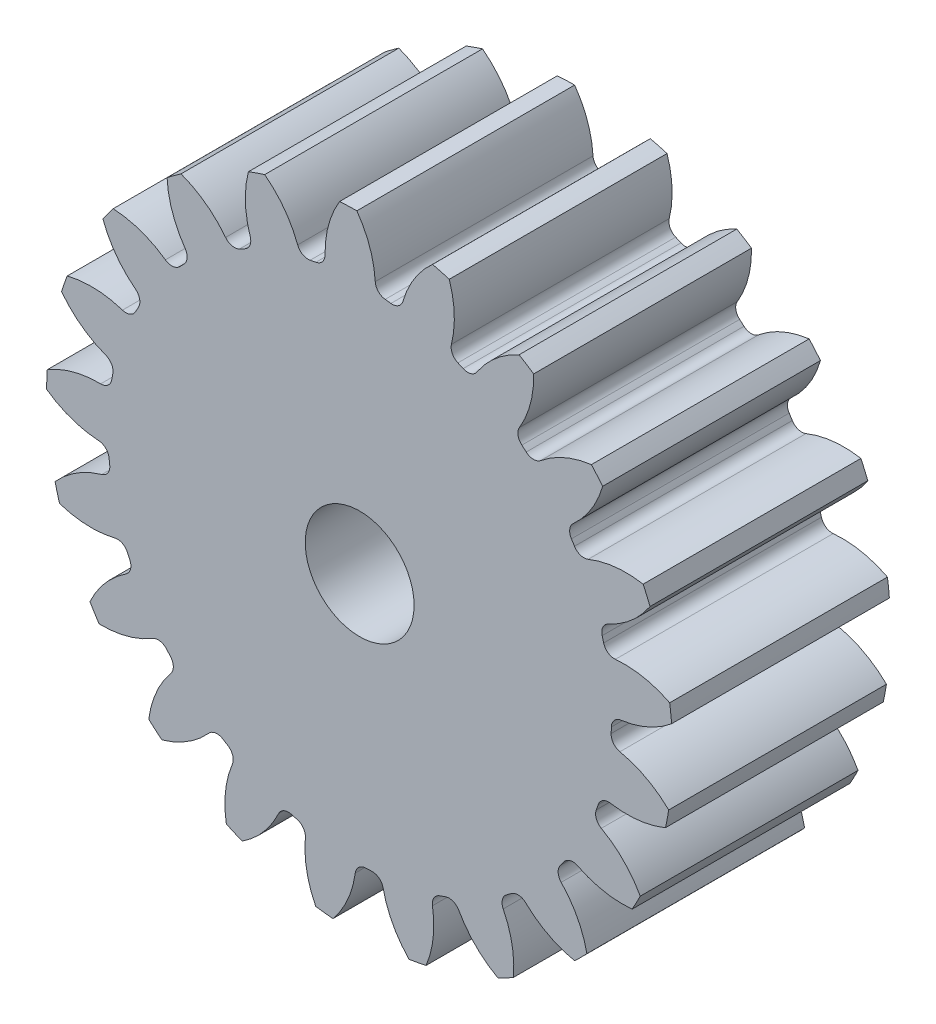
ISO-10303-21;
HEADER;
FILE_DESCRIPTION(('STEP AP214'),'2;1');
FILE_NAME('part.step','',(''),(''),'','','');
FILE_SCHEMA(('AUTOMOTIVE_DESIGN { 1 0 10303 214 1 1 1 1 }'));
ENDSEC;
DATA;
#1=APPLICATION_CONTEXT('core data for automotive mechanical design processes');
#2=APPLICATION_PROTOCOL_DEFINITION('international standard','automotive_design',2000,#1);
#3=PRODUCT_CONTEXT('',#1,'mechanical');
#4=PRODUCT('Part','Part','',(#3));
#5=PRODUCT_RELATED_PRODUCT_CATEGORY('part','',(#4));
#6=PRODUCT_DEFINITION_FORMATION('','',#4);
#7=PRODUCT_DEFINITION_CONTEXT('part definition',#1,'design');
#8=PRODUCT_DEFINITION('design','',#6,#7);
#9=PRODUCT_DEFINITION_SHAPE('','',#8);
#10=(LENGTH_UNIT() NAMED_UNIT(*) SI_UNIT(.MILLI.,.METRE.));
#11=(NAMED_UNIT(*) PLANE_ANGLE_UNIT() SI_UNIT($,.RADIAN.));
#12=(NAMED_UNIT(*) SI_UNIT($,.STERADIAN.) SOLID_ANGLE_UNIT());
#13=UNCERTAINTY_MEASURE_WITH_UNIT(LENGTH_MEASURE(1.E-05),#10,'distance_accuracy_value','');
#14=(GEOMETRIC_REPRESENTATION_CONTEXT(3) GLOBAL_UNCERTAINTY_ASSIGNED_CONTEXT((#13)) GLOBAL_UNIT_ASSIGNED_CONTEXT((#10,
#11,#12)) REPRESENTATION_CONTEXT('',''));
#15=CARTESIAN_POINT('',(0.,0.,0.));
#16=DIRECTION('',(0.,0.,1.));
#17=DIRECTION('',(1.,0.,0.));
#18=AXIS2_PLACEMENT_3D('',#15,#16,#17);
#19=CARTESIAN_POINT('',(0.,0.,101.6));
#20=DIRECTION('',(0.,0.,-1.));
#21=DIRECTION('',(-1.,0.,0.));
#22=AXIS2_PLACEMENT_3D('',#19,#20,#21);
#23=CYLINDRICAL_SURFACE('',#22,146.05);
#24=DIRECTION('',(0.,0.,-1.));
#25=VECTOR('',#24,1.);
#26=CARTESIAN_POINT('',(144.641312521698,20.2359386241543,50.8));
#27=LINE('',#26,#25);
#28=CARTESIAN_POINT('',(144.641312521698,20.2359386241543,101.6));
#29=VERTEX_POINT('',#28);
#30=CARTESIAN_POINT('',(144.641312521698,20.2359386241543,0.));
#31=VERTEX_POINT('',#30);
#32=EDGE_CURVE('E852',#29,#31,#27,.T.);
#33=ORIENTED_EDGE('',*,*,#32,.F.);
#34=CARTESIAN_POINT('',(0.,0.,101.6));
#35=DIRECTION('',(0.,0.,1.));
#36=DIRECTION('',(1.,0.,0.));
#37=AXIS2_PLACEMENT_3D('',#34,#35,#36);
#38=CIRCLE('',#37,146.05);
#39=CARTESIAN_POINT('',(145.539209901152,12.2041337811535,101.6));
#40=VERTEX_POINT('',#39);
#41=EDGE_CURVE('E1611',#40,#29,#38,.T.);
#42=ORIENTED_EDGE('',*,*,#41,.F.);
#43=DIRECTION('',(0.,0.,-1.));
#44=VECTOR('',#43,1.);
#45=CARTESIAN_POINT('',(145.539209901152,12.2041337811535,50.8));
#46=LINE('',#45,#44);
#47=CARTESIAN_POINT('',(145.539209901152,12.2041337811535,0.));
#48=VERTEX_POINT('',#47);
#49=EDGE_CURVE('E1605',#48,#40,#46,.F.);
#50=ORIENTED_EDGE('',*,*,#49,.F.);
#51=CARTESIAN_POINT('',(0.,0.,0.));
#52=DIRECTION('',(0.,0.,1.));
#53=DIRECTION('',(1.,0.,0.));
#54=AXIS2_PLACEMENT_3D('',#51,#52,#53);
#55=CIRCLE('',#54,146.05);
#56=EDGE_CURVE('E1616',#48,#31,#55,.T.);
#57=ORIENTED_EDGE('',*,*,#56,.T.);
#58=EDGE_LOOP('',(#33,#42,#50,#57));
#59=FACE_BOUND('',#58,.T.);
#60=ADVANCED_FACE('F33',(#59),#23,.T.);
#61=DIRECTION('',(0.,0.,-1.));
#62=VECTOR('',#61,1.);
#63=CARTESIAN_POINT('',(135.476079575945,54.5603735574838,50.8));
#64=LINE('',#63,#62);
#65=CARTESIAN_POINT('',(135.476079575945,54.5603735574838,0.));
#66=VERTEX_POINT('',#65);
#67=CARTESIAN_POINT('',(135.476079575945,54.5603735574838,101.6));
#68=VERTEX_POINT('',#67);
#69=EDGE_CURVE('E823',#66,#68,#64,.F.);
#70=ORIENTED_EDGE('',*,*,#69,.F.);
#71=CARTESIAN_POINT('',(132.250657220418,61.9706879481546,0.));
#72=VERTEX_POINT('',#71);
#73=EDGE_CURVE('E1619',#66,#72,#55,.T.);
#74=ORIENTED_EDGE('',*,*,#73,.T.);
#75=DIRECTION('',(0.,0.,-1.));
#76=VECTOR('',#75,1.);
#77=CARTESIAN_POINT('',(132.250657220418,61.9706879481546,50.8));
#78=LINE('',#77,#76);
#79=CARTESIAN_POINT('',(132.250657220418,61.9706879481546,101.6));
#80=VERTEX_POINT('',#79);
#81=EDGE_CURVE('E885',#80,#72,#78,.T.);
#82=ORIENTED_EDGE('',*,*,#81,.F.);
#83=EDGE_CURVE('E1614',#68,#80,#38,.T.);
#84=ORIENTED_EDGE('',*,*,#83,.F.);
#85=EDGE_LOOP('',(#70,#74,#82,#84));
#86=FACE_BOUND('',#85,.T.);
#87=ADVANCED_FACE('F1856',(#86),#23,.T.);
#88=CARTESIAN_POINT('',(0.,0.,101.6));
#89=DIRECTION('',(0.,0.,1.));
#90=DIRECTION('',(1.,0.,0.));
#91=AXIS2_PLACEMENT_3D('',#88,#89,#90);
#92=PLANE('',#91);
#93=CARTESIAN_POINT('',(0.,0.,101.599999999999));
#94=DIRECTION('',(0.,0.,1.));
#95=DIRECTION('',(1.,0.,0.));
#96=AXIS2_PLACEMENT_3D('',#93,#94,#95);
#97=CIRCLE('',#96,25.4);
#98=CARTESIAN_POINT('',(25.4,0.,101.599999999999));
#99=VERTEX_POINT('',#98);
#100=EDGE_CURVE('E840',#99,#99,#97,.T.);
#101=ORIENTED_EDGE('',*,*,#100,.F.);
#102=EDGE_LOOP('',(#101));
#103=FACE_BOUND('',#102,.T.);
#104=ORIENTED_EDGE('',*,*,#41,.T.);
#105=CARTESIAN_POINT('',(123.500858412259,-21.2046124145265,101.6));
#106=DIRECTION('',(0.,0.,-1.));
#107=DIRECTION('',(0.955572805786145,0.294755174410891,0.));
#108=AXIS2_PLACEMENT_3D('',#105,#106,#107);
#109=CIRCLE('',#108,46.5213721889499);
#110=CARTESIAN_POINT('',(119.313473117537,25.1279233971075,101.6));
#111=VERTEX_POINT('',#110);
#112=EDGE_CURVE('E832',#111,#29,#109,.T.);
#113=ORIENTED_EDGE('',*,*,#112,.F.);
#114=CARTESIAN_POINT('',(118.848220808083,30.2758421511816,101.6));
#115=DIRECTION('',(0.,0.,1.));
#116=DIRECTION('',(-0.955572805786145,-0.294755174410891,0.));
#117=AXIS2_PLACEMENT_3D('',#114,#115,#116);
#118=CIRCLE('',#117,5.1689);
#119=CARTESIAN_POINT('',(113.839291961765,28.9998488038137,101.6));
#120=VERTEX_POINT('',#119);
#121=EDGE_CURVE('E830',#120,#111,#118,.T.);
#122=ORIENTED_EDGE('',*,*,#121,.F.);
#123=CARTESIAN_POINT('',(0.,0.,101.6));
#124=DIRECTION('',(0.,0.,-1.));
#125=DIRECTION('',(0.955572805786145,0.294755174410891,0.));
#126=AXIS2_PLACEMENT_3D('',#123,#124,#125);
#127=CIRCLE('',#126,117.475);
#128=CARTESIAN_POINT('',(113.142766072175,31.6083867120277,101.6));
#129=VERTEX_POINT('',#128);
#130=EDGE_CURVE('E815',#129,#120,#127,.T.);
#131=ORIENTED_EDGE('',*,*,#130,.F.);
#132=CARTESIAN_POINT('',(118.121047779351,32.9991557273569,101.6));
#133=DIRECTION('',(0.,0.,1.));
#134=DIRECTION('',(-0.955572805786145,-0.294755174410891,0.));
#135=AXIS2_PLACEMENT_3D('',#132,#133,#134);
#136=CIRCLE('',#135,5.16890000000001);
#137=CARTESIAN_POINT('',(115.95816715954,37.6937776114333,101.6));
#138=VERTEX_POINT('',#137);
#139=EDGE_CURVE('E807',#138,#129,#136,.T.);
#140=ORIENTED_EDGE('',*,*,#139,.F.);
#141=CARTESIAN_POINT('',(96.4917092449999,79.9465300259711,101.6));
#142=DIRECTION('',(0.,0.,-1.));
#143=DIRECTION('',(-0.955572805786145,-0.294755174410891,0.));
#144=AXIS2_PLACEMENT_3D('',#141,#142,#143);
#145=CIRCLE('',#144,46.52137218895);
#146=EDGE_CURVE('E837',#68,#138,#145,.T.);
#147=ORIENTED_EDGE('',*,*,#146,.F.);
#148=ORIENTED_EDGE('',*,*,#83,.T.);
#149=CARTESIAN_POINT('',(124.264231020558,16.1399660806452,101.6));
#150=DIRECTION('',(0.,0.,-1.));
#151=DIRECTION('',(0.826238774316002,0.563320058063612,0.));
#152=AXIS2_PLACEMENT_3D('',#149,#150,#151);
#153=CIRCLE('',#152,46.5213721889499);
#154=CARTESIAN_POINT('',(106.606124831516,59.1798238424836,101.6));
#155=VERTEX_POINT('',#154);
#156=EDGE_CURVE('E861',#155,#80,#153,.T.);
#157=ORIENTED_EDGE('',*,*,#156,.F.);
#158=CARTESIAN_POINT('',(104.644166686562,63.961899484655,101.6));
#159=DIRECTION('',(0.,0.,1.));
#160=DIRECTION('',(-0.826238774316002,-0.563320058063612,0.));
#161=AXIS2_PLACEMENT_3D('',#158,#159,#160);
#162=CIRCLE('',#161,5.1689);
#163=CARTESIAN_POINT('',(100.233876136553,61.2661872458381,101.6));
#164=VERTEX_POINT('',#163);
#165=EDGE_CURVE('E859',#164,#155,#162,.T.);
#166=ORIENTED_EDGE('',*,*,#165,.F.);
#167=CARTESIAN_POINT('',(0.,0.,101.6));
#168=DIRECTION('',(0.,0.,-1.));
#169=DIRECTION('',(0.826238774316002,0.563320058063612,0.));
#170=AXIS2_PLACEMENT_3D('',#167,#168,#169);
#171=CIRCLE('',#170,117.475);
#172=CARTESIAN_POINT('',(98.7994148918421,63.5535305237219,101.6));
#173=VERTEX_POINT('',#172);
#174=EDGE_CURVE('E856',#173,#164,#171,.T.);
#175=ORIENTED_EDGE('',*,*,#174,.F.);
#176=CARTESIAN_POINT('',(103.146589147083,66.3498858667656,101.6));
#177=DIRECTION('',(0.,0.,1.));
#178=DIRECTION('',(-0.826238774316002,-0.563320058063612,0.));
#179=AXIS2_PLACEMENT_3D('',#176,#177,#178);
#180=CIRCLE('',#179,5.16890000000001);
#181=CARTESIAN_POINT('',(99.6960351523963,70.1984186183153,101.6));
#182=VERTEX_POINT('',#181);
#183=EDGE_CURVE('E854',#182,#173,#180,.T.);
#184=ORIENTED_EDGE('',*,*,#183,.F.);
#185=CARTESIAN_POINT('',(68.6401999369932,104.836160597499,101.6));
#186=DIRECTION('',(0.,0.,-1.));
#187=DIRECTION('',(-0.826238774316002,-0.563320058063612,0.));
#188=AXIS2_PLACEMENT_3D('',#185,#186,#187);
#189=CIRCLE('',#188,46.52137218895);
#190=CARTESIAN_POINT('',(113.375305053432,92.0686847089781,101.6));
#191=VERTEX_POINT('',#190);
#192=EDGE_CURVE('E864',#191,#182,#189,.T.);
#193=ORIENTED_EDGE('',*,*,#192,.F.);
#194=CARTESIAN_POINT('',(108.108950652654,98.1990696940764,101.6));
#195=VERTEX_POINT('',#194);
#196=EDGE_CURVE('E1669',#191,#195,#38,.T.);
#197=ORIENTED_EDGE('',*,*,#196,.T.);
#198=CARTESIAN_POINT('',(113.986181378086,52.0504377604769,101.6));
#199=DIRECTION('',(0.,0.,-1.));
#200=DIRECTION('',(0.623489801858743,0.781831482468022,0.));
#201=AXIS2_PLACEMENT_3D('',#198,#199,#200);
#202=CIRCLE('',#201,46.5213721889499);
#203=CARTESIAN_POINT('',(84.426354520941,87.9733372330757,101.6));
#204=VERTEX_POINT('',#203);
#205=EDGE_CURVE('E896',#204,#195,#202,.T.);
#206=ORIENTED_EDGE('',*,*,#205,.F.);
#207=CARTESIAN_POINT('',(81.142019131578,91.9646613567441,101.6));
#208=DIRECTION('',(0.,0.,1.));
#209=DIRECTION('',(-0.623489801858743,-0.781831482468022,0.));
#210=AXIS2_PLACEMENT_3D('',#207,#208,#209);
#211=CIRCLE('',#210,5.1689);
#212=CARTESIAN_POINT('',(77.7222405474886,88.0887560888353,101.6));
#213=VERTEX_POINT('',#212);
#214=EDGE_CURVE('E894',#213,#204,#211,.T.);
#215=ORIENTED_EDGE('',*,*,#214,.F.);
#216=CARTESIAN_POINT('',(0.,0.,101.6));
#217=DIRECTION('',(0.,0.,-1.));
#218=DIRECTION('',(0.623489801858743,0.781831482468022,0.));
#219=AXIS2_PLACEMENT_3D('',#216,#217,#218);
#220=CIRCLE('',#219,117.475);
#221=CARTESIAN_POINT('',(75.6773021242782,89.8516642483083,101.6));
#222=VERTEX_POINT('',#221);
#223=EDGE_CURVE('E891',#222,#213,#220,.T.);
#224=ORIENTED_EDGE('',*,*,#223,.F.);
#225=CARTESIAN_POINT('',(79.0071034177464,93.8051374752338,101.6));
#226=DIRECTION('',(0.,0.,1.));
#227=DIRECTION('',(-0.623489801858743,-0.781831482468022,0.));
#228=AXIS2_PLACEMENT_3D('',#225,#226,#227);
#229=CIRCLE('',#228,5.16890000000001);
#230=CARTESIAN_POINT('',(74.5754729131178,96.4656220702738,101.6));
#231=VERTEX_POINT('',#230);
#232=EDGE_CURVE('E889',#231,#222,#229,.T.);
#233=ORIENTED_EDGE('',*,*,#232,.F.);
#234=CARTESIAN_POINT('',(34.6897076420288,120.410638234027,101.6));
#235=DIRECTION('',(0.,0.,-1.));
#236=DIRECTION('',(-0.623489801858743,-0.781831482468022,0.));
#237=AXIS2_PLACEMENT_3D('',#234,#235,#236);
#238=CIRCLE('',#237,46.52137218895);
#239=CARTESIAN_POINT('',(81.2006371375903,121.396289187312,101.6));
#240=VERTEX_POINT('',#239);
#241=EDGE_CURVE('E899',#240,#231,#238,.T.);
#242=ORIENTED_EDGE('',*,*,#241,.F.);
#243=CARTESIAN_POINT('',(74.3612893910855,125.70203315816,101.6));
#244=VERTEX_POINT('',#243);
#245=EDGE_CURVE('E1838',#240,#244,#38,.T.);
#246=ORIENTED_EDGE('',*,*,#245,.T.);
#247=CARTESIAN_POINT('',(93.5799593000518,83.3359996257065,101.6));
#248=DIRECTION('',(0.,0.,-1.));
#249=DIRECTION('',(0.365341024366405,0.9308737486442,0.));
#250=AXIS2_PLACEMENT_3D('',#247,#248,#249);
#251=CIRCLE('',#250,46.5213721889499);
#252=CARTESIAN_POINT('',(54.7449321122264,108.950033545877,101.6));
#253=VERTEX_POINT('',#252);
#254=EDGE_CURVE('E934',#253,#244,#251,.T.);
#255=ORIENTED_EDGE('',*,*,#254,.F.);
#256=CARTESIAN_POINT('',(50.4300470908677,111.795959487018,101.6));
#257=DIRECTION('',(0.,0.,1.));
#258=DIRECTION('',(-0.365341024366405,-0.9308737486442,0.));
#259=AXIS2_PLACEMENT_3D('',#256,#257,#258);
#260=CIRCLE('',#259,5.1689);
#261=CARTESIAN_POINT('',(48.3046428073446,107.084252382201,101.6));
#262=VERTEX_POINT('',#261);
#263=EDGE_CURVE('E932',#262,#253,#260,.T.);
#264=ORIENTED_EDGE('',*,*,#263,.F.);
#265=CARTESIAN_POINT('',(0.,0.,101.6));
#266=DIRECTION('',(0.,0.,-1.));
#267=DIRECTION('',(0.365341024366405,0.9308737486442,0.));
#268=AXIS2_PLACEMENT_3D('',#265,#266,#267);
#269=CIRCLE('',#268,117.475);
#270=CARTESIAN_POINT('',(45.8309289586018,108.166083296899,101.6));
#271=VERTEX_POINT('',#270);
#272=EDGE_CURVE('E929',#271,#262,#269,.T.);
#273=ORIENTED_EDGE('',*,*,#272,.F.);
#274=CARTESIAN_POINT('',(47.8474898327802,112.925390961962,101.6));
#275=DIRECTION('',(0.,0.,1.));
#276=DIRECTION('',(-0.365341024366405,-0.9308737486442,0.));
#277=AXIS2_PLACEMENT_3D('',#274,#275,#276);
#278=CIRCLE('',#277,5.16890000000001);
#279=CARTESIAN_POINT('',(42.8285526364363,114.161431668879,101.6));
#280=VERTEX_POINT('',#279);
#281=EDGE_CURVE('E927',#280,#271,#278,.T.);
#282=ORIENTED_EDGE('',*,*,#281,.F.);
#283=CARTESIAN_POINT('',(-2.34311741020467,125.286102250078,101.6));
#284=DIRECTION('',(0.,0.,-1.));
#285=DIRECTION('',(-0.365341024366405,-0.9308737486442,0.));
#286=AXIS2_PLACEMENT_3D('',#283,#284,#285);
#287=CIRCLE('',#286,46.52137218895);
#288=CARTESIAN_POINT('',(41.8109362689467,139.937300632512,101.6));
#289=VERTEX_POINT('',#288);
#290=EDGE_CURVE('E937',#289,#280,#287,.T.);
#291=ORIENTED_EDGE('',*,*,#290,.F.);
#292=CARTESIAN_POINT('',(34.006301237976,142.035819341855,101.6));
#293=VERTEX_POINT('',#292);
#294=EDGE_CURVE('E1834',#289,#293,#38,.T.);
#295=ORIENTED_EDGE('',*,*,#294,.T.);
#296=CARTESIAN_POINT('',(64.8587471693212,107.216792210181,101.6));
#297=DIRECTION('',(0.,0.,-1.));
#298=DIRECTION('',(0.074730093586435,0.997203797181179,0.));
#299=AXIS2_PLACEMENT_3D('',#296,#297,#298);
#300=CIRCLE('',#299,46.5213721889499);
#301=CARTESIAN_POINT('',(20.199182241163,120.246041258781,101.6));
#302=VERTEX_POINT('',#301);
#303=EDGE_CURVE('E972',#302,#293,#300,.T.);
#304=ORIENTED_EDGE('',*,*,#303,.F.);
#305=CARTESIAN_POINT('',(15.2371440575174,121.693696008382,101.6));
#306=DIRECTION('',(0.,0.,1.));
#307=DIRECTION('',(-0.074730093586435,-0.997203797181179,0.));
#308=AXIS2_PLACEMENT_3D('',#305,#306,#307);
#309=CIRCLE('',#308,5.1689);
#310=CARTESIAN_POINT('',(14.5949655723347,116.564842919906,101.6));
#311=VERTEX_POINT('',#310);
#312=EDGE_CURVE('E970',#311,#302,#309,.T.);
#313=ORIENTED_EDGE('',*,*,#312,.F.);
#314=CARTESIAN_POINT('',(0.,0.,101.6));
#315=DIRECTION('',(0.,0.,-1.));
#316=DIRECTION('',(0.074730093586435,0.997203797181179,0.));
#317=AXIS2_PLACEMENT_3D('',#314,#315,#316);
#318=CIRCLE('',#317,117.475);
#319=CARTESIAN_POINT('',(11.9122766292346,116.869471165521,101.6));
#320=VERTEX_POINT('',#319);
#321=EDGE_CURVE('E967',#320,#311,#318,.T.);
#322=ORIENTED_EDGE('',*,*,#321,.F.);
#323=CARTESIAN_POINT('',(12.4364168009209,122.011727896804,101.6));
#324=DIRECTION('',(0.,0.,1.));
#325=DIRECTION('',(-0.074730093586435,-0.997203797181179,0.));
#326=AXIS2_PLACEMENT_3D('',#323,#324,#325);
#327=CIRCLE('',#326,5.16890000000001);
#328=CARTESIAN_POINT('',(7.2761275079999,121.713497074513,101.6));
#329=VERTEX_POINT('',#328);
#330=EDGE_CURVE('E965',#329,#320,#327,.T.);
#331=ORIENTED_EDGE('',*,*,#330,.F.);
#332=CARTESIAN_POINT('',(-39.1677461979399,119.029346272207,101.6));
#333=DIRECTION('',(0.,0.,-1.));
#334=DIRECTION('',(-0.074730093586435,-0.997203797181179,0.));
#335=AXIS2_PLACEMENT_3D('',#332,#333,#334);
#336=CIRCLE('',#335,46.52137218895);
#337=CARTESIAN_POINT('',(-1.2938497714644,146.044268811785,101.6));
#338=VERTEX_POINT('',#337);
#339=EDGE_CURVE('E975',#338,#329,#336,.T.);
#340=ORIENTED_EDGE('',*,*,#339,.F.);
#341=CARTESIAN_POINT('',(-9.37029601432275,145.749099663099,101.6));
#342=VERTEX_POINT('',#341);
#343=EDGE_CURVE('E1830',#338,#342,#38,.T.);
#344=ORIENTED_EDGE('',*,*,#343,.T.);
#345=CARTESIAN_POINT('',(30.3745507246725,121.570902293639,101.6));
#346=DIRECTION('',(0.,0.,-1.));
#347=DIRECTION('',(-0.222520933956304,0.974927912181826,0.));
#348=AXIS2_PLACEMENT_3D('',#345,#346,#347);
#349=CIRCLE('',#348,46.5213721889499);
#350=CARTESIAN_POINT('',(-16.141353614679,120.857660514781,101.6));
#351=VERTEX_POINT('',#350);
#352=EDGE_CURVE('E1010',#351,#342,#349,.T.);
#353=ORIENTED_EDGE('',*,*,#352,.F.);
#354=CARTESIAN_POINT('',(-21.3096460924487,120.778413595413,101.6));
#355=DIRECTION('',(0.,0.,1.));
#356=DIRECTION('',(0.222520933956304,-0.974927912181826,0.));
#357=AXIS2_PLACEMENT_3D('',#354,#355,#356);
#358=CIRCLE('',#357,5.1689);
#359=CARTESIAN_POINT('',(-20.4115384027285,115.68813562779,101.6));
#360=VERTEX_POINT('',#359);
#361=EDGE_CURVE('E1008',#360,#351,#358,.T.);
#362=ORIENTED_EDGE('',*,*,#361,.F.);
#363=CARTESIAN_POINT('',(0.,0.,101.6));
#364=DIRECTION('',(0.,0.,-1.));
#365=DIRECTION('',(-0.222520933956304,0.974927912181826,0.));
#366=AXIS2_PLACEMENT_3D('',#363,#364,#365);
#367=CIRCLE('',#366,117.475);
#368=CARTESIAN_POINT('',(-23.064833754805,115.188493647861,101.6));
#369=VERTEX_POINT('',#368);
#370=EDGE_CURVE('E1005',#369,#360,#367,.T.);
#371=ORIENTED_EDGE('',*,*,#370,.F.);
#372=CARTESIAN_POINT('',(-24.0796864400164,120.256787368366,101.6));
#373=DIRECTION('',(0.,0.,1.));
#374=DIRECTION('',(0.222520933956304,-0.974927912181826,0.));
#375=AXIS2_PLACEMENT_3D('',#372,#373,#374);
#376=CIRCLE('',#375,5.16890000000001);
#377=CARTESIAN_POINT('',(-28.9228134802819,118.450784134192,101.6));
#378=VERTEX_POINT('',#377);
#379=EDGE_CURVE('E1003',#378,#369,#376,.T.);
#380=ORIENTED_EDGE('',*,*,#379,.F.);
#381=CARTESIAN_POINT('',(-72.5121488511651,102.196310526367,101.6));
#382=DIRECTION('',(0.,0.,-1.));
#383=DIRECTION('',(0.222520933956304,-0.974927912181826,0.));
#384=AXIS2_PLACEMENT_3D('',#381,#382,#383);
#385=CIRCLE('',#384,46.52137218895);
#386=CARTESIAN_POINT('',(-44.2836715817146,139.174562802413,101.6));
#387=VERTEX_POINT('',#386);
#388=EDGE_CURVE('E1013',#387,#378,#385,.T.);
#389=ORIENTED_EDGE('',*,*,#388,.F.);
#390=CARTESIAN_POINT('',(-51.9143013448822,136.511932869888,101.6));
#391=VERTEX_POINT('',#390);
#392=EDGE_CURVE('E1826',#387,#391,#38,.T.);
#393=ORIENTED_EDGE('',*,*,#392,.T.);
#394=CARTESIAN_POINT('',(-6.80855784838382,125.122904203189,101.6));
#395=DIRECTION('',(0.,0.,-1.));
#396=DIRECTION('',(-0.499999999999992,0.866025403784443,0.));
#397=AXIS2_PLACEMENT_3D('',#394,#395,#396);
#398=CIRCLE('',#397,46.5213721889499);
#399=CARTESIAN_POINT('',(-51.0476593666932,110.730546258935,101.6));
#400=VERTEX_POINT('',#399);
#401=EDGE_CURVE('E1048',#400,#391,#398,.T.);
#402=ORIENTED_EDGE('',*,*,#401,.F.);
#403=CARTESIAN_POINT('',(-55.9629806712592,109.131439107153,101.6));
#404=DIRECTION('',(0.,0.,1.));
#405=DIRECTION('',(0.499999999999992,-0.866025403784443,0.));
#406=AXIS2_PLACEMENT_3D('',#403,#404,#405);
#407=CIRCLE('',#406,5.1689);
#408=CARTESIAN_POINT('',(-53.6043876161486,104.532029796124,101.6));
#409=VERTEX_POINT('',#408);
#410=EDGE_CURVE('E1046',#409,#400,#407,.T.);
#411=ORIENTED_EDGE('',*,*,#410,.F.);
#412=CARTESIAN_POINT('',(0.,0.,101.6));
#413=DIRECTION('',(0.,0.,-1.));
#414=DIRECTION('',(-0.499999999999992,0.866025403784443,0.));
#415=AXIS2_PLACEMENT_3D('',#412,#413,#414);
#416=CIRCLE('',#415,117.475);
#417=CARTESIAN_POINT('',(-55.9925324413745,103.272512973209,101.6));
#418=VERTEX_POINT('',#417);
#419=EDGE_CURVE('E1043',#418,#409,#416,.T.);
#420=ORIENTED_EDGE('',*,*,#419,.F.);
#421=CARTESIAN_POINT('',(-58.456203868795,107.81650354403,101.6));
#422=DIRECTION('',(0.,0.,1.));
#423=DIRECTION('',(0.499999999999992,-0.866025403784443,0.));
#424=AXIS2_PLACEMENT_3D('',#421,#422,#423);
#425=CIRCLE('',#424,5.16890000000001);
#426=CARTESIAN_POINT('',(-62.5518355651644,104.663199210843,101.6));
#427=VERTEX_POINT('',#426);
#428=EDGE_CURVE('E1041',#427,#418,#425,.T.);
#429=ORIENTED_EDGE('',*,*,#428,.F.);
#430=CARTESIAN_POINT('',(-99.4135288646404,76.2826841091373,101.6));
#431=DIRECTION('',(0.,0.,-1.));
#432=DIRECTION('',(0.499999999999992,-0.866025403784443,0.));
#433=AXIS2_PLACEMENT_3D('',#430,#431,#432);
#434=CIRCLE('',#433,46.52137218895);
#435=CARTESIAN_POINT('',(-83.3386948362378,119.938586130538,101.6));
#436=VERTEX_POINT('',#435);
#437=EDGE_CURVE('E1051',#436,#427,#434,.T.);
#438=ORIENTED_EDGE('',*,*,#437,.F.);
#439=CARTESIAN_POINT('',(-89.8454931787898,115.145081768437,101.6));
#440=VERTEX_POINT('',#439);
#441=EDGE_CURVE('E1822',#436,#440,#38,.T.);
#442=ORIENTED_EDGE('',*,*,#441,.T.);
#443=CARTESIAN_POINT('',(-43.3866961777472,117.557186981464,101.6));
#444=DIRECTION('',(0.,0.,-1.));
#445=DIRECTION('',(-0.73305187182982,0.680172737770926,0.));
#446=AXIS2_PLACEMENT_3D('',#443,#444,#445);
#447=CIRCLE('',#446,46.5213721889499);
#448=CARTESIAN_POINT('',(-81.4181565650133,90.7645370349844,101.6));
#449=VERTEX_POINT('',#448);
#450=EDGE_CURVE('E1086',#449,#440,#447,.T.);
#451=ORIENTED_EDGE('',*,*,#450,.F.);
#452=CARTESIAN_POINT('',(-85.6437588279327,87.7876573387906,101.6));
#453=DIRECTION('',(0.,0.,1.));
#454=DIRECTION('',(0.73305187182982,-0.680172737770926,0.));
#455=AXIS2_PLACEMENT_3D('',#452,#453,#454);
#456=CIRCLE('',#455,5.1689);
#457=CARTESIAN_POINT('',(-82.0342517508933,84.0877943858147,101.6));
#458=VERTEX_POINT('',#457);
#459=EDGE_CURVE('E1084',#458,#449,#456,.T.);
#460=ORIENTED_EDGE('',*,*,#459,.F.);
#461=CARTESIAN_POINT('',(0.,0.,101.6));
#462=DIRECTION('',(0.,0.,-1.));
#463=DIRECTION('',(-0.73305187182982,0.680172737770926,0.));
#464=AXIS2_PLACEMENT_3D('',#461,#462,#463);
#465=CIRCLE('',#464,117.475);
#466=CARTESIAN_POINT('',(-83.9450489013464,82.1803163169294,101.6));
#467=VERTEX_POINT('',#466);
#468=EDGE_CURVE('E1081',#467,#458,#465,.T.);
#469=ORIENTED_EDGE('',*,*,#468,.F.);
#470=CARTESIAN_POINT('',(-87.6386310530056,85.7962502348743,101.6));
#471=DIRECTION('',(0.,0.,1.));
#472=DIRECTION('',(0.73305187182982,-0.680172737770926,0.));
#473=AXIS2_PLACEMENT_3D('',#470,#471,#472);
#474=CIRCLE('',#473,5.16890000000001);
#475=CARTESIAN_POINT('',(-90.6228525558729,81.5758297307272,101.6));
#476=VERTEX_POINT('',#475);
#477=EDGE_CURVE('E1079',#476,#467,#474,.T.);
#478=ORIENTED_EDGE('',*,*,#477,.F.);
#479=CARTESIAN_POINT('',(-117.481580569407,43.5910064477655,101.6));
#480=DIRECTION('',(0.,0.,-1.));
#481=DIRECTION('',(0.73305187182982,-0.680172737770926,0.));
#482=AXIS2_PLACEMENT_3D('',#479,#480,#481);
#483=CIRCLE('',#482,46.52137218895);
#484=CARTESIAN_POINT('',(-114.988709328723,90.0455397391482,101.6));
#485=VERTEX_POINT('',#484);
#486=EDGE_CURVE('E1089',#485,#476,#483,.T.);
#487=ORIENTED_EDGE('',*,*,#486,.F.);
#488=CARTESIAN_POINT('',(-119.793518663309,83.5470848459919,101.6));
#489=VERTEX_POINT('',#488);
#490=EDGE_CURVE('E1818',#485,#489,#38,.T.);
#491=ORIENTED_EDGE('',*,*,#490,.T.);
#492=CARTESIAN_POINT('',(-76.1097361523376,99.545997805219,101.6));
#493=DIRECTION('',(0.,0.,-1.));
#494=DIRECTION('',(-0.900968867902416,0.433883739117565,0.));
#495=AXIS2_PLACEMENT_3D('',#492,#493,#494);
#496=CIRCLE('',#495,46.5213721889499);
#497=CARTESIAN_POINT('',(-104.554293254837,62.7337003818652,101.6));
#498=VERTEX_POINT('',#497);
#499=EDGE_CURVE('E1124',#498,#489,#496,.T.);
#500=ORIENTED_EDGE('',*,*,#499,.F.);
#501=CARTESIAN_POINT('',(-107.714713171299,58.6435569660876,101.6));
#502=DIRECTION('',(0.,0.,1.));
#503=DIRECTION('',(0.900968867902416,-0.433883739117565,0.));
#504=AXIS2_PLACEMENT_3D('',#501,#502,#503);
#505=CIRCLE('',#504,5.1689);
#506=CARTESIAN_POINT('',(-103.175012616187,56.1719894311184,101.6));
#507=VERTEX_POINT('',#506);
#508=EDGE_CURVE('E1122',#507,#498,#505,.T.);
#509=ORIENTED_EDGE('',*,*,#508,.F.);
#510=CARTESIAN_POINT('',(0.,0.,101.6));
#511=DIRECTION('',(0.,0.,-1.));
#512=DIRECTION('',(-0.900968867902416,0.433883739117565,0.));
#513=AXIS2_PLACEMENT_3D('',#510,#511,#512);
#514=CIRCLE('',#513,117.475);
#515=CARTESIAN_POINT('',(-104.438679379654,53.7860379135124,101.6));
#516=VERTEX_POINT('',#515);
#517=EDGE_CURVE('E1119',#516,#507,#514,.T.);
#518=ORIENTED_EDGE('',*,*,#517,.F.);
#519=CARTESIAN_POINT('',(-109.033981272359,56.152623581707,101.6));
#520=DIRECTION('',(0.,0.,1.));
#521=DIRECTION('',(0.900968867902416,-0.433883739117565,0.));
#522=AXIS2_PLACEMENT_3D('',#519,#520,#521);
#523=CIRCLE('',#522,5.16890000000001);
#524=CARTESIAN_POINT('',(-110.641631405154,51.2400897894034,101.6));
#525=VERTEX_POINT('',#524);
#526=EDGE_CURVE('E1117',#525,#516,#523,.T.);
#527=ORIENTED_EDGE('',*,*,#526,.F.);
#528=CARTESIAN_POINT('',(-125.110878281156,7.02607656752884,101.6));
#529=DIRECTION('',(0.,0.,-1.));
#530=DIRECTION('',(0.900968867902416,-0.433883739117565,0.));
#531=AXIS2_PLACEMENT_3D('',#528,#529,#530);
#532=CIRCLE('',#531,46.52137218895);
#533=CARTESIAN_POINT('',(-136.421472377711,52.1515519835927,101.6));
#534=VERTEX_POINT('',#533);
#535=EDGE_CURVE('E1127',#534,#525,#532,.T.);
#536=ORIENTED_EDGE('',*,*,#535,.F.);
#537=CARTESIAN_POINT('',(-139.097364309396,44.5255627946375,101.6));
#538=VERTEX_POINT('',#537);
#539=EDGE_CURVE('E1814',#534,#538,#38,.T.);
#540=ORIENTED_EDGE('',*,*,#539,.T.);
#541=CARTESIAN_POINT('',(-102.070092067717,72.6897098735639,101.6));
#542=DIRECTION('',(0.,0.,-1.));
#543=DIRECTION('',(-0.988830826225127,0.149042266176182,0.));
#544=AXIS2_PLACEMENT_3D('',#541,#542,#543);
#545=CIRCLE('',#544,46.5213721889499);
#546=CARTESIAN_POINT('',(-118.40032216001,29.1286991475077,101.6));
#547=VERTEX_POINT('',#546);
#548=EDGE_CURVE('E1162',#547,#538,#545,.T.);
#549=ORIENTED_EDGE('',*,*,#548,.F.);
#550=CARTESIAN_POINT('',(-120.214742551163,24.2887192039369,101.6));
#551=DIRECTION('',(0.,0.,1.));
#552=DIRECTION('',(0.988830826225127,-0.149042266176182,0.));
#553=AXIS2_PLACEMENT_3D('',#550,#551,#552);
#554=CIRCLE('',#553,5.1689);
#555=CARTESIAN_POINT('',(-115.148220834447,23.2650567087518,101.6));
#556=VERTEX_POINT('',#555);
#557=EDGE_CURVE('E1160',#556,#547,#554,.T.);
#558=ORIENTED_EDGE('',*,*,#557,.F.);
#559=CARTESIAN_POINT('',(0.,0.,101.6));
#560=DIRECTION('',(0.,0.,-1.));
#561=DIRECTION('',(-0.988830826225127,0.149042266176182,0.));
#562=AXIS2_PLACEMENT_3D('',#559,#560,#561);
#563=CIRCLE('',#562,117.475);
#564=CARTESIAN_POINT('',(-115.652474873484,20.6126340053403,101.6));
#565=VERTEX_POINT('',#564);
#566=EDGE_CURVE('E1157',#565,#556,#563,.T.);
#567=ORIENTED_EDGE('',*,*,#566,.F.);
#568=CARTESIAN_POINT('',(-120.741183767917,21.5195899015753,101.6));
#569=DIRECTION('',(0.,0.,1.));
#570=DIRECTION('',(0.988830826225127,-0.149042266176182,0.));
#571=AXIS2_PLACEMENT_3D('',#568,#569,#570);
#572=CIRCLE('',#571,5.16890000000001);
#573=CARTESIAN_POINT('',(-120.829415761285,16.3514430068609,101.6));
#574=VERTEX_POINT('',#573);
#575=EDGE_CURVE('E1155',#574,#565,#572,.T.);
#576=ORIENTED_EDGE('',*,*,#575,.F.);
#577=CARTESIAN_POINT('',(-121.623525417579,-30.1631510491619,101.6));
#578=DIRECTION('',(0.,0.,-1.));
#579=DIRECTION('',(0.988830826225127,-0.149042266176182,0.));
#580=AXIS2_PLACEMENT_3D('',#577,#578,#579);
#581=CIRCLE('',#580,46.52137218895);
#582=CARTESIAN_POINT('',(-145.732588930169,9.62366997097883,101.6));
#583=VERTEX_POINT('',#582);
#584=EDGE_CURVE('E1165',#583,#574,#581,.T.);
#585=ORIENTED_EDGE('',*,*,#584,.F.);
#586=CARTESIAN_POINT('',(-146.041798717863,1.5477490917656,101.6));
#587=VERTEX_POINT('',#586);
#588=EDGE_CURVE('E1810',#583,#587,#38,.T.);
#589=ORIENTED_EDGE('',*,*,#588,.T.);
#590=CARTESIAN_POINT('',(-118.961072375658,39.374622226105,101.6));
#591=DIRECTION('',(0.,0.,-1.));
#592=DIRECTION('',(-0.98883082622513,-0.149042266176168,0.));
#593=AXIS2_PLACEMENT_3D('',#590,#591,#592);
#594=CIRCLE('',#593,46.5213721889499);
#595=CARTESIAN_POINT('',(-121.72596285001,-7.06451483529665,101.6));
#596=VERTEX_POINT('',#595);
#597=EDGE_CURVE('E1200',#596,#587,#594,.T.);
#598=ORIENTED_EDGE('',*,*,#597,.F.);
#599=CARTESIAN_POINT('',(-122.033164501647,-12.2242778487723,101.6));
#600=DIRECTION('',(0.,0.,1.));
#601=DIRECTION('',(0.98883082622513,0.149042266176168,0.));
#602=AXIS2_PLACEMENT_3D('',#599,#600,#601);
#603=CIRCLE('',#602,5.1689);
#604=CARTESIAN_POINT('',(-116.890004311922,-11.7090783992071,101.6));
#605=VERTEX_POINT('',#604);
#606=EDGE_CURVE('E1198',#605,#596,#603,.T.);
#607=ORIENTED_EDGE('',*,*,#606,.F.);
#608=CARTESIAN_POINT('',(0.,0.,101.6));
#609=DIRECTION('',(0.,0.,-1.));
#610=DIRECTION('',(-0.98883082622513,-0.149042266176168,0.));
#611=AXIS2_PLACEMENT_3D('',#608,#609,#610);
#612=CIRCLE('',#611,117.475);
#613=CARTESIAN_POINT('',(-116.590040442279,-14.3922928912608,101.6));
#614=VERTEX_POINT('',#613);
#615=EDGE_CURVE('E1195',#614,#605,#612,.T.);
#616=ORIENTED_EDGE('',*,*,#615,.F.);
#617=CARTESIAN_POINT('',(-121.720002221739,-15.0255537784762,101.6));
#618=DIRECTION('',(0.,0.,1.));
#619=DIRECTION('',(0.98883082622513,0.149042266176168,0.));
#620=AXIS2_PLACEMENT_3D('',#617,#618,#619);
#621=CIRCLE('',#620,5.16890000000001);
#622=CARTESIAN_POINT('',(-120.280976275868,-19.9901012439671,101.6));
#623=VERTEX_POINT('',#622);
#624=EDGE_CURVE('E1193',#623,#614,#621,.T.);
#625=ORIENTED_EDGE('',*,*,#624,.F.);
#626=CARTESIAN_POINT('',(-107.3293885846,-64.6722503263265,101.6));
#627=DIRECTION('',(0.,0.,-1.));
#628=DIRECTION('',(0.98883082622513,0.149042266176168,0.));
#629=AXIS2_PLACEMENT_3D('',#626,#627,#628);
#630=CIRCLE('',#629,46.52137218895);
#631=CARTESIAN_POINT('',(-142.094725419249,-33.7593173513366,101.6));
#632=VERTEX_POINT('',#631);
#633=EDGE_CURVE('E1203',#632,#623,#630,.T.);
#634=ORIENTED_EDGE('',*,*,#633,.F.);
#635=CARTESIAN_POINT('',(-140.009778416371,-41.5675889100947,101.6));
#636=VERTEX_POINT('',#635);
#637=EDGE_CURVE('E1806',#632,#636,#38,.T.);
#638=ORIENTED_EDGE('',*,*,#637,.T.);
#639=CARTESIAN_POINT('',(-125.281839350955,2.56092660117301,101.6));
#640=DIRECTION('',(0.,0.,-1.));
#641=DIRECTION('',(-0.900968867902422,-0.433883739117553,0.));
#642=AXIS2_PLACEMENT_3D('',#639,#640,#641);
#643=CIRCLE('',#642,46.5213721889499);
#644=CARTESIAN_POINT('',(-114.235717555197,-42.6300156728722,101.6));
#645=VERTEX_POINT('',#644);
#646=EDGE_CURVE('E1238',#645,#636,#643,.T.);
#647=ORIENTED_EDGE('',*,*,#646,.F.);
#648=CARTESIAN_POINT('',(-113.008404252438,-47.6510941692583,101.6));
#649=DIRECTION('',(0.,0.,1.));
#650=DIRECTION('',(0.900968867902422,0.433883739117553,0.));
#651=AXIS2_PLACEMENT_3D('',#648,#649,#650);
#652=CIRCLE('',#651,5.1689);
#653=CARTESIAN_POINT('',(-108.245597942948,-45.6428105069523,101.6));
#654=VERTEX_POINT('',#653);
#655=EDGE_CURVE('E1236',#654,#645,#652,.T.);
#656=ORIENTED_EDGE('',*,*,#655,.F.);
#657=CARTESIAN_POINT('',(0.,0.,101.6));
#658=DIRECTION('',(0.,0.,-1.));
#659=DIRECTION('',(-0.900968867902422,-0.433883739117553,0.));
#660=AXIS2_PLACEMENT_3D('',#657,#658,#659);
#661=CIRCLE('',#660,117.475);
#662=CARTESIAN_POINT('',(-107.168069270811,-48.1184014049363,101.6));
#663=VERTEX_POINT('',#662);
#664=EDGE_CURVE('E1233',#663,#654,#661,.T.);
#665=ORIENTED_EDGE('',*,*,#664,.F.);
#666=CARTESIAN_POINT('',(-111.883464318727,-50.2356110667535,101.6));
#667=DIRECTION('',(0.,0.,1.));
#668=DIRECTION('',(0.900968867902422,0.433883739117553,0.));
#669=AXIS2_PLACEMENT_3D('',#666,#667,#668);
#670=CIRCLE('',#669,5.16890000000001);
#671=CARTESIAN_POINT('',(-109.045044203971,-54.5554372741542,101.6));
#672=VERTEX_POINT('',#671);
#673=EDGE_CURVE('E1231',#672,#663,#670,.T.);
#674=ORIENTED_EDGE('',*,*,#673,.F.);
#675=CARTESIAN_POINT('',(-83.4985645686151,-93.434936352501,101.6));
#676=DIRECTION('',(0.,0.,-1.));
#677=DIRECTION('',(0.900968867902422,0.433883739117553,0.));
#678=AXIS2_PLACEMENT_3D('',#675,#676,#677);
#679=CIRCLE('',#678,46.52137218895);
#680=CARTESIAN_POINT('',(-125.831121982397,-74.1426411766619,101.6));
#681=VERTEX_POINT('',#680);
#682=EDGE_CURVE('E1241',#681,#672,#679,.T.);
#683=ORIENTED_EDGE('',*,*,#682,.F.);
#684=CARTESIAN_POINT('',(-121.537274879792,-80.9894642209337,101.6));
#685=VERTEX_POINT('',#684);
#686=EDGE_CURVE('E1802',#681,#685,#38,.T.);
#687=ORIENTED_EDGE('',*,*,#686,.T.);
#688=CARTESIAN_POINT('',(-120.470765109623,-34.4803185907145,101.6));
#689=DIRECTION('',(0.,0.,-1.));
#690=DIRECTION('',(-0.73305187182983,-0.680172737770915,0.));
#691=AXIS2_PLACEMENT_3D('',#688,#689,#690);
#692=CIRCLE('',#691,46.5213721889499);
#693=CARTESIAN_POINT('',(-96.5951274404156,-74.4076525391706,101.6));
#694=VERTEX_POINT('',#693);
#695=EDGE_CURVE('E1276',#694,#685,#692,.T.);
#696=ORIENTED_EDGE('',*,*,#695,.F.);
#697=CARTESIAN_POINT('',(-93.9423513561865,-78.8439016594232,101.6));
#698=DIRECTION('',(0.,0.,1.));
#699=DIRECTION('',(0.73305187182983,0.680172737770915,0.));
#700=AXIS2_PLACEMENT_3D('',#697,#698,#699);
#701=CIRCLE('',#700,5.1689);
#702=CARTESIAN_POINT('',(-89.9830951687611,-75.52097860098,101.6));
#703=VERTEX_POINT('',#702);
#704=EDGE_CURVE('E1274',#703,#694,#701,.T.);
#705=ORIENTED_EDGE('',*,*,#704,.F.);
#706=CARTESIAN_POINT('',(0.,0.,101.6));
#707=DIRECTION('',(0.,0.,-1.));
#708=DIRECTION('',(-0.73305187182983,-0.680172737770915,0.));
#709=AXIS2_PLACEMENT_3D('',#706,#707,#708);
#710=CIRCLE('',#709,117.475);
#711=CARTESIAN_POINT('',(-88.2237448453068,-77.5689787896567,101.6));
#712=VERTEX_POINT('',#711);
#713=EDGE_CURVE('E1271',#712,#703,#710,.T.);
#714=ORIENTED_EDGE('',*,*,#713,.F.);
#715=CARTESIAN_POINT('',(-92.1055896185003,-80.9820138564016,101.6));
#716=DIRECTION('',(0.,0.,1.));
#717=DIRECTION('',(0.73305187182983,0.680172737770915,0.));
#718=AXIS2_PLACEMENT_3D('',#715,#716,#717);
#719=CIRCLE('',#718,5.16890000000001);
#720=CARTESIAN_POINT('',(-88.1199814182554,-84.2732832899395,101.6));
#721=VERTEX_POINT('',#720);
#722=EDGE_CURVE('E1269',#721,#712,#719,.T.);
#723=ORIENTED_EDGE('',*,*,#722,.F.);
#724=CARTESIAN_POINT('',(-52.2485266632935,-113.895518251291,101.6));
#725=DIRECTION('',(0.,0.,-1.));
#726=DIRECTION('',(0.73305187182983,0.680172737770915,0.));
#727=AXIS2_PLACEMENT_3D('',#724,#725,#726);
#728=CIRCLE('',#727,46.52137218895);
#729=CARTESIAN_POINT('',(-98.3868711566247,-107.938065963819,101.6));
#730=VERTEX_POINT('',#729);
#731=EDGE_CURVE('E1279',#730,#721,#728,.T.);
#732=ORIENTED_EDGE('',*,*,#731,.F.);
#733=CARTESIAN_POINT('',(-92.2656511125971,-113.215070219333,101.6));
#734=VERTEX_POINT('',#733);
#735=EDGE_CURVE('E1798',#730,#734,#38,.T.);
#736=ORIENTED_EDGE('',*,*,#735,.T.);
#737=CARTESIAN_POINT('',(-104.955334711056,-68.4578361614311,101.6));
#738=DIRECTION('',(0.,0.,-1.));
#739=DIRECTION('',(-0.500000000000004,-0.866025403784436,0.));
#740=AXIS2_PLACEMENT_3D('',#737,#738,#739);
#741=CIRCLE('',#740,46.5213721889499);
#742=CARTESIAN_POINT('',(-70.3716363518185,-99.5738429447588,101.6));
#743=VERTEX_POINT('',#742);
#744=EDGE_CURVE('E1314',#743,#734,#741,.T.);
#745=ORIENTED_EDGE('',*,*,#744,.F.);
#746=CARTESIAN_POINT('',(-66.5291082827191,-103.031082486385,101.6));
#747=DIRECTION('',(0.,0.,1.));
#748=DIRECTION('',(0.500000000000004,0.866025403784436,0.));
#749=AXIS2_PLACEMENT_3D('',#746,#747,#748);
#750=CIRCLE('',#749,5.1689);
#751=CARTESIAN_POINT('',(-63.7251995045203,-98.6887763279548,101.6));
#752=VERTEX_POINT('',#751);
#753=EDGE_CURVE('E1312',#752,#743,#750,.T.);
#754=ORIENTED_EDGE('',*,*,#753,.F.);
#755=CARTESIAN_POINT('',(0.,0.,101.6));
#756=DIRECTION('',(0.,0.,-1.));
#757=DIRECTION('',(-0.500000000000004,-0.866025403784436,0.));
#758=AXIS2_PLACEMENT_3D('',#755,#756,#757);
#759=CIRCLE('',#758,117.475);
#760=CARTESIAN_POINT('',(-61.4403535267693,-100.127212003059,101.6));
#761=VERTEX_POINT('',#760);
#762=EDGE_CURVE('E1309',#761,#752,#759,.T.);
#763=ORIENTED_EDGE('',*,*,#762,.F.);
#764=CARTESIAN_POINT('',(-64.1437290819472,-104.532809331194,101.6));
#765=DIRECTION('',(0.,0.,1.));
#766=DIRECTION('',(0.500000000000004,0.866025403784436,0.));
#767=AXIS2_PLACEMENT_3D('',#764,#765,#766);
#768=CIRCLE('',#767,5.16890000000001);
#769=CARTESIAN_POINT('',(-59.3650715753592,-106.503078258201,101.6));
#770=VERTEX_POINT('',#769);
#771=EDGE_CURVE('E1307',#770,#761,#768,.T.);
#772=ORIENTED_EDGE('',*,*,#771,.F.);
#773=CARTESIAN_POINT('',(-16.3559778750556,-124.235983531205,101.6));
#774=DIRECTION('',(0.,0.,-1.));
#775=DIRECTION('',(0.500000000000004,0.866025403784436,0.));
#776=AXIS2_PLACEMENT_3D('',#773,#774,#775);
#777=CIRCLE('',#776,46.52137218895);
#778=CARTESIAN_POINT('',(-62.2005150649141,-132.14271991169,101.6));
#779=VERTEX_POINT('',#778);
#780=EDGE_CURVE('E1317',#779,#770,#777,.T.);
#781=ORIENTED_EDGE('',*,*,#780,.F.);
#782=CARTESIAN_POINT('',(-54.7958193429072,-135.381020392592,101.6));
#783=VERTEX_POINT('',#782);
#784=EDGE_CURVE('E1794',#779,#783,#38,.T.);
#785=ORIENTED_EDGE('',*,*,#784,.T.);
#786=CARTESIAN_POINT('',(-80.1141622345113,-96.3525745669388,101.6));
#787=DIRECTION('',(0.,0.,-1.));
#788=DIRECTION('',(-0.222520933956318,-0.974927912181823,0.));
#789=AXIS2_PLACEMENT_3D('',#786,#787,#788);
#790=CIRCLE('',#789,46.5213721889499);
#791=CARTESIAN_POINT('',(-37.8953165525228,-115.892460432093,101.6));
#792=VERTEX_POINT('',#791);
#793=EDGE_CURVE('E1352',#792,#783,#790,.T.);
#794=ORIENTED_EDGE('',*,*,#793,.F.);
#795=CARTESIAN_POINT('',(-33.2044619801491,-118.063499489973,101.6));
#796=DIRECTION('',(0.,0.,1.));
#797=DIRECTION('',(0.222520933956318,0.974927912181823,0.));
#798=AXIS2_PLACEMENT_3D('',#795,#796,#797);
#799=CIRCLE('',#798,5.1689);
#800=CARTESIAN_POINT('',(-31.8050402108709,-113.087643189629,101.6));
#801=VERTEX_POINT('',#800);
#802=EDGE_CURVE('E1350',#801,#792,#799,.T.);
#803=ORIENTED_EDGE('',*,*,#802,.F.);
#804=CARTESIAN_POINT('',(0.,0.,101.6));
#805=DIRECTION('',(0.,0.,-1.));
#806=DIRECTION('',(-0.222520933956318,-0.974927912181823,0.));
#807=AXIS2_PLACEMENT_3D('',#804,#805,#806);
#808=CIRCLE('',#807,117.475);
#809=CARTESIAN_POINT('',(-29.1977171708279,-113.788703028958,101.6));
#810=VERTEX_POINT('',#809);
#811=EDGE_CURVE('E1347',#810,#801,#808,.T.);
#812=ORIENTED_EDGE('',*,*,#811,.F.);
#813=CARTESIAN_POINT('',(-30.4824167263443,-118.795405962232,101.6));
#814=DIRECTION('',(0.,0.,1.));
#815=DIRECTION('',(0.222520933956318,0.974927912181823,0.));
#816=AXIS2_PLACEMENT_3D('',#813,#814,#815);
#817=CIRCLE('',#816,5.16890000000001);
#818=CARTESIAN_POINT('',(-25.3353146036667,-119.269607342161,101.6));
#819=VERTEX_POINT('',#818);
#820=EDGE_CURVE('E1345',#819,#810,#817,.T.);
#821=ORIENTED_EDGE('',*,*,#820,.F.);
#822=CARTESIAN_POINT('',(20.9898713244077,-123.537536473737,101.6));
#823=DIRECTION('',(0.,0.,-1.));
#824=DIRECTION('',(0.222520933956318,0.974927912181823,0.));
#825=AXIS2_PLACEMENT_3D('',#822,#823,#824);
#826=CIRCLE('',#825,46.52137218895);
#827=CARTESIAN_POINT('',(-20.4873702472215,-144.605913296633,101.6));
#828=VERTEX_POINT('',#827);
#829=EDGE_CURVE('E1355',#828,#819,#826,.T.);
#830=ORIENTED_EDGE('',*,*,#829,.F.);
#831=CARTESIAN_POINT('',(-12.4571385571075,-145.517772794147,101.6));
#832=VERTEX_POINT('',#831);
#833=EDGE_CURVE('E1790',#828,#832,#38,.T.);
#834=ORIENTED_EDGE('',*,*,#833,.T.);
#835=CARTESIAN_POINT('',(-48.1544948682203,-115.685963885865,101.6));
#836=DIRECTION('',(0.,0.,-1.));
#837=DIRECTION('',(0.0747300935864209,-0.997203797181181,0.));
#838=AXIS2_PLACEMENT_3D('',#835,#836,#837);
#839=CIRCLE('',#838,46.5213721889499);
#840=CARTESIAN_POINT('',(-2.05183157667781,-121.913524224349,101.6));
#841=VERTEX_POINT('',#840);
#842=EDGE_CURVE('E1390',#841,#832,#839,.T.);
#843=ORIENTED_EDGE('',*,*,#842,.F.);
#844=CARTESIAN_POINT('',(3.07054648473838,-122.605456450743,101.6));
#845=DIRECTION('',(0.,0.,1.));
#846=DIRECTION('',(-0.0747300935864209,0.997203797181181,0.));
#847=AXIS2_PLACEMENT_3D('',#844,#845,#846);
#848=CIRCLE('',#847,5.1689);
#849=CARTESIAN_POINT('',(2.94113647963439,-117.438176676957,101.6));
#850=VERTEX_POINT('',#849);
#851=EDGE_CURVE('E1388',#850,#841,#848,.T.);
#852=ORIENTED_EDGE('',*,*,#851,.F.);
#853=CARTESIAN_POINT('',(0.,0.,101.6));
#854=DIRECTION('',(0.,0.,-1.));
#855=DIRECTION('',(0.0747300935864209,-0.997203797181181,0.));
#856=AXIS2_PLACEMENT_3D('',#853,#854,#855);
#857=CIRCLE('',#856,117.475);
#858=CARTESIAN_POINT('',(5.63926448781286,-117.339568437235,101.6));
#859=VERTEX_POINT('',#858);
#860=EDGE_CURVE('E1385',#859,#850,#857,.T.);
#861=ORIENTED_EDGE('',*,*,#860,.F.);
#862=CARTESIAN_POINT('',(5.88739212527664,-122.502509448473,101.6));
#863=DIRECTION('',(0.,0.,1.));
#864=DIRECTION('',(-0.0747300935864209,0.997203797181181,0.));
#865=AXIS2_PLACEMENT_3D('',#862,#863,#864);
#866=CIRCLE('',#865,5.16890000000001);
#867=CARTESIAN_POINT('',(10.9455962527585,-121.438508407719,101.6));
#868=VERTEX_POINT('',#867);
#869=EDGE_CURVE('E1383',#868,#859,#866,.T.);
#870=ORIENTED_EDGE('',*,*,#869,.F.);
#871=CARTESIAN_POINT('',(56.4706783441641,-111.862237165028,101.6));
#872=DIRECTION('',(0.,0.,-1.));
#873=DIRECTION('',(-0.0747300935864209,0.997203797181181,0.));
#874=AXIS2_PLACEMENT_3D('',#871,#872,#873);
#875=CIRCLE('',#874,46.52137218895);
#876=CARTESIAN_POINT('',(23.0461673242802,-144.220236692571,101.6));
#877=VERTEX_POINT('',#876);
#878=EDGE_CURVE('E1393',#877,#868,#875,.T.);
#879=ORIENTED_EDGE('',*,*,#878,.F.);
#880=CARTESIAN_POINT('',(30.9884136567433,-142.724632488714,101.6));
#881=VERTEX_POINT('',#880);
#882=EDGE_CURVE('E1786',#877,#881,#38,.T.);
#883=ORIENTED_EDGE('',*,*,#882,.T.);
#884=CARTESIAN_POINT('',(-11.9160893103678,-124.740147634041,101.6));
#885=DIRECTION('',(0.,0.,-1.));
#886=DIRECTION('',(0.365341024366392,-0.930873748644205,0.));
#887=AXIS2_PLACEMENT_3D('',#884,#885,#886);
#888=CIRCLE('',#887,46.5213721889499);
#889=CARTESIAN_POINT('',(33.9739676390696,-117.102036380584,101.6));
#890=VERTEX_POINT('',#889);
#891=EDGE_CURVE('E1428',#890,#881,#888,.T.);
#892=ORIENTED_EDGE('',*,*,#891,.F.);
#893=CARTESIAN_POINT('',(39.0727234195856,-116.253380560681,101.6));
#894=DIRECTION('',(0.,0.,1.));
#895=DIRECTION('',(-0.365341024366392,0.930873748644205,0.));
#896=AXIS2_PLACEMENT_3D('',#893,#894,#895);
#897=CIRCLE('',#896,5.1689);
#898=CARTESIAN_POINT('',(37.4259802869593,-111.353812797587,101.6));
#899=VERTEX_POINT('',#898);
#900=EDGE_CURVE('E1426',#899,#890,#897,.T.);
#901=ORIENTED_EDGE('',*,*,#900,.F.);
#902=CARTESIAN_POINT('',(0.,0.,101.6));
#903=DIRECTION('',(0.,0.,-1.));
#904=DIRECTION('',(0.365341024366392,-0.930873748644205,0.));
#905=AXIS2_PLACEMENT_3D('',#902,#903,#904);
#906=CIRCLE('',#905,117.475);
#907=CARTESIAN_POINT('',(39.9751727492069,-110.464298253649,101.6));
#908=VERTEX_POINT('',#907);
#909=EDGE_CURVE('E1423',#908,#899,#906,.T.);
#910=ORIENTED_EDGE('',*,*,#909,.F.);
#911=CARTESIAN_POINT('',(41.734080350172,-115.324727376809,101.6));
#912=DIRECTION('',(0.,0.,1.));
#913=DIRECTION('',(-0.365341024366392,0.930873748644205,0.));
#914=AXIS2_PLACEMENT_3D('',#911,#912,#913);
#915=CIRCLE('',#914,5.16890000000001);
#916=CARTESIAN_POINT('',(46.2539428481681,-112.817065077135,101.6));
#917=VERTEX_POINT('',#916);
#918=EDGE_CURVE('E1421',#917,#908,#915,.T.);
#919=ORIENTED_EDGE('',*,*,#918,.F.);
#920=CARTESIAN_POINT('',(86.9338177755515,-90.2474871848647,101.6));
#921=DIRECTION('',(0.,0.,-1.));
#922=DIRECTION('',(-0.365341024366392,0.930873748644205,0.));
#923=AXIS2_PLACEMENT_3D('',#920,#921,#922);
#924=CIRCLE('',#923,46.52137218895);
#925=CARTESIAN_POINT('',(64.5319517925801,-131.01995915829,101.6));
#926=VERTEX_POINT('',#925);
#927=EDGE_CURVE('E1431',#926,#917,#924,.T.);
#928=ORIENTED_EDGE('',*,*,#927,.F.);
#929=CARTESIAN_POINT('',(71.680509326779,-127.249782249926,101.6));
#930=VERTEX_POINT('',#929);
#931=EDGE_CURVE('E1782',#926,#930,#38,.T.);
#932=ORIENTED_EDGE('',*,*,#931,.T.);
#933=CARTESIAN_POINT('',(25.3811130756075,-122.710621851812,101.6));
#934=DIRECTION('',(0.,0.,-1.));
#935=DIRECTION('',(0.623489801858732,-0.781831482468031,0.));
#936=AXIS2_PLACEMENT_3D('',#933,#934,#935);
#937=CIRCLE('',#936,46.5213721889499);
#938=CARTESIAN_POINT('',(66.9810307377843,-101.885518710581,101.6));
#939=VERTEX_POINT('',#938);
#940=EDGE_CURVE('E1466',#939,#930,#937,.T.);
#941=ORIENTED_EDGE('',*,*,#940,.F.);
#942=CARTESIAN_POINT('',(71.6031174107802,-99.5716816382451,101.6));
#943=DIRECTION('',(0.,0.,1.));
#944=DIRECTION('',(-0.623489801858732,0.781831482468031,0.));
#945=AXIS2_PLACEMENT_3D('',#942,#943,#944);
#946=CIRCLE('',#945,5.1689);
#947=CARTESIAN_POINT('',(68.5853615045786,-95.3751739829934,101.6));
#948=VERTEX_POINT('',#947);
#949=EDGE_CURVE('E1464',#948,#939,#946,.T.);
#950=ORIENTED_EDGE('',*,*,#949,.F.);
#951=CARTESIAN_POINT('',(0.,0.,101.6));
#952=DIRECTION('',(0.,0.,-1.));
#953=DIRECTION('',(0.623489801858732,-0.781831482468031,0.));
#954=AXIS2_PLACEMENT_3D('',#951,#952,#953);
#955=CIRCLE('',#954,117.475);
#956=CARTESIAN_POINT('',(70.7591114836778,-93.7737904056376,101.6));
#957=VERTEX_POINT('',#956);
#958=EDGE_CURVE('E1461',#957,#948,#955,.T.);
#959=ORIENTED_EDGE('',*,*,#958,.F.);
#960=CARTESIAN_POINT('',(73.8725123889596,-97.8998371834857,101.6));
#961=DIRECTION('',(0.,0.,1.));
#962=DIRECTION('',(-0.623489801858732,0.781831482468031,0.));
#963=AXIS2_PLACEMENT_3D('',#960,#961,#962);
#964=CIRCLE('',#963,5.16890000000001);
#965=CARTESIAN_POINT('',(77.4524236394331,-94.1713304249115,101.6));
#966=VERTEX_POINT('',#965);
#967=EDGE_CURVE('E1459',#966,#957,#964,.T.);
#968=ORIENTED_EDGE('',*,*,#967,.F.);
#969=CARTESIAN_POINT('',(109.672505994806,-60.6138519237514,101.6));
#970=DIRECTION('',(0.,0.,-1.));
#971=DIRECTION('',(-0.623489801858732,0.781831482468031,0.));
#972=AXIS2_PLACEMENT_3D('',#969,#970,#971);
#973=CIRCLE('',#972,46.52137218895);
#974=CARTESIAN_POINT('',(100.283789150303,-106.177983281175,101.6));
#975=VERTEX_POINT('',#974);
#976=EDGE_CURVE('E1469',#975,#966,#973,.T.);
#977=ORIENTED_EDGE('',*,*,#976,.F.);
#978=CARTESIAN_POINT('',(106.003477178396,-100.46823043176,101.6));
#979=VERTEX_POINT('',#978);
#980=EDGE_CURVE('E1778',#975,#979,#38,.T.);
#981=ORIENTED_EDGE('',*,*,#980,.T.);
#982=CARTESIAN_POINT('',(60.4230921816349,-109.777718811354,101.6));
#983=DIRECTION('',(0.,0.,-1.));
#984=DIRECTION('',(0.826238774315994,-0.563320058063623,0.));
#985=AXIS2_PLACEMENT_3D('',#982,#983,#984);
#986=CIRCLE('',#985,46.5213721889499);
#987=CARTESIAN_POINT('',(94.0365353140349,-77.616025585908,101.6));
#988=VERTEX_POINT('',#987);
#989=EDGE_CURVE('E1504',#988,#979,#986,.T.);
#990=ORIENTED_EDGE('',*,*,#989,.F.);
#991=CARTESIAN_POINT('',(97.7712601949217,-74.0426018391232,101.6));
#992=DIRECTION('',(0.,0.,1.));
#993=DIRECTION('',(-0.826238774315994,0.563320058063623,0.));
#994=AXIS2_PLACEMENT_3D('',#991,#992,#993);
#995=CIRCLE('',#994,5.1689);
#996=CARTESIAN_POINT('',(93.6506323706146,-70.9220324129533,101.6));
#997=VERTEX_POINT('',#996);
#998=EDGE_CURVE('E1502',#997,#988,#995,.T.);
#999=ORIENTED_EDGE('',*,*,#998,.F.);
#1000=CARTESIAN_POINT('',(0.,0.,101.6));
#1001=DIRECTION('',(0.,0.,-1.));
#1002=DIRECTION('',(0.826238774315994,-0.563320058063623,0.));
#1003=AXIS2_PLACEMENT_3D('',#1000,#1001,#1002);
#1004=CIRCLE('',#1003,117.475);
#1005=CARTESIAN_POINT('',(95.2557926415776,-68.7510697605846,101.6));
#1006=VERTEX_POINT('',#1005);
#1007=EDGE_CURVE('E1499',#1006,#997,#1004,.T.);
#1008=ORIENTED_EDGE('',*,*,#1007,.F.);
#1009=CARTESIAN_POINT('',(99.4470475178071,-71.7761168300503,101.6));
#1010=DIRECTION('',(0.,0.,1.));
#1011=DIRECTION('',(-0.826238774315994,0.563320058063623,0.));
#1012=AXIS2_PLACEMENT_3D('',#1009,#1010,#1011);
#1013=CIRCLE('',#1012,5.16890000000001);
#1014=CARTESIAN_POINT('',(101.768916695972,-67.158059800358,101.6));
#1015=VERTEX_POINT('',#1014);
#1016=EDGE_CURVE('E1497',#1015,#1006,#1013,.T.);
#1017=ORIENTED_EDGE('',*,*,#1016,.F.);
#1018=CARTESIAN_POINT('',(122.666310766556,-25.5944099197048,101.6));
#1019=DIRECTION('',(0.,0.,-1.));
#1020=DIRECTION('',(-0.826238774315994,0.563320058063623,0.));
#1021=AXIS2_PLACEMENT_3D('',#1018,#1019,#1020);
#1022=CIRCLE('',#1021,46.52137218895);
#1023=CARTESIAN_POINT('',(127.124971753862,-71.9016276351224,101.6));
#1024=VERTEX_POINT('',#1023);
#1025=EDGE_CURVE('E1507',#1024,#1015,#1022,.T.);
#1026=ORIENTED_EDGE('',*,*,#1025,.F.);
#1027=CARTESIAN_POINT('',(130.907570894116,-64.7596354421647,101.6));
#1028=VERTEX_POINT('',#1027);
#1029=EDGE_CURVE('E1777',#1024,#1028,#38,.T.);
#1030=ORIENTED_EDGE('',*,*,#1029,.T.);
#1031=CARTESIAN_POINT('',(90.0962143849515,-87.0905837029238,101.6));
#1032=DIRECTION('',(0.,0.,-1.));
#1033=DIRECTION('',(0.955572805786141,-0.294755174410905,0.));
#1034=AXIS2_PLACEMENT_3D('',#1031,#1032,#1033);
#1035=CIRCLE('',#1034,46.5213721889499);
#1036=CARTESIAN_POINT('',(112.736481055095,-46.4500079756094,101.6));
#1037=VERTEX_POINT('',#1036);
#1038=EDGE_CURVE('E1542',#1037,#1028,#1035,.T.);
#1039=ORIENTED_EDGE('',*,*,#1038,.F.);
#1040=CARTESIAN_POINT('',(115.251997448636,-41.9345119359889,101.6));
#1041=DIRECTION('',(0.,0.,1.));
#1042=DIRECTION('',(-0.955572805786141,0.294755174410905,0.));
#1043=AXIS2_PLACEMENT_3D('',#1040,#1041,#1042);
#1044=CIRCLE('',#1043,5.1689);
#1045=CARTESIAN_POINT('',(110.39463357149,-40.1671570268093,101.6));
#1046=VERTEX_POINT('',#1045);
#1047=EDGE_CURVE('E1540',#1046,#1037,#1044,.T.);
#1048=ORIENTED_EDGE('',*,*,#1047,.F.);
#1049=CARTESIAN_POINT('',(0.,0.,101.6));
#1050=DIRECTION('',(0.,0.,-1.));
#1051=DIRECTION('',(0.955572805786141,-0.294755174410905,0.));
#1052=AXIS2_PLACEMENT_3D('',#1049,#1050,#1051);
#1053=CIRCLE('',#1052,117.475);
#1054=CARTESIAN_POINT('',(111.288578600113,-37.6195148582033,101.6));
#1055=VERTEX_POINT('',#1054);
#1056=EDGE_CURVE('E1537',#1055,#1046,#1053,.T.);
#1057=ORIENTED_EDGE('',*,*,#1056,.F.);
#1058=CARTESIAN_POINT('',(116.185276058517,-39.2747735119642,101.6));
#1059=DIRECTION('',(0.,0.,1.));
#1060=DIRECTION('',(-0.955572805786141,0.294755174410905,0.));
#1061=AXIS2_PLACEMENT_3D('',#1058,#1059,#1060);
#1062=CIRCLE('',#1061,5.16890000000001);
#1063=CARTESIAN_POINT('',(117.042794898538,-34.1775008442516,101.6));
#1064=VERTEX_POINT('',#1063);
#1065=EDGE_CURVE('E1535',#1064,#1055,#1062,.T.);
#1066=ORIENTED_EDGE('',*,*,#1065,.F.);
#1067=CARTESIAN_POINT('',(124.760675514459,11.6992077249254,101.6));
#1068=DIRECTION('',(0.,0.,-1.));
#1069=DIRECTION('',(-0.955572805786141,0.294755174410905,0.));
#1070=AXIS2_PLACEMENT_3D('',#1067,#1068,#1069);
#1071=CIRCLE('',#1070,46.52137218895);
#1072=CARTESIAN_POINT('',(142.67054273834,-31.2364968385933,101.6));
#1073=VERTEX_POINT('',#1072);
#1074=EDGE_CURVE('E1545',#1073,#1064,#1071,.T.);
#1075=ORIENTED_EDGE('',*,*,#1074,.F.);
#1076=CARTESIAN_POINT('',(144.17995245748,-23.2968626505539,101.6));
#1077=VERTEX_POINT('',#1076);
#1078=EDGE_CURVE('E1615',#1073,#1077,#38,.T.);
#1079=ORIENTED_EDGE('',*,*,#1078,.T.);
#1080=CARTESIAN_POINT('',(111.76389255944,-56.665068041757,101.6));
#1081=DIRECTION('',(0.,0.,-1.));
#1082=DIRECTION('',(1.,0.,0.));
#1083=AXIS2_PLACEMENT_3D('',#1080,#1081,#1082);
#1084=CIRCLE('',#1083,46.5213721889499);
#1085=CARTESIAN_POINT('',(121.419295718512,-11.1567033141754,101.6));
#1086=VERTEX_POINT('',#1085);
#1087=EDGE_CURVE('E1580',#1086,#1077,#1084,.T.);
#1088=ORIENTED_EDGE('',*,*,#1087,.F.);
#1089=CARTESIAN_POINT('',(122.492088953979,-6.10035662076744,101.6));
#1090=DIRECTION('',(0.,0.,1.));
#1091=DIRECTION('',(-1.,0.,0.));
#1092=AXIS2_PLACEMENT_3D('',#1089,#1090,#1091);
#1093=CIRCLE('',#1092,5.1689);
#1094=CARTESIAN_POINT('',(117.329587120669,-5.84325346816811,101.6));
#1095=VERTEX_POINT('',#1094);
#1096=EDGE_CURVE('E1578',#1095,#1086,#1093,.T.);
#1097=ORIENTED_EDGE('',*,*,#1096,.F.);
#1098=CARTESIAN_POINT('',(0.,0.,101.6));
#1099=DIRECTION('',(0.,0.,-1.));
#1100=DIRECTION('',(1.,0.,0.));
#1101=AXIS2_PLACEMENT_3D('',#1098,#1099,#1100);
#1102=CIRCLE('',#1101,117.475);
#1103=CARTESIAN_POINT('',(117.432885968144,-3.14530097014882,101.6));
#1104=VERTEX_POINT('',#1103);
#1105=EDGE_CURVE('E1575',#1104,#1095,#1102,.T.);
#1106=ORIENTED_EDGE('',*,*,#1105,.F.);
#1107=CARTESIAN_POINT('',(122.599932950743,-3.28369421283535,101.6));
#1108=DIRECTION('',(0.,0.,1.));
#1109=DIRECTION('',(-1.,0.,0.));
#1110=AXIS2_PLACEMENT_3D('',#1107,#1108,#1109);
#1111=CIRCLE('',#1110,5.16890000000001);
#1112=CARTESIAN_POINT('',(121.916907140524,1.83987904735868,101.6));
#1113=VERTEX_POINT('',#1112);
#1114=EDGE_CURVE('E1573',#1113,#1104,#1111,.T.);
#1115=ORIENTED_EDGE('',*,*,#1114,.F.);
#1116=CARTESIAN_POINT('',(115.769506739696,47.9532994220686,101.6));
#1117=DIRECTION('',(0.,0.,-1.));
#1118=DIRECTION('',(-1.,0.,0.));
#1119=AXIS2_PLACEMENT_3D('',#1116,#1117,#1118);
#1120=CIRCLE('',#1119,46.52137218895);
#1121=EDGE_CURVE('E1583',#40,#1113,#1120,.T.);
#1122=ORIENTED_EDGE('',*,*,#1121,.F.);
#1123=EDGE_LOOP('',(#104,#113,#122,#131,#140,#147,#148,#157,#166,#175,#184,#193,#197,#206,#215,
#224,#233,#242,#246,#255,#264,#273,#282,#291,#295,#304,#313,#322,#331,#340,#344,#353,#362,#371,
#380,#389,#393,#402,#411,#420,#429,#438,#442,#451,#460,#469,#478,#487,#491,#500,#509,#518,#527,
#536,#540,#549,#558,#567,#576,#585,#589,#598,#607,#616,#625,#634,#638,#647,#656,#665,#674,#683,
#687,#696,#705,#714,#723,#732,#736,#745,#754,#763,#772,#781,#785,#794,#803,#812,#821,#830,#834,
#843,#852,#861,#870,#879,#883,#892,#901,#910,#919,#928,#932,#941,#950,#959,#968,#977,#981,#990,
#999,#1008,#1017,#1026,#1030,#1039,#1048,#1057,#1066,#1075,#1079,#1088,#1097,#1106,#1115,#1122));
#1124=FACE_BOUND('',#1123,.T.);
#1125=ADVANCED_FACE('F828',(#103,#1124),#92,.T.);
#1126=CARTESIAN_POINT('',(0.,0.,0.));
#1127=DIRECTION('',(0.,0.,1.));
#1128=DIRECTION('',(1.,0.,0.));
#1129=AXIS2_PLACEMENT_3D('',#1126,#1127,#1128);
#1130=PLANE('',#1129);
#1131=CARTESIAN_POINT('',(0.,0.,0.));
#1132=DIRECTION('',(0.,0.,1.));
#1133=DIRECTION('',(1.,0.,0.));
#1134=AXIS2_PLACEMENT_3D('',#1131,#1132,#1133);
#1135=CIRCLE('',#1134,25.4);
#1136=CARTESIAN_POINT('',(25.4,0.,-1.77635683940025E-12));
#1137=VERTEX_POINT('',#1136);
#1138=EDGE_CURVE('E36',#1137,#1137,#1135,.T.);
#1139=ORIENTED_EDGE('',*,*,#1138,.T.);
#1140=EDGE_LOOP('',(#1139));
#1141=FACE_BOUND('',#1140,.T.);
#1142=CARTESIAN_POINT('',(123.500858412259,-21.2046124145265,0.));
#1143=DIRECTION('',(0.,0.,-1.));
#1144=DIRECTION('',(0.955572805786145,0.294755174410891,0.));
#1145=AXIS2_PLACEMENT_3D('',#1142,#1143,#1144);
#1146=CIRCLE('',#1145,46.5213721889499);
#1147=CARTESIAN_POINT('',(119.313473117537,25.1279233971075,0.));
#1148=VERTEX_POINT('',#1147);
#1149=EDGE_CURVE('E816',#1148,#31,#1146,.T.);
#1150=ORIENTED_EDGE('',*,*,#1149,.T.);
#1151=ORIENTED_EDGE('',*,*,#56,.F.);
#1152=CARTESIAN_POINT('',(115.769506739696,47.9532994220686,0.));
#1153=DIRECTION('',(0.,0.,1.));
#1154=DIRECTION('',(1.,0.,0.));
#1155=AXIS2_PLACEMENT_3D('',#1152,#1153,#1154);
#1156=CIRCLE('',#1155,46.52137218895);
#1157=CARTESIAN_POINT('',(121.916907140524,1.83987904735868,0.));
#1158=VERTEX_POINT('',#1157);
#1159=EDGE_CURVE('E1613',#1158,#48,#1156,.T.);
#1160=ORIENTED_EDGE('',*,*,#1159,.F.);
#1161=CARTESIAN_POINT('',(122.599932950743,-3.28369421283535,0.));
#1162=DIRECTION('',(0.,0.,1.));
#1163=DIRECTION('',(-1.,0.,0.));
#1164=AXIS2_PLACEMENT_3D('',#1161,#1162,#1163);
#1165=CIRCLE('',#1164,5.16890000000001);
#1166=CARTESIAN_POINT('',(117.432885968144,-3.14530097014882,0.));
#1167=VERTEX_POINT('',#1166);
#1168=EDGE_CURVE('E1572',#1158,#1167,#1165,.T.);
#1169=ORIENTED_EDGE('',*,*,#1168,.T.);
#1170=CARTESIAN_POINT('',(0.,0.,0.));
#1171=DIRECTION('',(0.,0.,-1.));
#1172=DIRECTION('',(1.,0.,0.));
#1173=AXIS2_PLACEMENT_3D('',#1170,#1171,#1172);
#1174=CIRCLE('',#1173,117.475);
#1175=CARTESIAN_POINT('',(117.329587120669,-5.84325346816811,0.));
#1176=VERTEX_POINT('',#1175);
#1177=EDGE_CURVE('E1588',#1167,#1176,#1174,.T.);
#1178=ORIENTED_EDGE('',*,*,#1177,.T.);
#1179=CARTESIAN_POINT('',(122.492088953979,-6.10035662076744,0.));
#1180=DIRECTION('',(0.,0.,1.));
#1181=DIRECTION('',(-1.,0.,0.));
#1182=AXIS2_PLACEMENT_3D('',#1179,#1180,#1181);
#1183=CIRCLE('',#1182,5.1689);
#1184=CARTESIAN_POINT('',(121.419295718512,-11.1567033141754,0.));
#1185=VERTEX_POINT('',#1184);
#1186=EDGE_CURVE('E1591',#1176,#1185,#1183,.T.);
#1187=ORIENTED_EDGE('',*,*,#1186,.T.);
#1188=CARTESIAN_POINT('',(111.76389255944,-56.665068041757,0.));
#1189=DIRECTION('',(0.,0.,-1.));
#1190=DIRECTION('',(1.,0.,0.));
#1191=AXIS2_PLACEMENT_3D('',#1188,#1189,#1190);
#1192=CIRCLE('',#1191,46.5213721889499);
#1193=CARTESIAN_POINT('',(144.17995245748,-23.2968626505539,0.));
#1194=VERTEX_POINT('',#1193);
#1195=EDGE_CURVE('E1576',#1185,#1194,#1192,.T.);
#1196=ORIENTED_EDGE('',*,*,#1195,.T.);
#1197=CARTESIAN_POINT('',(142.67054273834,-31.2364968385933,0.));
#1198=VERTEX_POINT('',#1197);
#1199=EDGE_CURVE('E1610',#1198,#1194,#55,.T.);
#1200=ORIENTED_EDGE('',*,*,#1199,.F.);
#1201=CARTESIAN_POINT('',(124.760675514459,11.6992077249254,0.));
#1202=DIRECTION('',(0.,0.,1.));
#1203=DIRECTION('',(1.,0.,0.));
#1204=AXIS2_PLACEMENT_3D('',#1201,#1202,#1203);
#1205=CIRCLE('',#1204,46.52137218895);
#1206=CARTESIAN_POINT('',(117.042794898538,-34.1775008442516,0.));
#1207=VERTEX_POINT('',#1206);
#1208=EDGE_CURVE('E1621',#1207,#1198,#1205,.T.);
#1209=ORIENTED_EDGE('',*,*,#1208,.F.);
#1210=CARTESIAN_POINT('',(116.185276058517,-39.2747735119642,0.));
#1211=DIRECTION('',(0.,0.,1.));
#1212=DIRECTION('',(-0.955572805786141,0.294755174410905,0.));
#1213=AXIS2_PLACEMENT_3D('',#1210,#1211,#1212);
#1214=CIRCLE('',#1213,5.16890000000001);
#1215=CARTESIAN_POINT('',(111.288578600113,-37.6195148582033,0.));
#1216=VERTEX_POINT('',#1215);
#1217=EDGE_CURVE('E1534',#1207,#1216,#1214,.T.);
#1218=ORIENTED_EDGE('',*,*,#1217,.T.);
#1219=CARTESIAN_POINT('',(0.,0.,0.));
#1220=DIRECTION('',(0.,0.,-1.));
#1221=DIRECTION('',(0.955572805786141,-0.294755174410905,0.));
#1222=AXIS2_PLACEMENT_3D('',#1219,#1220,#1221);
#1223=CIRCLE('',#1222,117.475);
#1224=CARTESIAN_POINT('',(110.39463357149,-40.1671570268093,0.));
#1225=VERTEX_POINT('',#1224);
#1226=EDGE_CURVE('E1550',#1216,#1225,#1223,.T.);
#1227=ORIENTED_EDGE('',*,*,#1226,.T.);
#1228=CARTESIAN_POINT('',(115.251997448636,-41.9345119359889,0.));
#1229=DIRECTION('',(0.,0.,1.));
#1230=DIRECTION('',(-0.955572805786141,0.294755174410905,0.));
#1231=AXIS2_PLACEMENT_3D('',#1228,#1229,#1230);
#1232=CIRCLE('',#1231,5.1689);
#1233=CARTESIAN_POINT('',(112.736481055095,-46.4500079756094,0.));
#1234=VERTEX_POINT('',#1233);
#1235=EDGE_CURVE('E1553',#1225,#1234,#1232,.T.);
#1236=ORIENTED_EDGE('',*,*,#1235,.T.);
#1237=CARTESIAN_POINT('',(90.0962143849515,-87.0905837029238,0.));
#1238=DIRECTION('',(0.,0.,-1.));
#1239=DIRECTION('',(0.955572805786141,-0.294755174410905,0.));
#1240=AXIS2_PLACEMENT_3D('',#1237,#1238,#1239);
#1241=CIRCLE('',#1240,46.5213721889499);
#1242=CARTESIAN_POINT('',(130.907570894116,-64.7596354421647,0.));
#1243=VERTEX_POINT('',#1242);
#1244=EDGE_CURVE('E1538',#1234,#1243,#1241,.T.);
#1245=ORIENTED_EDGE('',*,*,#1244,.T.);
#1246=CARTESIAN_POINT('',(127.124971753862,-71.9016276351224,0.));
#1247=VERTEX_POINT('',#1246);
#1248=EDGE_CURVE('E1748',#1247,#1243,#55,.T.);
#1249=ORIENTED_EDGE('',*,*,#1248,.F.);
#1250=CARTESIAN_POINT('',(122.666310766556,-25.5944099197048,0.));
#1251=DIRECTION('',(0.,0.,1.));
#1252=DIRECTION('',(1.,0.,0.));
#1253=AXIS2_PLACEMENT_3D('',#1250,#1251,#1252);
#1254=CIRCLE('',#1253,46.52137218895);
#1255=CARTESIAN_POINT('',(101.768916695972,-67.158059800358,0.));
#1256=VERTEX_POINT('',#1255);
#1257=EDGE_CURVE('E1623',#1256,#1247,#1254,.T.);
#1258=ORIENTED_EDGE('',*,*,#1257,.F.);
#1259=CARTESIAN_POINT('',(99.4470475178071,-71.7761168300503,0.));
#1260=DIRECTION('',(0.,0.,1.));
#1261=DIRECTION('',(-0.826238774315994,0.563320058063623,0.));
#1262=AXIS2_PLACEMENT_3D('',#1259,#1260,#1261);
#1263=CIRCLE('',#1262,5.16890000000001);
#1264=CARTESIAN_POINT('',(95.2557926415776,-68.7510697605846,0.));
#1265=VERTEX_POINT('',#1264);
#1266=EDGE_CURVE('E1496',#1256,#1265,#1263,.T.);
#1267=ORIENTED_EDGE('',*,*,#1266,.T.);
#1268=CARTESIAN_POINT('',(0.,0.,0.));
#1269=DIRECTION('',(0.,0.,-1.));
#1270=DIRECTION('',(0.826238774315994,-0.563320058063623,0.));
#1271=AXIS2_PLACEMENT_3D('',#1268,#1269,#1270);
#1272=CIRCLE('',#1271,117.475);
#1273=CARTESIAN_POINT('',(93.6506323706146,-70.9220324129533,0.));
#1274=VERTEX_POINT('',#1273);
#1275=EDGE_CURVE('E1512',#1265,#1274,#1272,.T.);
#1276=ORIENTED_EDGE('',*,*,#1275,.T.);
#1277=CARTESIAN_POINT('',(97.7712601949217,-74.0426018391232,0.));
#1278=DIRECTION('',(0.,0.,1.));
#1279=DIRECTION('',(-0.826238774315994,0.563320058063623,0.));
#1280=AXIS2_PLACEMENT_3D('',#1277,#1278,#1279);
#1281=CIRCLE('',#1280,5.1689);
#1282=CARTESIAN_POINT('',(94.0365353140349,-77.616025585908,0.));
#1283=VERTEX_POINT('',#1282);
#1284=EDGE_CURVE('E1515',#1274,#1283,#1281,.T.);
#1285=ORIENTED_EDGE('',*,*,#1284,.T.);
#1286=CARTESIAN_POINT('',(60.4230921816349,-109.777718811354,0.));
#1287=DIRECTION('',(0.,0.,-1.));
#1288=DIRECTION('',(0.826238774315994,-0.563320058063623,0.));
#1289=AXIS2_PLACEMENT_3D('',#1286,#1287,#1288);
#1290=CIRCLE('',#1289,46.5213721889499);
#1291=CARTESIAN_POINT('',(106.003477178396,-100.46823043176,0.));
#1292=VERTEX_POINT('',#1291);
#1293=EDGE_CURVE('E1500',#1283,#1292,#1290,.T.);
#1294=ORIENTED_EDGE('',*,*,#1293,.T.);
#1295=CARTESIAN_POINT('',(100.283789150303,-106.177983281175,0.));
#1296=VERTEX_POINT('',#1295);
#1297=EDGE_CURVE('E1743',#1296,#1292,#55,.T.);
#1298=ORIENTED_EDGE('',*,*,#1297,.F.);
#1299=CARTESIAN_POINT('',(109.672505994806,-60.6138519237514,0.));
#1300=DIRECTION('',(0.,0.,1.));
#1301=DIRECTION('',(1.,0.,0.));
#1302=AXIS2_PLACEMENT_3D('',#1299,#1300,#1301);
#1303=CIRCLE('',#1302,46.52137218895);
#1304=CARTESIAN_POINT('',(77.4524236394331,-94.1713304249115,0.));
#1305=VERTEX_POINT('',#1304);
#1306=EDGE_CURVE('E1625',#1305,#1296,#1303,.T.);
#1307=ORIENTED_EDGE('',*,*,#1306,.F.);
#1308=CARTESIAN_POINT('',(73.8725123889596,-97.8998371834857,0.));
#1309=DIRECTION('',(0.,0.,1.));
#1310=DIRECTION('',(-0.623489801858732,0.781831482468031,0.));
#1311=AXIS2_PLACEMENT_3D('',#1308,#1309,#1310);
#1312=CIRCLE('',#1311,5.16890000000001);
#1313=CARTESIAN_POINT('',(70.7591114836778,-93.7737904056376,0.));
#1314=VERTEX_POINT('',#1313);
#1315=EDGE_CURVE('E1458',#1305,#1314,#1312,.T.);
#1316=ORIENTED_EDGE('',*,*,#1315,.T.);
#1317=CARTESIAN_POINT('',(0.,0.,0.));
#1318=DIRECTION('',(0.,0.,-1.));
#1319=DIRECTION('',(0.623489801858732,-0.781831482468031,0.));
#1320=AXIS2_PLACEMENT_3D('',#1317,#1318,#1319);
#1321=CIRCLE('',#1320,117.475);
#1322=CARTESIAN_POINT('',(68.5853615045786,-95.3751739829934,0.));
#1323=VERTEX_POINT('',#1322);
#1324=EDGE_CURVE('E1474',#1314,#1323,#1321,.T.);
#1325=ORIENTED_EDGE('',*,*,#1324,.T.);
#1326=CARTESIAN_POINT('',(71.6031174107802,-99.5716816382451,0.));
#1327=DIRECTION('',(0.,0.,1.));
#1328=DIRECTION('',(-0.623489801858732,0.781831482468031,0.));
#1329=AXIS2_PLACEMENT_3D('',#1326,#1327,#1328);
#1330=CIRCLE('',#1329,5.1689);
#1331=CARTESIAN_POINT('',(66.9810307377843,-101.885518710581,0.));
#1332=VERTEX_POINT('',#1331);
#1333=EDGE_CURVE('E1477',#1323,#1332,#1330,.T.);
#1334=ORIENTED_EDGE('',*,*,#1333,.T.);
#1335=CARTESIAN_POINT('',(25.3811130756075,-122.710621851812,0.));
#1336=DIRECTION('',(0.,0.,-1.));
#1337=DIRECTION('',(0.623489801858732,-0.781831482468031,0.));
#1338=AXIS2_PLACEMENT_3D('',#1335,#1336,#1337);
#1339=CIRCLE('',#1338,46.5213721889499);
#1340=CARTESIAN_POINT('',(71.680509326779,-127.249782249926,0.));
#1341=VERTEX_POINT('',#1340);
#1342=EDGE_CURVE('E1462',#1332,#1341,#1339,.T.);
#1343=ORIENTED_EDGE('',*,*,#1342,.T.);
#1344=CARTESIAN_POINT('',(64.5319517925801,-131.01995915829,0.));
#1345=VERTEX_POINT('',#1344);
#1346=EDGE_CURVE('E1738',#1345,#1341,#55,.T.);
#1347=ORIENTED_EDGE('',*,*,#1346,.F.);
#1348=CARTESIAN_POINT('',(86.9338177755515,-90.2474871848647,0.));
#1349=DIRECTION('',(0.,0.,1.));
#1350=DIRECTION('',(1.,0.,0.));
#1351=AXIS2_PLACEMENT_3D('',#1348,#1349,#1350);
#1352=CIRCLE('',#1351,46.52137218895);
#1353=CARTESIAN_POINT('',(46.2539428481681,-112.817065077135,0.));
#1354=VERTEX_POINT('',#1353);
#1355=EDGE_CURVE('E1627',#1354,#1345,#1352,.T.);
#1356=ORIENTED_EDGE('',*,*,#1355,.F.);
#1357=CARTESIAN_POINT('',(41.734080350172,-115.324727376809,0.));
#1358=DIRECTION('',(0.,0.,1.));
#1359=DIRECTION('',(-0.365341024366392,0.930873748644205,0.));
#1360=AXIS2_PLACEMENT_3D('',#1357,#1358,#1359);
#1361=CIRCLE('',#1360,5.16890000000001);
#1362=CARTESIAN_POINT('',(39.9751727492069,-110.464298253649,0.));
#1363=VERTEX_POINT('',#1362);
#1364=EDGE_CURVE('E1420',#1354,#1363,#1361,.T.);
#1365=ORIENTED_EDGE('',*,*,#1364,.T.);
#1366=CARTESIAN_POINT('',(0.,0.,0.));
#1367=DIRECTION('',(0.,0.,-1.));
#1368=DIRECTION('',(0.365341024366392,-0.930873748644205,0.));
#1369=AXIS2_PLACEMENT_3D('',#1366,#1367,#1368);
#1370=CIRCLE('',#1369,117.475);
#1371=CARTESIAN_POINT('',(37.4259802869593,-111.353812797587,0.));
#1372=VERTEX_POINT('',#1371);
#1373=EDGE_CURVE('E1436',#1363,#1372,#1370,.T.);
#1374=ORIENTED_EDGE('',*,*,#1373,.T.);
#1375=CARTESIAN_POINT('',(39.0727234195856,-116.253380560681,0.));
#1376=DIRECTION('',(0.,0.,1.));
#1377=DIRECTION('',(-0.365341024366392,0.930873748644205,0.));
#1378=AXIS2_PLACEMENT_3D('',#1375,#1376,#1377);
#1379=CIRCLE('',#1378,5.1689);
#1380=CARTESIAN_POINT('',(33.9739676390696,-117.102036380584,0.));
#1381=VERTEX_POINT('',#1380);
#1382=EDGE_CURVE('E1439',#1372,#1381,#1379,.T.);
#1383=ORIENTED_EDGE('',*,*,#1382,.T.);
#1384=CARTESIAN_POINT('',(-11.9160893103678,-124.740147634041,0.));
#1385=DIRECTION('',(0.,0.,-1.));
#1386=DIRECTION('',(0.365341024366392,-0.930873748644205,0.));
#1387=AXIS2_PLACEMENT_3D('',#1384,#1385,#1386);
#1388=CIRCLE('',#1387,46.5213721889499);
#1389=CARTESIAN_POINT('',(30.9884136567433,-142.724632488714,0.));
#1390=VERTEX_POINT('',#1389);
#1391=EDGE_CURVE('E1424',#1381,#1390,#1388,.T.);
#1392=ORIENTED_EDGE('',*,*,#1391,.T.);
#1393=CARTESIAN_POINT('',(23.0461673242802,-144.220236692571,0.));
#1394=VERTEX_POINT('',#1393);
#1395=EDGE_CURVE('E1733',#1394,#1390,#55,.T.);
#1396=ORIENTED_EDGE('',*,*,#1395,.F.);
#1397=CARTESIAN_POINT('',(56.4706783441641,-111.862237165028,0.));
#1398=DIRECTION('',(0.,0.,1.));
#1399=DIRECTION('',(1.,0.,0.));
#1400=AXIS2_PLACEMENT_3D('',#1397,#1398,#1399);
#1401=CIRCLE('',#1400,46.52137218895);
#1402=CARTESIAN_POINT('',(10.9455962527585,-121.438508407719,0.));
#1403=VERTEX_POINT('',#1402);
#1404=EDGE_CURVE('E1629',#1403,#1394,#1401,.T.);
#1405=ORIENTED_EDGE('',*,*,#1404,.F.);
#1406=CARTESIAN_POINT('',(5.88739212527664,-122.502509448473,0.));
#1407=DIRECTION('',(0.,0.,1.));
#1408=DIRECTION('',(-0.0747300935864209,0.997203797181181,0.));
#1409=AXIS2_PLACEMENT_3D('',#1406,#1407,#1408);
#1410=CIRCLE('',#1409,5.16890000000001);
#1411=CARTESIAN_POINT('',(5.63926448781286,-117.339568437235,0.));
#1412=VERTEX_POINT('',#1411);
#1413=EDGE_CURVE('E1382',#1403,#1412,#1410,.T.);
#1414=ORIENTED_EDGE('',*,*,#1413,.T.);
#1415=CARTESIAN_POINT('',(0.,0.,0.));
#1416=DIRECTION('',(0.,0.,-1.));
#1417=DIRECTION('',(0.0747300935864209,-0.997203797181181,0.));
#1418=AXIS2_PLACEMENT_3D('',#1415,#1416,#1417);
#1419=CIRCLE('',#1418,117.475);
#1420=CARTESIAN_POINT('',(2.94113647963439,-117.438176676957,0.));
#1421=VERTEX_POINT('',#1420);
#1422=EDGE_CURVE('E1398',#1412,#1421,#1419,.T.);
#1423=ORIENTED_EDGE('',*,*,#1422,.T.);
#1424=CARTESIAN_POINT('',(3.07054648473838,-122.605456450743,0.));
#1425=DIRECTION('',(0.,0.,1.));
#1426=DIRECTION('',(-0.0747300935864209,0.997203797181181,0.));
#1427=AXIS2_PLACEMENT_3D('',#1424,#1425,#1426);
#1428=CIRCLE('',#1427,5.1689);
#1429=CARTESIAN_POINT('',(-2.05183157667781,-121.913524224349,0.));
#1430=VERTEX_POINT('',#1429);
#1431=EDGE_CURVE('E1401',#1421,#1430,#1428,.T.);
#1432=ORIENTED_EDGE('',*,*,#1431,.T.);
#1433=CARTESIAN_POINT('',(-48.1544948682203,-115.685963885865,0.));
#1434=DIRECTION('',(0.,0.,-1.));
#1435=DIRECTION('',(0.0747300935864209,-0.997203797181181,0.));
#1436=AXIS2_PLACEMENT_3D('',#1433,#1434,#1435);
#1437=CIRCLE('',#1436,46.5213721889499);
#1438=CARTESIAN_POINT('',(-12.4571385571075,-145.517772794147,0.));
#1439=VERTEX_POINT('',#1438);
#1440=EDGE_CURVE('E1386',#1430,#1439,#1437,.T.);
#1441=ORIENTED_EDGE('',*,*,#1440,.T.);
#1442=CARTESIAN_POINT('',(-20.4873702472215,-144.605913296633,0.));
#1443=VERTEX_POINT('',#1442);
#1444=EDGE_CURVE('E1728',#1443,#1439,#55,.T.);
#1445=ORIENTED_EDGE('',*,*,#1444,.F.);
#1446=CARTESIAN_POINT('',(20.9898713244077,-123.537536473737,0.));
#1447=DIRECTION('',(0.,0.,1.));
#1448=DIRECTION('',(1.,0.,0.));
#1449=AXIS2_PLACEMENT_3D('',#1446,#1447,#1448);
#1450=CIRCLE('',#1449,46.52137218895);
#1451=CARTESIAN_POINT('',(-25.3353146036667,-119.269607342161,0.));
#1452=VERTEX_POINT('',#1451);
#1453=EDGE_CURVE('E1631',#1452,#1443,#1450,.T.);
#1454=ORIENTED_EDGE('',*,*,#1453,.F.);
#1455=CARTESIAN_POINT('',(-30.4824167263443,-118.795405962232,0.));
#1456=DIRECTION('',(0.,0.,1.));
#1457=DIRECTION('',(0.222520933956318,0.974927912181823,0.));
#1458=AXIS2_PLACEMENT_3D('',#1455,#1456,#1457);
#1459=CIRCLE('',#1458,5.16890000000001);
#1460=CARTESIAN_POINT('',(-29.1977171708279,-113.788703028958,0.));
#1461=VERTEX_POINT('',#1460);
#1462=EDGE_CURVE('E1344',#1452,#1461,#1459,.T.);
#1463=ORIENTED_EDGE('',*,*,#1462,.T.);
#1464=CARTESIAN_POINT('',(0.,0.,0.));
#1465=DIRECTION('',(0.,0.,-1.));
#1466=DIRECTION('',(-0.222520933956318,-0.974927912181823,0.));
#1467=AXIS2_PLACEMENT_3D('',#1464,#1465,#1466);
#1468=CIRCLE('',#1467,117.475);
#1469=CARTESIAN_POINT('',(-31.8050402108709,-113.087643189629,0.));
#1470=VERTEX_POINT('',#1469);
#1471=EDGE_CURVE('E1360',#1461,#1470,#1468,.T.);
#1472=ORIENTED_EDGE('',*,*,#1471,.T.);
#1473=CARTESIAN_POINT('',(-33.2044619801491,-118.063499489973,0.));
#1474=DIRECTION('',(0.,0.,1.));
#1475=DIRECTION('',(0.222520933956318,0.974927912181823,0.));
#1476=AXIS2_PLACEMENT_3D('',#1473,#1474,#1475);
#1477=CIRCLE('',#1476,5.1689);
#1478=CARTESIAN_POINT('',(-37.8953165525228,-115.892460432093,0.));
#1479=VERTEX_POINT('',#1478);
#1480=EDGE_CURVE('E1363',#1470,#1479,#1477,.T.);
#1481=ORIENTED_EDGE('',*,*,#1480,.T.);
#1482=CARTESIAN_POINT('',(-80.1141622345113,-96.3525745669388,0.));
#1483=DIRECTION('',(0.,0.,-1.));
#1484=DIRECTION('',(-0.222520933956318,-0.974927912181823,0.));
#1485=AXIS2_PLACEMENT_3D('',#1482,#1483,#1484);
#1486=CIRCLE('',#1485,46.5213721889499);
#1487=CARTESIAN_POINT('',(-54.7958193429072,-135.381020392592,0.));
#1488=VERTEX_POINT('',#1487);
#1489=EDGE_CURVE('E1348',#1479,#1488,#1486,.T.);
#1490=ORIENTED_EDGE('',*,*,#1489,.T.);
#1491=CARTESIAN_POINT('',(-62.2005150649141,-132.14271991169,0.));
#1492=VERTEX_POINT('',#1491);
#1493=EDGE_CURVE('E1723',#1492,#1488,#55,.T.);
#1494=ORIENTED_EDGE('',*,*,#1493,.F.);
#1495=CARTESIAN_POINT('',(-16.3559778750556,-124.235983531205,0.));
#1496=DIRECTION('',(0.,0.,1.));
#1497=DIRECTION('',(1.,0.,0.));
#1498=AXIS2_PLACEMENT_3D('',#1495,#1496,#1497);
#1499=CIRCLE('',#1498,46.52137218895);
#1500=CARTESIAN_POINT('',(-59.3650715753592,-106.503078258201,0.));
#1501=VERTEX_POINT('',#1500);
#1502=EDGE_CURVE('E1633',#1501,#1492,#1499,.T.);
#1503=ORIENTED_EDGE('',*,*,#1502,.F.);
#1504=CARTESIAN_POINT('',(-64.1437290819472,-104.532809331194,0.));
#1505=DIRECTION('',(0.,0.,1.));
#1506=DIRECTION('',(0.500000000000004,0.866025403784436,0.));
#1507=AXIS2_PLACEMENT_3D('',#1504,#1505,#1506);
#1508=CIRCLE('',#1507,5.16890000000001);
#1509=CARTESIAN_POINT('',(-61.4403535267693,-100.127212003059,0.));
#1510=VERTEX_POINT('',#1509);
#1511=EDGE_CURVE('E1306',#1501,#1510,#1508,.T.);
#1512=ORIENTED_EDGE('',*,*,#1511,.T.);
#1513=CARTESIAN_POINT('',(0.,0.,0.));
#1514=DIRECTION('',(0.,0.,-1.));
#1515=DIRECTION('',(-0.500000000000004,-0.866025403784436,0.));
#1516=AXIS2_PLACEMENT_3D('',#1513,#1514,#1515);
#1517=CIRCLE('',#1516,117.475);
#1518=CARTESIAN_POINT('',(-63.7251995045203,-98.6887763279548,0.));
#1519=VERTEX_POINT('',#1518);
#1520=EDGE_CURVE('E1322',#1510,#1519,#1517,.T.);
#1521=ORIENTED_EDGE('',*,*,#1520,.T.);
#1522=CARTESIAN_POINT('',(-66.5291082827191,-103.031082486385,0.));
#1523=DIRECTION('',(0.,0.,1.));
#1524=DIRECTION('',(0.500000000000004,0.866025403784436,0.));
#1525=AXIS2_PLACEMENT_3D('',#1522,#1523,#1524);
#1526=CIRCLE('',#1525,5.1689);
#1527=CARTESIAN_POINT('',(-70.3716363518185,-99.5738429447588,0.));
#1528=VERTEX_POINT('',#1527);
#1529=EDGE_CURVE('E1325',#1519,#1528,#1526,.T.);
#1530=ORIENTED_EDGE('',*,*,#1529,.T.);
#1531=CARTESIAN_POINT('',(-104.955334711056,-68.4578361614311,0.));
#1532=DIRECTION('',(0.,0.,-1.));
#1533=DIRECTION('',(-0.500000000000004,-0.866025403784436,0.));
#1534=AXIS2_PLACEMENT_3D('',#1531,#1532,#1533);
#1535=CIRCLE('',#1534,46.5213721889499);
#1536=CARTESIAN_POINT('',(-92.2656511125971,-113.215070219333,0.));
#1537=VERTEX_POINT('',#1536);
#1538=EDGE_CURVE('E1310',#1528,#1537,#1535,.T.);
#1539=ORIENTED_EDGE('',*,*,#1538,.T.);
#1540=CARTESIAN_POINT('',(-98.3868711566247,-107.938065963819,0.));
#1541=VERTEX_POINT('',#1540);
#1542=EDGE_CURVE('E1718',#1541,#1537,#55,.T.);
#1543=ORIENTED_EDGE('',*,*,#1542,.F.);
#1544=CARTESIAN_POINT('',(-52.2485266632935,-113.895518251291,0.));
#1545=DIRECTION('',(0.,0.,1.));
#1546=DIRECTION('',(1.,0.,0.));
#1547=AXIS2_PLACEMENT_3D('',#1544,#1545,#1546);
#1548=CIRCLE('',#1547,46.52137218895);
#1549=CARTESIAN_POINT('',(-88.1199814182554,-84.2732832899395,0.));
#1550=VERTEX_POINT('',#1549);
#1551=EDGE_CURVE('E1635',#1550,#1541,#1548,.T.);
#1552=ORIENTED_EDGE('',*,*,#1551,.F.);
#1553=CARTESIAN_POINT('',(-92.1055896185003,-80.9820138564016,0.));
#1554=DIRECTION('',(0.,0.,1.));
#1555=DIRECTION('',(0.73305187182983,0.680172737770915,0.));
#1556=AXIS2_PLACEMENT_3D('',#1553,#1554,#1555);
#1557=CIRCLE('',#1556,5.16890000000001);
#1558=CARTESIAN_POINT('',(-88.2237448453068,-77.5689787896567,0.));
#1559=VERTEX_POINT('',#1558);
#1560=EDGE_CURVE('E1268',#1550,#1559,#1557,.T.);
#1561=ORIENTED_EDGE('',*,*,#1560,.T.);
#1562=CARTESIAN_POINT('',(0.,0.,0.));
#1563=DIRECTION('',(0.,0.,-1.));
#1564=DIRECTION('',(-0.73305187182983,-0.680172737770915,0.));
#1565=AXIS2_PLACEMENT_3D('',#1562,#1563,#1564);
#1566=CIRCLE('',#1565,117.475);
#1567=CARTESIAN_POINT('',(-89.9830951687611,-75.52097860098,0.));
#1568=VERTEX_POINT('',#1567);
#1569=EDGE_CURVE('E1284',#1559,#1568,#1566,.T.);
#1570=ORIENTED_EDGE('',*,*,#1569,.T.);
#1571=CARTESIAN_POINT('',(-93.9423513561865,-78.8439016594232,0.));
#1572=DIRECTION('',(0.,0.,1.));
#1573=DIRECTION('',(0.73305187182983,0.680172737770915,0.));
#1574=AXIS2_PLACEMENT_3D('',#1571,#1572,#1573);
#1575=CIRCLE('',#1574,5.1689);
#1576=CARTESIAN_POINT('',(-96.5951274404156,-74.4076525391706,0.));
#1577=VERTEX_POINT('',#1576);
#1578=EDGE_CURVE('E1287',#1568,#1577,#1575,.T.);
#1579=ORIENTED_EDGE('',*,*,#1578,.T.);
#1580=CARTESIAN_POINT('',(-120.470765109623,-34.4803185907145,0.));
#1581=DIRECTION('',(0.,0.,-1.));
#1582=DIRECTION('',(-0.73305187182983,-0.680172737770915,0.));
#1583=AXIS2_PLACEMENT_3D('',#1580,#1581,#1582);
#1584=CIRCLE('',#1583,46.5213721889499);
#1585=CARTESIAN_POINT('',(-121.537274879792,-80.9894642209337,0.));
#1586=VERTEX_POINT('',#1585);
#1587=EDGE_CURVE('E1272',#1577,#1586,#1584,.T.);
#1588=ORIENTED_EDGE('',*,*,#1587,.T.);
#1589=CARTESIAN_POINT('',(-125.831121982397,-74.1426411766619,0.));
#1590=VERTEX_POINT('',#1589);
#1591=EDGE_CURVE('E1713',#1590,#1586,#55,.T.);
#1592=ORIENTED_EDGE('',*,*,#1591,.F.);
#1593=CARTESIAN_POINT('',(-83.4985645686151,-93.434936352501,0.));
#1594=DIRECTION('',(0.,0.,1.));
#1595=DIRECTION('',(1.,0.,0.));
#1596=AXIS2_PLACEMENT_3D('',#1593,#1594,#1595);
#1597=CIRCLE('',#1596,46.52137218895);
#1598=CARTESIAN_POINT('',(-109.045044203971,-54.5554372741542,0.));
#1599=VERTEX_POINT('',#1598);
#1600=EDGE_CURVE('E1637',#1599,#1590,#1597,.T.);
#1601=ORIENTED_EDGE('',*,*,#1600,.F.);
#1602=CARTESIAN_POINT('',(-111.883464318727,-50.2356110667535,0.));
#1603=DIRECTION('',(0.,0.,1.));
#1604=DIRECTION('',(0.900968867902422,0.433883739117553,0.));
#1605=AXIS2_PLACEMENT_3D('',#1602,#1603,#1604);
#1606=CIRCLE('',#1605,5.16890000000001);
#1607=CARTESIAN_POINT('',(-107.168069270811,-48.1184014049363,0.));
#1608=VERTEX_POINT('',#1607);
#1609=EDGE_CURVE('E1230',#1599,#1608,#1606,.T.);
#1610=ORIENTED_EDGE('',*,*,#1609,.T.);
#1611=CARTESIAN_POINT('',(0.,0.,0.));
#1612=DIRECTION('',(0.,0.,-1.));
#1613=DIRECTION('',(-0.900968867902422,-0.433883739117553,0.));
#1614=AXIS2_PLACEMENT_3D('',#1611,#1612,#1613);
#1615=CIRCLE('',#1614,117.475);
#1616=CARTESIAN_POINT('',(-108.245597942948,-45.6428105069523,0.));
#1617=VERTEX_POINT('',#1616);
#1618=EDGE_CURVE('E1246',#1608,#1617,#1615,.T.);
#1619=ORIENTED_EDGE('',*,*,#1618,.T.);
#1620=CARTESIAN_POINT('',(-113.008404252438,-47.6510941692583,0.));
#1621=DIRECTION('',(0.,0.,1.));
#1622=DIRECTION('',(0.900968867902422,0.433883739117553,0.));
#1623=AXIS2_PLACEMENT_3D('',#1620,#1621,#1622);
#1624=CIRCLE('',#1623,5.1689);
#1625=CARTESIAN_POINT('',(-114.235717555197,-42.6300156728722,0.));
#1626=VERTEX_POINT('',#1625);
#1627=EDGE_CURVE('E1249',#1617,#1626,#1624,.T.);
#1628=ORIENTED_EDGE('',*,*,#1627,.T.);
#1629=CARTESIAN_POINT('',(-125.281839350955,2.56092660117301,0.));
#1630=DIRECTION('',(0.,0.,-1.));
#1631=DIRECTION('',(-0.900968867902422,-0.433883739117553,0.));
#1632=AXIS2_PLACEMENT_3D('',#1629,#1630,#1631);
#1633=CIRCLE('',#1632,46.5213721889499);
#1634=CARTESIAN_POINT('',(-140.009778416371,-41.5675889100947,0.));
#1635=VERTEX_POINT('',#1634);
#1636=EDGE_CURVE('E1234',#1626,#1635,#1633,.T.);
#1637=ORIENTED_EDGE('',*,*,#1636,.T.);
#1638=CARTESIAN_POINT('',(-142.094725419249,-33.7593173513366,0.));
#1639=VERTEX_POINT('',#1638);
#1640=EDGE_CURVE('E1708',#1639,#1635,#55,.T.);
#1641=ORIENTED_EDGE('',*,*,#1640,.F.);
#1642=CARTESIAN_POINT('',(-107.3293885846,-64.6722503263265,0.));
#1643=DIRECTION('',(0.,0.,1.));
#1644=DIRECTION('',(1.,0.,0.));
#1645=AXIS2_PLACEMENT_3D('',#1642,#1643,#1644);
#1646=CIRCLE('',#1645,46.52137218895);
#1647=CARTESIAN_POINT('',(-120.280976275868,-19.9901012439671,0.));
#1648=VERTEX_POINT('',#1647);
#1649=EDGE_CURVE('E1639',#1648,#1639,#1646,.T.);
#1650=ORIENTED_EDGE('',*,*,#1649,.F.);
#1651=CARTESIAN_POINT('',(-121.720002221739,-15.0255537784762,0.));
#1652=DIRECTION('',(0.,0.,1.));
#1653=DIRECTION('',(0.98883082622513,0.149042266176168,0.));
#1654=AXIS2_PLACEMENT_3D('',#1651,#1652,#1653);
#1655=CIRCLE('',#1654,5.16890000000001);
#1656=CARTESIAN_POINT('',(-116.590040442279,-14.3922928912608,0.));
#1657=VERTEX_POINT('',#1656);
#1658=EDGE_CURVE('E1192',#1648,#1657,#1655,.T.);
#1659=ORIENTED_EDGE('',*,*,#1658,.T.);
#1660=CARTESIAN_POINT('',(0.,0.,0.));
#1661=DIRECTION('',(0.,0.,-1.));
#1662=DIRECTION('',(-0.98883082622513,-0.149042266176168,0.));
#1663=AXIS2_PLACEMENT_3D('',#1660,#1661,#1662);
#1664=CIRCLE('',#1663,117.475);
#1665=CARTESIAN_POINT('',(-116.890004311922,-11.7090783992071,0.));
#1666=VERTEX_POINT('',#1665);
#1667=EDGE_CURVE('E1208',#1657,#1666,#1664,.T.);
#1668=ORIENTED_EDGE('',*,*,#1667,.T.);
#1669=CARTESIAN_POINT('',(-122.033164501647,-12.2242778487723,0.));
#1670=DIRECTION('',(0.,0.,1.));
#1671=DIRECTION('',(0.98883082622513,0.149042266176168,0.));
#1672=AXIS2_PLACEMENT_3D('',#1669,#1670,#1671);
#1673=CIRCLE('',#1672,5.1689);
#1674=CARTESIAN_POINT('',(-121.72596285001,-7.06451483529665,0.));
#1675=VERTEX_POINT('',#1674);
#1676=EDGE_CURVE('E1211',#1666,#1675,#1673,.T.);
#1677=ORIENTED_EDGE('',*,*,#1676,.T.);
#1678=CARTESIAN_POINT('',(-118.961072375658,39.374622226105,0.));
#1679=DIRECTION('',(0.,0.,-1.));
#1680=DIRECTION('',(-0.98883082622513,-0.149042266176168,0.));
#1681=AXIS2_PLACEMENT_3D('',#1678,#1679,#1680);
#1682=CIRCLE('',#1681,46.5213721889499);
#1683=CARTESIAN_POINT('',(-146.041798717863,1.5477490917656,0.));
#1684=VERTEX_POINT('',#1683);
#1685=EDGE_CURVE('E1196',#1675,#1684,#1682,.T.);
#1686=ORIENTED_EDGE('',*,*,#1685,.T.);
#1687=CARTESIAN_POINT('',(-145.732588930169,9.62366997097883,0.));
#1688=VERTEX_POINT('',#1687);
#1689=EDGE_CURVE('E1703',#1688,#1684,#55,.T.);
#1690=ORIENTED_EDGE('',*,*,#1689,.F.);
#1691=CARTESIAN_POINT('',(-121.623525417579,-30.1631510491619,0.));
#1692=DIRECTION('',(0.,0.,1.));
#1693=DIRECTION('',(1.,0.,0.));
#1694=AXIS2_PLACEMENT_3D('',#1691,#1692,#1693);
#1695=CIRCLE('',#1694,46.52137218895);
#1696=CARTESIAN_POINT('',(-120.829415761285,16.3514430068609,0.));
#1697=VERTEX_POINT('',#1696);
#1698=EDGE_CURVE('E1641',#1697,#1688,#1695,.T.);
#1699=ORIENTED_EDGE('',*,*,#1698,.F.);
#1700=CARTESIAN_POINT('',(-120.741183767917,21.5195899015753,0.));
#1701=DIRECTION('',(0.,0.,1.));
#1702=DIRECTION('',(0.988830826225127,-0.149042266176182,0.));
#1703=AXIS2_PLACEMENT_3D('',#1700,#1701,#1702);
#1704=CIRCLE('',#1703,5.16890000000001);
#1705=CARTESIAN_POINT('',(-115.652474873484,20.6126340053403,0.));
#1706=VERTEX_POINT('',#1705);
#1707=EDGE_CURVE('E1154',#1697,#1706,#1704,.T.);
#1708=ORIENTED_EDGE('',*,*,#1707,.T.);
#1709=CARTESIAN_POINT('',(0.,0.,0.));
#1710=DIRECTION('',(0.,0.,-1.));
#1711=DIRECTION('',(-0.988830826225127,0.149042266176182,0.));
#1712=AXIS2_PLACEMENT_3D('',#1709,#1710,#1711);
#1713=CIRCLE('',#1712,117.475);
#1714=CARTESIAN_POINT('',(-115.148220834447,23.2650567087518,0.));
#1715=VERTEX_POINT('',#1714);
#1716=EDGE_CURVE('E1170',#1706,#1715,#1713,.T.);
#1717=ORIENTED_EDGE('',*,*,#1716,.T.);
#1718=CARTESIAN_POINT('',(-120.214742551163,24.2887192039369,0.));
#1719=DIRECTION('',(0.,0.,1.));
#1720=DIRECTION('',(0.988830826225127,-0.149042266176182,0.));
#1721=AXIS2_PLACEMENT_3D('',#1718,#1719,#1720);
#1722=CIRCLE('',#1721,5.1689);
#1723=CARTESIAN_POINT('',(-118.40032216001,29.1286991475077,0.));
#1724=VERTEX_POINT('',#1723);
#1725=EDGE_CURVE('E1173',#1715,#1724,#1722,.T.);
#1726=ORIENTED_EDGE('',*,*,#1725,.T.);
#1727=CARTESIAN_POINT('',(-102.070092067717,72.6897098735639,0.));
#1728=DIRECTION('',(0.,0.,-1.));
#1729=DIRECTION('',(-0.988830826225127,0.149042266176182,0.));
#1730=AXIS2_PLACEMENT_3D('',#1727,#1728,#1729);
#1731=CIRCLE('',#1730,46.5213721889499);
#1732=CARTESIAN_POINT('',(-139.097364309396,44.5255627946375,0.));
#1733=VERTEX_POINT('',#1732);
#1734=EDGE_CURVE('E1158',#1724,#1733,#1731,.T.);
#1735=ORIENTED_EDGE('',*,*,#1734,.T.);
#1736=CARTESIAN_POINT('',(-136.421472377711,52.1515519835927,0.));
#1737=VERTEX_POINT('',#1736);
#1738=EDGE_CURVE('E1698',#1737,#1733,#55,.T.);
#1739=ORIENTED_EDGE('',*,*,#1738,.F.);
#1740=CARTESIAN_POINT('',(-125.110878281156,7.02607656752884,0.));
#1741=DIRECTION('',(0.,0.,1.));
#1742=DIRECTION('',(1.,0.,0.));
#1743=AXIS2_PLACEMENT_3D('',#1740,#1741,#1742);
#1744=CIRCLE('',#1743,46.52137218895);
#1745=CARTESIAN_POINT('',(-110.641631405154,51.2400897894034,0.));
#1746=VERTEX_POINT('',#1745);
#1747=EDGE_CURVE('E1643',#1746,#1737,#1744,.T.);
#1748=ORIENTED_EDGE('',*,*,#1747,.F.);
#1749=CARTESIAN_POINT('',(-109.033981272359,56.152623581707,0.));
#1750=DIRECTION('',(0.,0.,1.));
#1751=DIRECTION('',(0.900968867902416,-0.433883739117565,0.));
#1752=AXIS2_PLACEMENT_3D('',#1749,#1750,#1751);
#1753=CIRCLE('',#1752,5.16890000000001);
#1754=CARTESIAN_POINT('',(-104.438679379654,53.7860379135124,0.));
#1755=VERTEX_POINT('',#1754);
#1756=EDGE_CURVE('E1116',#1746,#1755,#1753,.T.);
#1757=ORIENTED_EDGE('',*,*,#1756,.T.);
#1758=CARTESIAN_POINT('',(0.,0.,0.));
#1759=DIRECTION('',(0.,0.,-1.));
#1760=DIRECTION('',(-0.900968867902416,0.433883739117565,0.));
#1761=AXIS2_PLACEMENT_3D('',#1758,#1759,#1760);
#1762=CIRCLE('',#1761,117.475);
#1763=CARTESIAN_POINT('',(-103.175012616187,56.1719894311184,0.));
#1764=VERTEX_POINT('',#1763);
#1765=EDGE_CURVE('E1132',#1755,#1764,#1762,.T.);
#1766=ORIENTED_EDGE('',*,*,#1765,.T.);
#1767=CARTESIAN_POINT('',(-107.714713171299,58.6435569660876,0.));
#1768=DIRECTION('',(0.,0.,1.));
#1769=DIRECTION('',(0.900968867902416,-0.433883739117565,0.));
#1770=AXIS2_PLACEMENT_3D('',#1767,#1768,#1769);
#1771=CIRCLE('',#1770,5.1689);
#1772=CARTESIAN_POINT('',(-104.554293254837,62.7337003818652,0.));
#1773=VERTEX_POINT('',#1772);
#1774=EDGE_CURVE('E1135',#1764,#1773,#1771,.T.);
#1775=ORIENTED_EDGE('',*,*,#1774,.T.);
#1776=CARTESIAN_POINT('',(-76.1097361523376,99.545997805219,0.));
#1777=DIRECTION('',(0.,0.,-1.));
#1778=DIRECTION('',(-0.900968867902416,0.433883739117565,0.));
#1779=AXIS2_PLACEMENT_3D('',#1776,#1777,#1778);
#1780=CIRCLE('',#1779,46.5213721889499);
#1781=CARTESIAN_POINT('',(-119.793518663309,83.5470848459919,0.));
#1782=VERTEX_POINT('',#1781);
#1783=EDGE_CURVE('E1120',#1773,#1782,#1780,.T.);
#1784=ORIENTED_EDGE('',*,*,#1783,.T.);
#1785=CARTESIAN_POINT('',(-114.988709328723,90.0455397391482,0.));
#1786=VERTEX_POINT('',#1785);
#1787=EDGE_CURVE('E1693',#1786,#1782,#55,.T.);
#1788=ORIENTED_EDGE('',*,*,#1787,.F.);
#1789=CARTESIAN_POINT('',(-117.481580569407,43.5910064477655,0.));
#1790=DIRECTION('',(0.,0.,1.));
#1791=DIRECTION('',(1.,0.,0.));
#1792=AXIS2_PLACEMENT_3D('',#1789,#1790,#1791);
#1793=CIRCLE('',#1792,46.52137218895);
#1794=CARTESIAN_POINT('',(-90.6228525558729,81.5758297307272,0.));
#1795=VERTEX_POINT('',#1794);
#1796=EDGE_CURVE('E1645',#1795,#1786,#1793,.T.);
#1797=ORIENTED_EDGE('',*,*,#1796,.F.);
#1798=CARTESIAN_POINT('',(-87.6386310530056,85.7962502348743,0.));
#1799=DIRECTION('',(0.,0.,1.));
#1800=DIRECTION('',(0.73305187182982,-0.680172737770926,0.));
#1801=AXIS2_PLACEMENT_3D('',#1798,#1799,#1800);
#1802=CIRCLE('',#1801,5.16890000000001);
#1803=CARTESIAN_POINT('',(-83.9450489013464,82.1803163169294,0.));
#1804=VERTEX_POINT('',#1803);
#1805=EDGE_CURVE('E1078',#1795,#1804,#1802,.T.);
#1806=ORIENTED_EDGE('',*,*,#1805,.T.);
#1807=CARTESIAN_POINT('',(0.,0.,0.));
#1808=DIRECTION('',(0.,0.,-1.));
#1809=DIRECTION('',(-0.73305187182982,0.680172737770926,0.));
#1810=AXIS2_PLACEMENT_3D('',#1807,#1808,#1809);
#1811=CIRCLE('',#1810,117.475);
#1812=CARTESIAN_POINT('',(-82.0342517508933,84.0877943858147,0.));
#1813=VERTEX_POINT('',#1812);
#1814=EDGE_CURVE('E1094',#1804,#1813,#1811,.T.);
#1815=ORIENTED_EDGE('',*,*,#1814,.T.);
#1816=CARTESIAN_POINT('',(-85.6437588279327,87.7876573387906,0.));
#1817=DIRECTION('',(0.,0.,1.));
#1818=DIRECTION('',(0.73305187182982,-0.680172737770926,0.));
#1819=AXIS2_PLACEMENT_3D('',#1816,#1817,#1818);
#1820=CIRCLE('',#1819,5.1689);
#1821=CARTESIAN_POINT('',(-81.4181565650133,90.7645370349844,0.));
#1822=VERTEX_POINT('',#1821);
#1823=EDGE_CURVE('E1097',#1813,#1822,#1820,.T.);
#1824=ORIENTED_EDGE('',*,*,#1823,.T.);
#1825=CARTESIAN_POINT('',(-43.3866961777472,117.557186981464,0.));
#1826=DIRECTION('',(0.,0.,-1.));
#1827=DIRECTION('',(-0.73305187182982,0.680172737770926,0.));
#1828=AXIS2_PLACEMENT_3D('',#1825,#1826,#1827);
#1829=CIRCLE('',#1828,46.5213721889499);
#1830=CARTESIAN_POINT('',(-89.8454931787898,115.145081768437,0.));
#1831=VERTEX_POINT('',#1830);
#1832=EDGE_CURVE('E1082',#1822,#1831,#1829,.T.);
#1833=ORIENTED_EDGE('',*,*,#1832,.T.);
#1834=CARTESIAN_POINT('',(-83.3386948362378,119.938586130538,0.));
#1835=VERTEX_POINT('',#1834);
#1836=EDGE_CURVE('E1688',#1835,#1831,#55,.T.);
#1837=ORIENTED_EDGE('',*,*,#1836,.F.);
#1838=CARTESIAN_POINT('',(-99.4135288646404,76.2826841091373,0.));
#1839=DIRECTION('',(0.,0.,1.));
#1840=DIRECTION('',(1.,0.,0.));
#1841=AXIS2_PLACEMENT_3D('',#1838,#1839,#1840);
#1842=CIRCLE('',#1841,46.52137218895);
#1843=CARTESIAN_POINT('',(-62.5518355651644,104.663199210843,0.));
#1844=VERTEX_POINT('',#1843);
#1845=EDGE_CURVE('E1647',#1844,#1835,#1842,.T.);
#1846=ORIENTED_EDGE('',*,*,#1845,.F.);
#1847=CARTESIAN_POINT('',(-58.456203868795,107.81650354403,0.));
#1848=DIRECTION('',(0.,0.,1.));
#1849=DIRECTION('',(0.499999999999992,-0.866025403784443,0.));
#1850=AXIS2_PLACEMENT_3D('',#1847,#1848,#1849);
#1851=CIRCLE('',#1850,5.16890000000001);
#1852=CARTESIAN_POINT('',(-55.9925324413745,103.272512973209,0.));
#1853=VERTEX_POINT('',#1852);
#1854=EDGE_CURVE('E1040',#1844,#1853,#1851,.T.);
#1855=ORIENTED_EDGE('',*,*,#1854,.T.);
#1856=CARTESIAN_POINT('',(0.,0.,0.));
#1857=DIRECTION('',(0.,0.,-1.));
#1858=DIRECTION('',(-0.499999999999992,0.866025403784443,0.));
#1859=AXIS2_PLACEMENT_3D('',#1856,#1857,#1858);
#1860=CIRCLE('',#1859,117.475);
#1861=CARTESIAN_POINT('',(-53.6043876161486,104.532029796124,0.));
#1862=VERTEX_POINT('',#1861);
#1863=EDGE_CURVE('E1056',#1853,#1862,#1860,.T.);
#1864=ORIENTED_EDGE('',*,*,#1863,.T.);
#1865=CARTESIAN_POINT('',(-55.9629806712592,109.131439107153,0.));
#1866=DIRECTION('',(0.,0.,1.));
#1867=DIRECTION('',(0.499999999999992,-0.866025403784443,0.));
#1868=AXIS2_PLACEMENT_3D('',#1865,#1866,#1867);
#1869=CIRCLE('',#1868,5.1689);
#1870=CARTESIAN_POINT('',(-51.0476593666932,110.730546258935,0.));
#1871=VERTEX_POINT('',#1870);
#1872=EDGE_CURVE('E1059',#1862,#1871,#1869,.T.);
#1873=ORIENTED_EDGE('',*,*,#1872,.T.);
#1874=CARTESIAN_POINT('',(-6.80855784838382,125.122904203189,0.));
#1875=DIRECTION('',(0.,0.,-1.));
#1876=DIRECTION('',(-0.499999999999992,0.866025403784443,0.));
#1877=AXIS2_PLACEMENT_3D('',#1874,#1875,#1876);
#1878=CIRCLE('',#1877,46.5213721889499);
#1879=CARTESIAN_POINT('',(-51.9143013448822,136.511932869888,0.));
#1880=VERTEX_POINT('',#1879);
#1881=EDGE_CURVE('E1044',#1871,#1880,#1878,.T.);
#1882=ORIENTED_EDGE('',*,*,#1881,.T.);
#1883=CARTESIAN_POINT('',(-44.2836715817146,139.174562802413,0.));
#1884=VERTEX_POINT('',#1883);
#1885=EDGE_CURVE('E1683',#1884,#1880,#55,.T.);
#1886=ORIENTED_EDGE('',*,*,#1885,.F.);
#1887=CARTESIAN_POINT('',(-72.5121488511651,102.196310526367,0.));
#1888=DIRECTION('',(0.,0.,1.));
#1889=DIRECTION('',(1.,0.,0.));
#1890=AXIS2_PLACEMENT_3D('',#1887,#1888,#1889);
#1891=CIRCLE('',#1890,46.52137218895);
#1892=CARTESIAN_POINT('',(-28.9228134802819,118.450784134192,0.));
#1893=VERTEX_POINT('',#1892);
#1894=EDGE_CURVE('E1649',#1893,#1884,#1891,.T.);
#1895=ORIENTED_EDGE('',*,*,#1894,.F.);
#1896=CARTESIAN_POINT('',(-24.0796864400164,120.256787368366,0.));
#1897=DIRECTION('',(0.,0.,1.));
#1898=DIRECTION('',(0.222520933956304,-0.974927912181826,0.));
#1899=AXIS2_PLACEMENT_3D('',#1896,#1897,#1898);
#1900=CIRCLE('',#1899,5.16890000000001);
#1901=CARTESIAN_POINT('',(-23.064833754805,115.188493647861,0.));
#1902=VERTEX_POINT('',#1901);
#1903=EDGE_CURVE('E1002',#1893,#1902,#1900,.T.);
#1904=ORIENTED_EDGE('',*,*,#1903,.T.);
#1905=CARTESIAN_POINT('',(0.,0.,0.));
#1906=DIRECTION('',(0.,0.,-1.));
#1907=DIRECTION('',(-0.222520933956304,0.974927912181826,0.));
#1908=AXIS2_PLACEMENT_3D('',#1905,#1906,#1907);
#1909=CIRCLE('',#1908,117.475);
#1910=CARTESIAN_POINT('',(-20.4115384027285,115.68813562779,0.));
#1911=VERTEX_POINT('',#1910);
#1912=EDGE_CURVE('E1018',#1902,#1911,#1909,.T.);
#1913=ORIENTED_EDGE('',*,*,#1912,.T.);
#1914=CARTESIAN_POINT('',(-21.3096460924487,120.778413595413,0.));
#1915=DIRECTION('',(0.,0.,1.));
#1916=DIRECTION('',(0.222520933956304,-0.974927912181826,0.));
#1917=AXIS2_PLACEMENT_3D('',#1914,#1915,#1916);
#1918=CIRCLE('',#1917,5.1689);
#1919=CARTESIAN_POINT('',(-16.141353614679,120.857660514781,0.));
#1920=VERTEX_POINT('',#1919);
#1921=EDGE_CURVE('E1021',#1911,#1920,#1918,.T.);
#1922=ORIENTED_EDGE('',*,*,#1921,.T.);
#1923=CARTESIAN_POINT('',(30.3745507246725,121.570902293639,0.));
#1924=DIRECTION('',(0.,0.,-1.));
#1925=DIRECTION('',(-0.222520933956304,0.974927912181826,0.));
#1926=AXIS2_PLACEMENT_3D('',#1923,#1924,#1925);
#1927=CIRCLE('',#1926,46.5213721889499);
#1928=CARTESIAN_POINT('',(-9.37029601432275,145.749099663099,0.));
#1929=VERTEX_POINT('',#1928);
#1930=EDGE_CURVE('E1006',#1920,#1929,#1927,.T.);
#1931=ORIENTED_EDGE('',*,*,#1930,.T.);
#1932=CARTESIAN_POINT('',(-1.2938497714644,146.044268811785,0.));
#1933=VERTEX_POINT('',#1932);
#1934=EDGE_CURVE('E1678',#1933,#1929,#55,.T.);
#1935=ORIENTED_EDGE('',*,*,#1934,.F.);
#1936=CARTESIAN_POINT('',(-39.1677461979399,119.029346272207,0.));
#1937=DIRECTION('',(0.,0.,1.));
#1938=DIRECTION('',(1.,0.,0.));
#1939=AXIS2_PLACEMENT_3D('',#1936,#1937,#1938);
#1940=CIRCLE('',#1939,46.52137218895);
#1941=CARTESIAN_POINT('',(7.2761275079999,121.713497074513,0.));
#1942=VERTEX_POINT('',#1941);
#1943=EDGE_CURVE('E1651',#1942,#1933,#1940,.T.);
#1944=ORIENTED_EDGE('',*,*,#1943,.F.);
#1945=CARTESIAN_POINT('',(12.4364168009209,122.011727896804,0.));
#1946=DIRECTION('',(0.,0.,1.));
#1947=DIRECTION('',(-0.074730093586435,-0.997203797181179,0.));
#1948=AXIS2_PLACEMENT_3D('',#1945,#1946,#1947);
#1949=CIRCLE('',#1948,5.16890000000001);
#1950=CARTESIAN_POINT('',(11.9122766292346,116.869471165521,0.));
#1951=VERTEX_POINT('',#1950);
#1952=EDGE_CURVE('E964',#1942,#1951,#1949,.T.);
#1953=ORIENTED_EDGE('',*,*,#1952,.T.);
#1954=CARTESIAN_POINT('',(0.,0.,0.));
#1955=DIRECTION('',(0.,0.,-1.));
#1956=DIRECTION('',(0.074730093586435,0.997203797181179,0.));
#1957=AXIS2_PLACEMENT_3D('',#1954,#1955,#1956);
#1958=CIRCLE('',#1957,117.475);
#1959=CARTESIAN_POINT('',(14.5949655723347,116.564842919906,0.));
#1960=VERTEX_POINT('',#1959);
#1961=EDGE_CURVE('E980',#1951,#1960,#1958,.T.);
#1962=ORIENTED_EDGE('',*,*,#1961,.T.);
#1963=CARTESIAN_POINT('',(15.2371440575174,121.693696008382,0.));
#1964=DIRECTION('',(0.,0.,1.));
#1965=DIRECTION('',(-0.074730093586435,-0.997203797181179,0.));
#1966=AXIS2_PLACEMENT_3D('',#1963,#1964,#1965);
#1967=CIRCLE('',#1966,5.1689);
#1968=CARTESIAN_POINT('',(20.199182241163,120.246041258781,0.));
#1969=VERTEX_POINT('',#1968);
#1970=EDGE_CURVE('E983',#1960,#1969,#1967,.T.);
#1971=ORIENTED_EDGE('',*,*,#1970,.T.);
#1972=CARTESIAN_POINT('',(64.8587471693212,107.216792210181,0.));
#1973=DIRECTION('',(0.,0.,-1.));
#1974=DIRECTION('',(0.074730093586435,0.997203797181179,0.));
#1975=AXIS2_PLACEMENT_3D('',#1972,#1973,#1974);
#1976=CIRCLE('',#1975,46.5213721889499);
#1977=CARTESIAN_POINT('',(34.006301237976,142.035819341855,0.));
#1978=VERTEX_POINT('',#1977);
#1979=EDGE_CURVE('E968',#1969,#1978,#1976,.T.);
#1980=ORIENTED_EDGE('',*,*,#1979,.T.);
#1981=CARTESIAN_POINT('',(41.8109362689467,139.937300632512,0.));
#1982=VERTEX_POINT('',#1981);
#1983=EDGE_CURVE('E1673',#1982,#1978,#55,.T.);
#1984=ORIENTED_EDGE('',*,*,#1983,.F.);
#1985=CARTESIAN_POINT('',(-2.34311741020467,125.286102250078,0.));
#1986=DIRECTION('',(0.,0.,1.));
#1987=DIRECTION('',(1.,0.,0.));
#1988=AXIS2_PLACEMENT_3D('',#1985,#1986,#1987);
#1989=CIRCLE('',#1988,46.52137218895);
#1990=CARTESIAN_POINT('',(42.8285526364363,114.161431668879,0.));
#1991=VERTEX_POINT('',#1990);
#1992=EDGE_CURVE('E1653',#1991,#1982,#1989,.T.);
#1993=ORIENTED_EDGE('',*,*,#1992,.F.);
#1994=CARTESIAN_POINT('',(47.8474898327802,112.925390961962,0.));
#1995=DIRECTION('',(0.,0.,1.));
#1996=DIRECTION('',(-0.365341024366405,-0.9308737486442,0.));
#1997=AXIS2_PLACEMENT_3D('',#1994,#1995,#1996);
#1998=CIRCLE('',#1997,5.16890000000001);
#1999=CARTESIAN_POINT('',(45.8309289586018,108.166083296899,0.));
#2000=VERTEX_POINT('',#1999);
#2001=EDGE_CURVE('E926',#1991,#2000,#1998,.T.);
#2002=ORIENTED_EDGE('',*,*,#2001,.T.);
#2003=CARTESIAN_POINT('',(0.,0.,0.));
#2004=DIRECTION('',(0.,0.,-1.));
#2005=DIRECTION('',(0.365341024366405,0.9308737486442,0.));
#2006=AXIS2_PLACEMENT_3D('',#2003,#2004,#2005);
#2007=CIRCLE('',#2006,117.475);
#2008=CARTESIAN_POINT('',(48.3046428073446,107.084252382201,0.));
#2009=VERTEX_POINT('',#2008);
#2010=EDGE_CURVE('E942',#2000,#2009,#2007,.T.);
#2011=ORIENTED_EDGE('',*,*,#2010,.T.);
#2012=CARTESIAN_POINT('',(50.4300470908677,111.795959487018,0.));
#2013=DIRECTION('',(0.,0.,1.));
#2014=DIRECTION('',(-0.365341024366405,-0.9308737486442,0.));
#2015=AXIS2_PLACEMENT_3D('',#2012,#2013,#2014);
#2016=CIRCLE('',#2015,5.1689);
#2017=CARTESIAN_POINT('',(54.7449321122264,108.950033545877,0.));
#2018=VERTEX_POINT('',#2017);
#2019=EDGE_CURVE('E945',#2009,#2018,#2016,.T.);
#2020=ORIENTED_EDGE('',*,*,#2019,.T.);
#2021=CARTESIAN_POINT('',(93.5799593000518,83.3359996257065,0.));
#2022=DIRECTION('',(0.,0.,-1.));
#2023=DIRECTION('',(0.365341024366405,0.9308737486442,0.));
#2024=AXIS2_PLACEMENT_3D('',#2021,#2022,#2023);
#2025=CIRCLE('',#2024,46.5213721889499);
#2026=CARTESIAN_POINT('',(74.3612893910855,125.70203315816,0.));
#2027=VERTEX_POINT('',#2026);
#2028=EDGE_CURVE('E930',#2018,#2027,#2025,.T.);
#2029=ORIENTED_EDGE('',*,*,#2028,.T.);
#2030=CARTESIAN_POINT('',(81.2006371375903,121.396289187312,0.));
#2031=VERTEX_POINT('',#2030);
#2032=EDGE_CURVE('E1672',#2031,#2027,#55,.T.);
#2033=ORIENTED_EDGE('',*,*,#2032,.F.);
#2034=CARTESIAN_POINT('',(34.6897076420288,120.410638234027,0.));
#2035=DIRECTION('',(0.,0.,1.));
#2036=DIRECTION('',(1.,0.,0.));
#2037=AXIS2_PLACEMENT_3D('',#2034,#2035,#2036);
#2038=CIRCLE('',#2037,46.52137218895);
#2039=CARTESIAN_POINT('',(74.5754729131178,96.4656220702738,0.));
#2040=VERTEX_POINT('',#2039);
#2041=EDGE_CURVE('E1655',#2040,#2031,#2038,.T.);
#2042=ORIENTED_EDGE('',*,*,#2041,.F.);
#2043=CARTESIAN_POINT('',(79.0071034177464,93.8051374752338,0.));
#2044=DIRECTION('',(0.,0.,1.));
#2045=DIRECTION('',(-0.623489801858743,-0.781831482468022,0.));
#2046=AXIS2_PLACEMENT_3D('',#2043,#2044,#2045);
#2047=CIRCLE('',#2046,5.16890000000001);
#2048=CARTESIAN_POINT('',(75.6773021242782,89.8516642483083,0.));
#2049=VERTEX_POINT('',#2048);
#2050=EDGE_CURVE('E888',#2040,#2049,#2047,.T.);
#2051=ORIENTED_EDGE('',*,*,#2050,.T.);
#2052=CARTESIAN_POINT('',(0.,0.,0.));
#2053=DIRECTION('',(0.,0.,-1.));
#2054=DIRECTION('',(0.623489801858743,0.781831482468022,0.));
#2055=AXIS2_PLACEMENT_3D('',#2052,#2053,#2054);
#2056=CIRCLE('',#2055,117.475);
#2057=CARTESIAN_POINT('',(77.7222405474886,88.0887560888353,0.));
#2058=VERTEX_POINT('',#2057);
#2059=EDGE_CURVE('E904',#2049,#2058,#2056,.T.);
#2060=ORIENTED_EDGE('',*,*,#2059,.T.);
#2061=CARTESIAN_POINT('',(81.142019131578,91.9646613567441,0.));
#2062=DIRECTION('',(0.,0.,1.));
#2063=DIRECTION('',(-0.623489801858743,-0.781831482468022,0.));
#2064=AXIS2_PLACEMENT_3D('',#2061,#2062,#2063);
#2065=CIRCLE('',#2064,5.1689);
#2066=CARTESIAN_POINT('',(84.426354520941,87.9733372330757,0.));
#2067=VERTEX_POINT('',#2066);
#2068=EDGE_CURVE('E907',#2058,#2067,#2065,.T.);
#2069=ORIENTED_EDGE('',*,*,#2068,.T.);
#2070=CARTESIAN_POINT('',(113.986181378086,52.0504377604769,0.));
#2071=DIRECTION('',(0.,0.,-1.));
#2072=DIRECTION('',(0.623489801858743,0.781831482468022,0.));
#2073=AXIS2_PLACEMENT_3D('',#2070,#2071,#2072);
#2074=CIRCLE('',#2073,46.5213721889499);
#2075=CARTESIAN_POINT('',(108.108950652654,98.1990696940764,0.));
#2076=VERTEX_POINT('',#2075);
#2077=EDGE_CURVE('E892',#2067,#2076,#2074,.T.);
#2078=ORIENTED_EDGE('',*,*,#2077,.T.);
#2079=CARTESIAN_POINT('',(113.375305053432,92.0686847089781,0.));
#2080=VERTEX_POINT('',#2079);
#2081=EDGE_CURVE('E1668',#2080,#2076,#55,.T.);
#2082=ORIENTED_EDGE('',*,*,#2081,.F.);
#2083=CARTESIAN_POINT('',(68.6401999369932,104.836160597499,0.));
#2084=DIRECTION('',(0.,0.,1.));
#2085=DIRECTION('',(1.,0.,0.));
#2086=AXIS2_PLACEMENT_3D('',#2083,#2084,#2085);
#2087=CIRCLE('',#2086,46.52137218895);
#2088=CARTESIAN_POINT('',(99.6960351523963,70.1984186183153,0.));
#2089=VERTEX_POINT('',#2088);
#2090=EDGE_CURVE('E41',#2089,#2080,#2087,.T.);
#2091=ORIENTED_EDGE('',*,*,#2090,.F.);
#2092=CARTESIAN_POINT('',(103.146589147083,66.3498858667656,0.));
#2093=DIRECTION('',(0.,0.,1.));
#2094=DIRECTION('',(-0.826238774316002,-0.563320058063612,0.));
#2095=AXIS2_PLACEMENT_3D('',#2092,#2093,#2094);
#2096=CIRCLE('',#2095,5.16890000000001);
#2097=CARTESIAN_POINT('',(98.7994148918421,63.5535305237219,0.));
#2098=VERTEX_POINT('',#2097);
#2099=EDGE_CURVE('E56',#2089,#2098,#2096,.T.);
#2100=ORIENTED_EDGE('',*,*,#2099,.T.);
#2101=CARTESIAN_POINT('',(0.,0.,0.));
#2102=DIRECTION('',(0.,0.,-1.));
#2103=DIRECTION('',(0.826238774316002,0.563320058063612,0.));
#2104=AXIS2_PLACEMENT_3D('',#2101,#2102,#2103);
#2105=CIRCLE('',#2104,117.475);
#2106=CARTESIAN_POINT('',(100.233876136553,61.2661872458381,0.));
#2107=VERTEX_POINT('',#2106);
#2108=EDGE_CURVE('E868',#2098,#2107,#2105,.T.);
#2109=ORIENTED_EDGE('',*,*,#2108,.T.);
#2110=CARTESIAN_POINT('',(104.644166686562,63.961899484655,0.));
#2111=DIRECTION('',(0.,0.,1.));
#2112=DIRECTION('',(-0.826238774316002,-0.563320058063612,0.));
#2113=AXIS2_PLACEMENT_3D('',#2110,#2111,#2112);
#2114=CIRCLE('',#2113,5.1689);
#2115=CARTESIAN_POINT('',(106.606124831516,59.1798238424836,0.));
#2116=VERTEX_POINT('',#2115);
#2117=EDGE_CURVE('E871',#2107,#2116,#2114,.T.);
#2118=ORIENTED_EDGE('',*,*,#2117,.T.);
#2119=CARTESIAN_POINT('',(124.264231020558,16.1399660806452,0.));
#2120=DIRECTION('',(0.,0.,-1.));
#2121=DIRECTION('',(0.826238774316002,0.563320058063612,0.));
#2122=AXIS2_PLACEMENT_3D('',#2119,#2120,#2121);
#2123=CIRCLE('',#2122,46.5213721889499);
#2124=EDGE_CURVE('E857',#2116,#72,#2123,.T.);
#2125=ORIENTED_EDGE('',*,*,#2124,.T.);
#2126=ORIENTED_EDGE('',*,*,#73,.F.);
#2127=CARTESIAN_POINT('',(96.4917092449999,79.9465300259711,0.));
#2128=DIRECTION('',(0.,0.,1.));
#2129=DIRECTION('',(1.,0.,0.));
#2130=AXIS2_PLACEMENT_3D('',#2127,#2128,#2129);
#2131=CIRCLE('',#2130,46.52137218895);
#2132=CARTESIAN_POINT('',(115.95816715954,37.6937776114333,0.));
#2133=VERTEX_POINT('',#2132);
#2134=EDGE_CURVE('E11',#2133,#66,#2131,.T.);
#2135=ORIENTED_EDGE('',*,*,#2134,.F.);
#2136=CARTESIAN_POINT('',(118.121047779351,32.9991557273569,0.));
#2137=DIRECTION('',(0.,0.,1.));
#2138=DIRECTION('',(-0.955572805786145,-0.294755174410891,0.));
#2139=AXIS2_PLACEMENT_3D('',#2136,#2137,#2138);
#2140=CIRCLE('',#2139,5.16890000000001);
#2141=CARTESIAN_POINT('',(113.142766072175,31.6083867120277,0.));
#2142=VERTEX_POINT('',#2141);
#2143=EDGE_CURVE('E48',#2133,#2142,#2140,.T.);
#2144=ORIENTED_EDGE('',*,*,#2143,.T.);
#2145=CARTESIAN_POINT('',(0.,0.,0.));
#2146=DIRECTION('',(0.,0.,-1.));
#2147=DIRECTION('',(0.955572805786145,0.294755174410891,0.));
#2148=AXIS2_PLACEMENT_3D('',#2145,#2146,#2147);
#2149=CIRCLE('',#2148,117.475);
#2150=CARTESIAN_POINT('',(113.839291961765,28.9998488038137,0.));
#2151=VERTEX_POINT('',#2150);
#2152=EDGE_CURVE('E822',#2142,#2151,#2149,.T.);
#2153=ORIENTED_EDGE('',*,*,#2152,.T.);
#2154=CARTESIAN_POINT('',(118.848220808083,30.2758421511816,0.));
#2155=DIRECTION('',(0.,0.,1.));
#2156=DIRECTION('',(-0.955572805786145,-0.294755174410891,0.));
#2157=AXIS2_PLACEMENT_3D('',#2154,#2155,#2156);
#2158=CIRCLE('',#2157,5.1689);
#2159=EDGE_CURVE('E842',#2151,#1148,#2158,.T.);
#2160=ORIENTED_EDGE('',*,*,#2159,.T.);
#2161=EDGE_LOOP('',(#1150,#1151,#1160,#1169,#1178,#1187,#1196,#1200,#1209,#1218,#1227,#1236,
#1245,#1249,#1258,#1267,#1276,#1285,#1294,#1298,#1307,#1316,#1325,#1334,#1343,#1347,#1356,#1365,
#1374,#1383,#1392,#1396,#1405,#1414,#1423,#1432,#1441,#1445,#1454,#1463,#1472,#1481,#1490,#1494,
#1503,#1512,#1521,#1530,#1539,#1543,#1552,#1561,#1570,#1579,#1588,#1592,#1601,#1610,#1619,#1628,
#1637,#1641,#1650,#1659,#1668,#1677,#1686,#1690,#1699,#1708,#1717,#1726,#1735,#1739,#1748,#1757,
#1766,#1775,#1784,#1788,#1797,#1806,#1815,#1824,#1833,#1837,#1846,#1855,#1864,#1873,#1882,#1886,
#1895,#1904,#1913,#1922,#1931,#1935,#1944,#1953,#1962,#1971,#1980,#1984,#1993,#2002,#2011,#2020,
#2029,#2033,#2042,#2051,#2060,#2069,#2078,#2082,#2091,#2100,#2109,#2118,#2125,#2126,#2135,#2144,
#2153,#2160));
#2162=FACE_BOUND('',#2161,.T.);
#2163=ADVANCED_FACE('F1670',(#1141,#2162),#1130,.F.);
#2164=DIRECTION('',(0.,0.,-1.));
#2165=VECTOR('',#2164,1.);
#2166=CARTESIAN_POINT('',(113.375305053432,92.0686847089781,50.8));
#2167=LINE('',#2166,#2165);
#2168=EDGE_CURVE('E883',#2080,#191,#2167,.F.);
#2169=ORIENTED_EDGE('',*,*,#2168,.F.);
#2170=ORIENTED_EDGE('',*,*,#2081,.T.);
#2171=DIRECTION('',(0.,0.,-1.));
#2172=VECTOR('',#2171,1.);
#2173=CARTESIAN_POINT('',(108.108950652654,98.1990696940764,50.8));
#2174=LINE('',#2173,#2172);
#2175=EDGE_CURVE('E923',#195,#2076,#2174,.T.);
#2176=ORIENTED_EDGE('',*,*,#2175,.F.);
#2177=ORIENTED_EDGE('',*,*,#196,.F.);
#2178=EDGE_LOOP('',(#2169,#2170,#2176,#2177));
#2179=FACE_BOUND('',#2178,.T.);
#2180=ADVANCED_FACE('F1666',(#2179),#23,.T.);
#2181=DIRECTION('',(0.,0.,-1.));
#2182=VECTOR('',#2181,1.);
#2183=CARTESIAN_POINT('',(81.2006371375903,121.396289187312,50.8));
#2184=LINE('',#2183,#2182);
#2185=EDGE_CURVE('E921',#2031,#240,#2184,.F.);
#2186=ORIENTED_EDGE('',*,*,#2185,.F.);
#2187=ORIENTED_EDGE('',*,*,#2032,.T.);
#2188=DIRECTION('',(0.,0.,-1.));
#2189=VECTOR('',#2188,1.);
#2190=CARTESIAN_POINT('',(74.3612893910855,125.70203315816,50.8));
#2191=LINE('',#2190,#2189);
#2192=EDGE_CURVE('E961',#244,#2027,#2191,.T.);
#2193=ORIENTED_EDGE('',*,*,#2192,.F.);
#2194=ORIENTED_EDGE('',*,*,#245,.F.);
#2195=EDGE_LOOP('',(#2186,#2187,#2193,#2194));
#2196=FACE_BOUND('',#2195,.T.);
#2197=ADVANCED_FACE('F1954',(#2196),#23,.T.);
#2198=DIRECTION('',(0.,0.,-1.));
#2199=VECTOR('',#2198,1.);
#2200=CARTESIAN_POINT('',(41.8109362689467,139.937300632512,50.8));
#2201=LINE('',#2200,#2199);
#2202=EDGE_CURVE('E959',#1982,#289,#2201,.F.);
#2203=ORIENTED_EDGE('',*,*,#2202,.F.);
#2204=ORIENTED_EDGE('',*,*,#1983,.T.);
#2205=DIRECTION('',(0.,0.,-1.));
#2206=VECTOR('',#2205,1.);
#2207=CARTESIAN_POINT('',(34.006301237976,142.035819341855,50.8));
#2208=LINE('',#2207,#2206);
#2209=EDGE_CURVE('E999',#293,#1978,#2208,.T.);
#2210=ORIENTED_EDGE('',*,*,#2209,.F.);
#2211=ORIENTED_EDGE('',*,*,#294,.F.);
#2212=EDGE_LOOP('',(#2203,#2204,#2210,#2211));
#2213=FACE_BOUND('',#2212,.T.);
#2214=ADVANCED_FACE('F2042',(#2213),#23,.T.);
#2215=DIRECTION('',(0.,0.,-1.));
#2216=VECTOR('',#2215,1.);
#2217=CARTESIAN_POINT('',(-1.29384977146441,146.044268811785,50.8));
#2218=LINE('',#2217,#2216);
#2219=EDGE_CURVE('E997',#1933,#338,#2218,.F.);
#2220=ORIENTED_EDGE('',*,*,#2219,.F.);
#2221=ORIENTED_EDGE('',*,*,#1934,.T.);
#2222=DIRECTION('',(0.,0.,-1.));
#2223=VECTOR('',#2222,1.);
#2224=CARTESIAN_POINT('',(-9.37029601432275,145.749099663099,50.8));
#2225=LINE('',#2224,#2223);
#2226=EDGE_CURVE('E1037',#342,#1929,#2225,.T.);
#2227=ORIENTED_EDGE('',*,*,#2226,.F.);
#2228=ORIENTED_EDGE('',*,*,#343,.F.);
#2229=EDGE_LOOP('',(#2220,#2221,#2227,#2228));
#2230=FACE_BOUND('',#2229,.T.);
#2231=ADVANCED_FACE('F2049',(#2230),#23,.T.);
#2232=DIRECTION('',(0.,0.,-1.));
#2233=VECTOR('',#2232,1.);
#2234=CARTESIAN_POINT('',(-44.2836715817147,139.174562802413,50.8));
#2235=LINE('',#2234,#2233);
#2236=EDGE_CURVE('E1035',#1884,#387,#2235,.F.);
#2237=ORIENTED_EDGE('',*,*,#2236,.F.);
#2238=ORIENTED_EDGE('',*,*,#1885,.T.);
#2239=DIRECTION('',(0.,0.,-1.));
#2240=VECTOR('',#2239,1.);
#2241=CARTESIAN_POINT('',(-51.9143013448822,136.511932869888,50.8));
#2242=LINE('',#2241,#2240);
#2243=EDGE_CURVE('E1075',#391,#1880,#2242,.T.);
#2244=ORIENTED_EDGE('',*,*,#2243,.F.);
#2245=ORIENTED_EDGE('',*,*,#392,.F.);
#2246=EDGE_LOOP('',(#2237,#2238,#2244,#2245));
#2247=FACE_BOUND('',#2246,.T.);
#2248=ADVANCED_FACE('F2056',(#2247),#23,.T.);
#2249=DIRECTION('',(0.,0.,-1.));
#2250=VECTOR('',#2249,1.);
#2251=CARTESIAN_POINT('',(-83.3386948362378,119.938586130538,50.8));
#2252=LINE('',#2251,#2250);
#2253=EDGE_CURVE('E1073',#1835,#436,#2252,.F.);
#2254=ORIENTED_EDGE('',*,*,#2253,.F.);
#2255=ORIENTED_EDGE('',*,*,#1836,.T.);
#2256=DIRECTION('',(0.,0.,-1.));
#2257=VECTOR('',#2256,1.);
#2258=CARTESIAN_POINT('',(-89.8454931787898,115.145081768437,50.8));
#2259=LINE('',#2258,#2257);
#2260=EDGE_CURVE('E1113',#440,#1831,#2259,.T.);
#2261=ORIENTED_EDGE('',*,*,#2260,.F.);
#2262=ORIENTED_EDGE('',*,*,#441,.F.);
#2263=EDGE_LOOP('',(#2254,#2255,#2261,#2262));
#2264=FACE_BOUND('',#2263,.T.);
#2265=ADVANCED_FACE('F2063',(#2264),#23,.T.);
#2266=DIRECTION('',(0.,0.,-1.));
#2267=VECTOR('',#2266,1.);
#2268=CARTESIAN_POINT('',(-114.988709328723,90.0455397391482,50.8));
#2269=LINE('',#2268,#2267);
#2270=EDGE_CURVE('E1111',#1786,#485,#2269,.F.);
#2271=ORIENTED_EDGE('',*,*,#2270,.F.);
#2272=ORIENTED_EDGE('',*,*,#1787,.T.);
#2273=DIRECTION('',(0.,0.,-1.));
#2274=VECTOR('',#2273,1.);
#2275=CARTESIAN_POINT('',(-119.793518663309,83.5470848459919,50.8));
#2276=LINE('',#2275,#2274);
#2277=EDGE_CURVE('E1151',#489,#1782,#2276,.T.);
#2278=ORIENTED_EDGE('',*,*,#2277,.F.);
#2279=ORIENTED_EDGE('',*,*,#490,.F.);
#2280=EDGE_LOOP('',(#2271,#2272,#2278,#2279));
#2281=FACE_BOUND('',#2280,.T.);
#2282=ADVANCED_FACE('F2070',(#2281),#23,.T.);
#2283=DIRECTION('',(0.,0.,-1.));
#2284=VECTOR('',#2283,1.);
#2285=CARTESIAN_POINT('',(-136.421472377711,52.1515519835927,50.8));
#2286=LINE('',#2285,#2284);
#2287=EDGE_CURVE('E1149',#1737,#534,#2286,.F.);
#2288=ORIENTED_EDGE('',*,*,#2287,.F.);
#2289=ORIENTED_EDGE('',*,*,#1738,.T.);
#2290=DIRECTION('',(0.,0.,-1.));
#2291=VECTOR('',#2290,1.);
#2292=CARTESIAN_POINT('',(-139.097364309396,44.5255627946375,50.8));
#2293=LINE('',#2292,#2291);
#2294=EDGE_CURVE('E1189',#538,#1733,#2293,.T.);
#2295=ORIENTED_EDGE('',*,*,#2294,.F.);
#2296=ORIENTED_EDGE('',*,*,#539,.F.);
#2297=EDGE_LOOP('',(#2288,#2289,#2295,#2296));
#2298=FACE_BOUND('',#2297,.T.);
#2299=ADVANCED_FACE('F2077',(#2298),#23,.T.);
#2300=DIRECTION('',(0.,0.,-1.));
#2301=VECTOR('',#2300,1.);
#2302=CARTESIAN_POINT('',(-145.732588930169,9.62366997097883,50.8));
#2303=LINE('',#2302,#2301);
#2304=EDGE_CURVE('E1187',#1688,#583,#2303,.F.);
#2305=ORIENTED_EDGE('',*,*,#2304,.F.);
#2306=ORIENTED_EDGE('',*,*,#1689,.T.);
#2307=DIRECTION('',(0.,0.,-1.));
#2308=VECTOR('',#2307,1.);
#2309=CARTESIAN_POINT('',(-146.041798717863,1.5477490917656,50.8));
#2310=LINE('',#2309,#2308);
#2311=EDGE_CURVE('E1227',#587,#1684,#2310,.T.);
#2312=ORIENTED_EDGE('',*,*,#2311,.F.);
#2313=ORIENTED_EDGE('',*,*,#588,.F.);
#2314=EDGE_LOOP('',(#2305,#2306,#2312,#2313));
#2315=FACE_BOUND('',#2314,.T.);
#2316=ADVANCED_FACE('F2084',(#2315),#23,.T.);
#2317=DIRECTION('',(0.,0.,-1.));
#2318=VECTOR('',#2317,1.);
#2319=CARTESIAN_POINT('',(-142.094725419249,-33.7593173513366,50.8));
#2320=LINE('',#2319,#2318);
#2321=EDGE_CURVE('E1225',#1639,#632,#2320,.F.);
#2322=ORIENTED_EDGE('',*,*,#2321,.F.);
#2323=ORIENTED_EDGE('',*,*,#1640,.T.);
#2324=DIRECTION('',(0.,0.,-1.));
#2325=VECTOR('',#2324,1.);
#2326=CARTESIAN_POINT('',(-140.009778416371,-41.5675889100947,50.8));
#2327=LINE('',#2326,#2325);
#2328=EDGE_CURVE('E1265',#636,#1635,#2327,.T.);
#2329=ORIENTED_EDGE('',*,*,#2328,.F.);
#2330=ORIENTED_EDGE('',*,*,#637,.F.);
#2331=EDGE_LOOP('',(#2322,#2323,#2329,#2330));
#2332=FACE_BOUND('',#2331,.T.);
#2333=ADVANCED_FACE('F2091',(#2332),#23,.T.);
#2334=DIRECTION('',(0.,0.,-1.));
#2335=VECTOR('',#2334,1.);
#2336=CARTESIAN_POINT('',(-125.831121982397,-74.1426411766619,50.8));
#2337=LINE('',#2336,#2335);
#2338=EDGE_CURVE('E1263',#1590,#681,#2337,.F.);
#2339=ORIENTED_EDGE('',*,*,#2338,.F.);
#2340=ORIENTED_EDGE('',*,*,#1591,.T.);
#2341=DIRECTION('',(0.,0.,-1.));
#2342=VECTOR('',#2341,1.);
#2343=CARTESIAN_POINT('',(-121.537274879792,-80.9894642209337,50.8));
#2344=LINE('',#2343,#2342);
#2345=EDGE_CURVE('E1303',#685,#1586,#2344,.T.);
#2346=ORIENTED_EDGE('',*,*,#2345,.F.);
#2347=ORIENTED_EDGE('',*,*,#686,.F.);
#2348=EDGE_LOOP('',(#2339,#2340,#2346,#2347));
#2349=FACE_BOUND('',#2348,.T.);
#2350=ADVANCED_FACE('F2098',(#2349),#23,.T.);
#2351=DIRECTION('',(0.,0.,-1.));
#2352=VECTOR('',#2351,1.);
#2353=CARTESIAN_POINT('',(-98.3868711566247,-107.938065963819,50.8));
#2354=LINE('',#2353,#2352);
#2355=EDGE_CURVE('E1301',#1541,#730,#2354,.F.);
#2356=ORIENTED_EDGE('',*,*,#2355,.F.);
#2357=ORIENTED_EDGE('',*,*,#1542,.T.);
#2358=DIRECTION('',(0.,0.,-1.));
#2359=VECTOR('',#2358,1.);
#2360=CARTESIAN_POINT('',(-92.2656511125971,-113.215070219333,50.8));
#2361=LINE('',#2360,#2359);
#2362=EDGE_CURVE('E1341',#734,#1537,#2361,.T.);
#2363=ORIENTED_EDGE('',*,*,#2362,.F.);
#2364=ORIENTED_EDGE('',*,*,#735,.F.);
#2365=EDGE_LOOP('',(#2356,#2357,#2363,#2364));
#2366=FACE_BOUND('',#2365,.T.);
#2367=ADVANCED_FACE('F2105',(#2366),#23,.T.);
#2368=DIRECTION('',(0.,0.,-1.));
#2369=VECTOR('',#2368,1.);
#2370=CARTESIAN_POINT('',(-62.2005150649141,-132.14271991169,50.8));
#2371=LINE('',#2370,#2369);
#2372=EDGE_CURVE('E1339',#1492,#779,#2371,.F.);
#2373=ORIENTED_EDGE('',*,*,#2372,.F.);
#2374=ORIENTED_EDGE('',*,*,#1493,.T.);
#2375=DIRECTION('',(0.,0.,-1.));
#2376=VECTOR('',#2375,1.);
#2377=CARTESIAN_POINT('',(-54.7958193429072,-135.381020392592,50.8));
#2378=LINE('',#2377,#2376);
#2379=EDGE_CURVE('E1379',#783,#1488,#2378,.T.);
#2380=ORIENTED_EDGE('',*,*,#2379,.F.);
#2381=ORIENTED_EDGE('',*,*,#784,.F.);
#2382=EDGE_LOOP('',(#2373,#2374,#2380,#2381));
#2383=FACE_BOUND('',#2382,.T.);
#2384=ADVANCED_FACE('F2112',(#2383),#23,.T.);
#2385=DIRECTION('',(0.,0.,-1.));
#2386=VECTOR('',#2385,1.);
#2387=CARTESIAN_POINT('',(-20.4873702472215,-144.605913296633,50.8));
#2388=LINE('',#2387,#2386);
#2389=EDGE_CURVE('E1377',#1443,#828,#2388,.F.);
#2390=ORIENTED_EDGE('',*,*,#2389,.F.);
#2391=ORIENTED_EDGE('',*,*,#1444,.T.);
#2392=DIRECTION('',(0.,0.,-1.));
#2393=VECTOR('',#2392,1.);
#2394=CARTESIAN_POINT('',(-12.4571385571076,-145.517772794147,50.8));
#2395=LINE('',#2394,#2393);
#2396=EDGE_CURVE('E1417',#832,#1439,#2395,.T.);
#2397=ORIENTED_EDGE('',*,*,#2396,.F.);
#2398=ORIENTED_EDGE('',*,*,#833,.F.);
#2399=EDGE_LOOP('',(#2390,#2391,#2397,#2398));
#2400=FACE_BOUND('',#2399,.T.);
#2401=ADVANCED_FACE('F2119',(#2400),#23,.T.);
#2402=DIRECTION('',(0.,0.,-1.));
#2403=VECTOR('',#2402,1.);
#2404=CARTESIAN_POINT('',(23.0461673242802,-144.220236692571,50.8));
#2405=LINE('',#2404,#2403);
#2406=EDGE_CURVE('E1415',#1394,#877,#2405,.F.);
#2407=ORIENTED_EDGE('',*,*,#2406,.F.);
#2408=ORIENTED_EDGE('',*,*,#1395,.T.);
#2409=DIRECTION('',(0.,0.,-1.));
#2410=VECTOR('',#2409,1.);
#2411=CARTESIAN_POINT('',(30.9884136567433,-142.724632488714,50.8));
#2412=LINE('',#2411,#2410);
#2413=EDGE_CURVE('E1455',#881,#1390,#2412,.T.);
#2414=ORIENTED_EDGE('',*,*,#2413,.F.);
#2415=ORIENTED_EDGE('',*,*,#882,.F.);
#2416=EDGE_LOOP('',(#2407,#2408,#2414,#2415));
#2417=FACE_BOUND('',#2416,.T.);
#2418=ADVANCED_FACE('F2126',(#2417),#23,.T.);
#2419=DIRECTION('',(0.,0.,-1.));
#2420=VECTOR('',#2419,1.);
#2421=CARTESIAN_POINT('',(64.5319517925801,-131.01995915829,50.8));
#2422=LINE('',#2421,#2420);
#2423=EDGE_CURVE('E1453',#1345,#926,#2422,.F.);
#2424=ORIENTED_EDGE('',*,*,#2423,.F.);
#2425=ORIENTED_EDGE('',*,*,#1346,.T.);
#2426=DIRECTION('',(0.,0.,-1.));
#2427=VECTOR('',#2426,1.);
#2428=CARTESIAN_POINT('',(71.680509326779,-127.249782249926,50.8));
#2429=LINE('',#2428,#2427);
#2430=EDGE_CURVE('E1493',#930,#1341,#2429,.T.);
#2431=ORIENTED_EDGE('',*,*,#2430,.F.);
#2432=ORIENTED_EDGE('',*,*,#931,.F.);
#2433=EDGE_LOOP('',(#2424,#2425,#2431,#2432));
#2434=FACE_BOUND('',#2433,.T.);
#2435=ADVANCED_FACE('F1896',(#2434),#23,.T.);
#2436=DIRECTION('',(0.,0.,-1.));
#2437=VECTOR('',#2436,1.);
#2438=CARTESIAN_POINT('',(100.283789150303,-106.177983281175,50.8));
#2439=LINE('',#2438,#2437);
#2440=EDGE_CURVE('E1491',#1296,#975,#2439,.F.);
#2441=ORIENTED_EDGE('',*,*,#2440,.F.);
#2442=ORIENTED_EDGE('',*,*,#1297,.T.);
#2443=DIRECTION('',(0.,0.,-1.));
#2444=VECTOR('',#2443,1.);
#2445=CARTESIAN_POINT('',(106.003477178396,-100.46823043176,50.8));
#2446=LINE('',#2445,#2444);
#2447=EDGE_CURVE('E1531',#979,#1292,#2446,.T.);
#2448=ORIENTED_EDGE('',*,*,#2447,.F.);
#2449=ORIENTED_EDGE('',*,*,#980,.F.);
#2450=EDGE_LOOP('',(#2441,#2442,#2448,#2449));
#2451=FACE_BOUND('',#2450,.T.);
#2452=ADVANCED_FACE('F1892',(#2451),#23,.T.);
#2453=DIRECTION('',(0.,0.,-1.));
#2454=VECTOR('',#2453,1.);
#2455=CARTESIAN_POINT('',(127.124971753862,-71.9016276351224,50.8));
#2456=LINE('',#2455,#2454);
#2457=EDGE_CURVE('E1529',#1247,#1024,#2456,.F.);
#2458=ORIENTED_EDGE('',*,*,#2457,.F.);
#2459=ORIENTED_EDGE('',*,*,#1248,.T.);
#2460=DIRECTION('',(0.,0.,-1.));
#2461=VECTOR('',#2460,1.);
#2462=CARTESIAN_POINT('',(130.907570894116,-64.7596354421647,50.8));
#2463=LINE('',#2462,#2461);
#2464=EDGE_CURVE('E1569',#1028,#1243,#2463,.T.);
#2465=ORIENTED_EDGE('',*,*,#2464,.F.);
#2466=ORIENTED_EDGE('',*,*,#1029,.F.);
#2467=EDGE_LOOP('',(#2458,#2459,#2465,#2466));
#2468=FACE_BOUND('',#2467,.T.);
#2469=ADVANCED_FACE('F1885',(#2468),#23,.T.);
#2470=DIRECTION('',(0.,0.,-1.));
#2471=VECTOR('',#2470,1.);
#2472=CARTESIAN_POINT('',(142.67054273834,-31.2364968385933,50.8));
#2473=LINE('',#2472,#2471);
#2474=EDGE_CURVE('E1567',#1198,#1073,#2473,.F.);
#2475=ORIENTED_EDGE('',*,*,#2474,.F.);
#2476=ORIENTED_EDGE('',*,*,#1199,.T.);
#2477=DIRECTION('',(0.,0.,-1.));
#2478=VECTOR('',#2477,1.);
#2479=CARTESIAN_POINT('',(144.17995245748,-23.2968626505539,50.8));
#2480=LINE('',#2479,#2478);
#2481=EDGE_CURVE('E1607',#1077,#1194,#2480,.T.);
#2482=ORIENTED_EDGE('',*,*,#2481,.F.);
#2483=ORIENTED_EDGE('',*,*,#1078,.F.);
#2484=EDGE_LOOP('',(#2475,#2476,#2482,#2483));
#2485=FACE_BOUND('',#2484,.T.);
#2486=ADVANCED_FACE('F1761',(#2485),#23,.T.);
#2487=CARTESIAN_POINT('',(111.76389255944,-56.665068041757,101.6));
#2488=DIRECTION('',(0.,0.,-1.));
#2489=DIRECTION('',(-1.,0.,0.));
#2490=AXIS2_PLACEMENT_3D('',#2487,#2488,#2489);
#2491=CYLINDRICAL_SURFACE('',#2490,46.5213721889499);
#2492=ORIENTED_EDGE('',*,*,#2481,.T.);
#2493=ORIENTED_EDGE('',*,*,#1195,.F.);
#2494=DIRECTION('',(0.,0.,-1.));
#2495=VECTOR('',#2494,1.);
#2496=CARTESIAN_POINT('',(121.419295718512,-11.1567033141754,101.6));
#2497=LINE('',#2496,#2495);
#2498=EDGE_CURVE('E1598',#1086,#1185,#2497,.T.);
#2499=ORIENTED_EDGE('',*,*,#2498,.F.);
#2500=ORIENTED_EDGE('',*,*,#1087,.T.);
#2501=EDGE_LOOP('',(#2492,#2493,#2499,#2500));
#2502=FACE_BOUND('',#2501,.T.);
#2503=ADVANCED_FACE('F1766',(#2502),#2491,.T.);
#2504=CARTESIAN_POINT('',(115.769506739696,47.9532994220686,101.6));
#2505=DIRECTION('',(0.,0.,-1.));
#2506=DIRECTION('',(-1.,0.,0.));
#2507=AXIS2_PLACEMENT_3D('',#2504,#2505,#2506);
#2508=CYLINDRICAL_SURFACE('',#2507,46.52137218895);
#2509=ORIENTED_EDGE('',*,*,#49,.T.);
#2510=ORIENTED_EDGE('',*,*,#1121,.T.);
#2511=DIRECTION('',(0.,0.,-1.));
#2512=VECTOR('',#2511,1.);
#2513=CARTESIAN_POINT('',(121.916907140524,1.83987904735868,101.6));
#2514=LINE('',#2513,#2512);
#2515=EDGE_CURVE('E1585',#1113,#1158,#2514,.T.);
#2516=ORIENTED_EDGE('',*,*,#2515,.T.);
#2517=ORIENTED_EDGE('',*,*,#1159,.T.);
#2518=EDGE_LOOP('',(#2509,#2510,#2516,#2517));
#2519=FACE_BOUND('',#2518,.T.);
#2520=ADVANCED_FACE('F1890',(#2519),#2508,.T.);
#2521=CARTESIAN_POINT('',(122.599932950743,-3.28369421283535,101.6));
#2522=DIRECTION('',(0.,0.,-1.));
#2523=DIRECTION('',(-1.,0.,0.));
#2524=AXIS2_PLACEMENT_3D('',#2521,#2522,#2523);
#2525=CYLINDRICAL_SURFACE('',#2524,5.16890000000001);
#2526=ORIENTED_EDGE('',*,*,#1168,.F.);
#2527=ORIENTED_EDGE('',*,*,#2515,.F.);
#2528=ORIENTED_EDGE('',*,*,#1114,.T.);
#2529=DIRECTION('',(0.,0.,-1.));
#2530=VECTOR('',#2529,1.);
#2531=CARTESIAN_POINT('',(117.432885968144,-3.14530097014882,101.6));
#2532=LINE('',#2531,#2530);
#2533=EDGE_CURVE('E1602',#1104,#1167,#2532,.T.);
#2534=ORIENTED_EDGE('',*,*,#2533,.T.);
#2535=EDGE_LOOP('',(#2526,#2527,#2528,#2534));
#2536=FACE_BOUND('',#2535,.T.);
#2537=ADVANCED_FACE('F1935',(#2536),#2525,.F.);
#2538=CARTESIAN_POINT('',(0.,0.,101.6));
#2539=DIRECTION('',(0.,0.,-1.));
#2540=DIRECTION('',(-1.,0.,0.));
#2541=AXIS2_PLACEMENT_3D('',#2538,#2539,#2540);
#2542=CYLINDRICAL_SURFACE('',#2541,117.475);
#2543=ORIENTED_EDGE('',*,*,#1177,.F.);
#2544=ORIENTED_EDGE('',*,*,#2533,.F.);
#2545=ORIENTED_EDGE('',*,*,#1105,.T.);
#2546=DIRECTION('',(0.,0.,-1.));
#2547=VECTOR('',#2546,1.);
#2548=CARTESIAN_POINT('',(117.329587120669,-5.84325346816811,101.6));
#2549=LINE('',#2548,#2547);
#2550=EDGE_CURVE('E1600',#1095,#1176,#2549,.T.);
#2551=ORIENTED_EDGE('',*,*,#2550,.T.);
#2552=EDGE_LOOP('',(#2543,#2544,#2545,#2551));
#2553=FACE_BOUND('',#2552,.T.);
#2554=ADVANCED_FACE('F1940',(#2553),#2542,.T.);
#2555=CARTESIAN_POINT('',(122.492088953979,-6.10035662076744,101.6));
#2556=DIRECTION('',(0.,0.,-1.));
#2557=DIRECTION('',(-1.,0.,0.));
#2558=AXIS2_PLACEMENT_3D('',#2555,#2556,#2557);
#2559=CYLINDRICAL_SURFACE('',#2558,5.1689);
#2560=ORIENTED_EDGE('',*,*,#1186,.F.);
#2561=ORIENTED_EDGE('',*,*,#2550,.F.);
#2562=ORIENTED_EDGE('',*,*,#1096,.T.);
#2563=ORIENTED_EDGE('',*,*,#2498,.T.);
#2564=EDGE_LOOP('',(#2560,#2561,#2562,#2563));
#2565=FACE_BOUND('',#2564,.T.);
#2566=ADVANCED_FACE('F1772',(#2565),#2559,.F.);
#2567=CARTESIAN_POINT('',(90.0962143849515,-87.0905837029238,101.6));
#2568=DIRECTION('',(0.,0.,-1.));
#2569=DIRECTION('',(-1.,0.,0.));
#2570=AXIS2_PLACEMENT_3D('',#2567,#2568,#2569);
#2571=CYLINDRICAL_SURFACE('',#2570,46.5213721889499);
#2572=ORIENTED_EDGE('',*,*,#2464,.T.);
#2573=ORIENTED_EDGE('',*,*,#1244,.F.);
#2574=DIRECTION('',(0.,0.,-1.));
#2575=VECTOR('',#2574,1.);
#2576=CARTESIAN_POINT('',(112.736481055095,-46.4500079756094,101.6));
#2577=LINE('',#2576,#2575);
#2578=EDGE_CURVE('E1560',#1037,#1234,#2577,.T.);
#2579=ORIENTED_EDGE('',*,*,#2578,.F.);
#2580=ORIENTED_EDGE('',*,*,#1038,.T.);
#2581=EDGE_LOOP('',(#2572,#2573,#2579,#2580));
#2582=FACE_BOUND('',#2581,.T.);
#2583=ADVANCED_FACE('F1903',(#2582),#2571,.T.);
#2584=CARTESIAN_POINT('',(124.760675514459,11.6992077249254,101.6));
#2585=DIRECTION('',(0.,0.,-1.));
#2586=DIRECTION('',(-1.,0.,0.));
#2587=AXIS2_PLACEMENT_3D('',#2584,#2585,#2586);
#2588=CYLINDRICAL_SURFACE('',#2587,46.52137218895);
#2589=ORIENTED_EDGE('',*,*,#2474,.T.);
#2590=ORIENTED_EDGE('',*,*,#1074,.T.);
#2591=DIRECTION('',(0.,0.,-1.));
#2592=VECTOR('',#2591,1.);
#2593=CARTESIAN_POINT('',(117.042794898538,-34.1775008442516,101.6));
#2594=LINE('',#2593,#2592);
#2595=EDGE_CURVE('E1547',#1064,#1207,#2594,.T.);
#2596=ORIENTED_EDGE('',*,*,#2595,.T.);
#2597=ORIENTED_EDGE('',*,*,#1208,.T.);
#2598=EDGE_LOOP('',(#2589,#2590,#2596,#2597));
#2599=FACE_BOUND('',#2598,.T.);
#2600=ADVANCED_FACE('F1916',(#2599),#2588,.T.);
#2601=CARTESIAN_POINT('',(116.185276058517,-39.2747735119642,101.6));
#2602=DIRECTION('',(0.,0.,-1.));
#2603=DIRECTION('',(-1.,0.,0.));
#2604=AXIS2_PLACEMENT_3D('',#2601,#2602,#2603);
#2605=CYLINDRICAL_SURFACE('',#2604,5.16890000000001);
#2606=ORIENTED_EDGE('',*,*,#1217,.F.);
#2607=ORIENTED_EDGE('',*,*,#2595,.F.);
#2608=ORIENTED_EDGE('',*,*,#1065,.T.);
#2609=DIRECTION('',(0.,0.,-1.));
#2610=VECTOR('',#2609,1.);
#2611=CARTESIAN_POINT('',(111.288578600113,-37.6195148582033,101.6));
#2612=LINE('',#2611,#2610);
#2613=EDGE_CURVE('E1564',#1055,#1216,#2612,.T.);
#2614=ORIENTED_EDGE('',*,*,#2613,.T.);
#2615=EDGE_LOOP('',(#2606,#2607,#2608,#2614));
#2616=FACE_BOUND('',#2615,.T.);
#2617=ADVANCED_FACE('F1913',(#2616),#2605,.F.);
#2618=CARTESIAN_POINT('',(0.,0.,101.6));
#2619=DIRECTION('',(0.,0.,-1.));
#2620=DIRECTION('',(-1.,0.,0.));
#2621=AXIS2_PLACEMENT_3D('',#2618,#2619,#2620);
#2622=CYLINDRICAL_SURFACE('',#2621,117.475);
#2623=ORIENTED_EDGE('',*,*,#1226,.F.);
#2624=ORIENTED_EDGE('',*,*,#2613,.F.);
#2625=ORIENTED_EDGE('',*,*,#1056,.T.);
#2626=DIRECTION('',(0.,0.,-1.));
#2627=VECTOR('',#2626,1.);
#2628=CARTESIAN_POINT('',(110.39463357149,-40.1671570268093,101.6));
#2629=LINE('',#2628,#2627);
#2630=EDGE_CURVE('E1562',#1046,#1225,#2629,.T.);
#2631=ORIENTED_EDGE('',*,*,#2630,.T.);
#2632=EDGE_LOOP('',(#2623,#2624,#2625,#2631));
#2633=FACE_BOUND('',#2632,.T.);
#2634=ADVANCED_FACE('F1910',(#2633),#2622,.T.);
#2635=CARTESIAN_POINT('',(115.251997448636,-41.9345119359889,101.6));
#2636=DIRECTION('',(0.,0.,-1.));
#2637=DIRECTION('',(-1.,0.,0.));
#2638=AXIS2_PLACEMENT_3D('',#2635,#2636,#2637);
#2639=CYLINDRICAL_SURFACE('',#2638,5.1689);
#2640=ORIENTED_EDGE('',*,*,#1235,.F.);
#2641=ORIENTED_EDGE('',*,*,#2630,.F.);
#2642=ORIENTED_EDGE('',*,*,#1047,.T.);
#2643=ORIENTED_EDGE('',*,*,#2578,.T.);
#2644=EDGE_LOOP('',(#2640,#2641,#2642,#2643));
#2645=FACE_BOUND('',#2644,.T.);
#2646=ADVANCED_FACE('F1908',(#2645),#2639,.F.);
#2647=CARTESIAN_POINT('',(60.4230921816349,-109.777718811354,101.6));
#2648=DIRECTION('',(0.,0.,-1.));
#2649=DIRECTION('',(-1.,0.,0.));
#2650=AXIS2_PLACEMENT_3D('',#2647,#2648,#2649);
#2651=CYLINDRICAL_SURFACE('',#2650,46.5213721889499);
#2652=ORIENTED_EDGE('',*,*,#2447,.T.);
#2653=ORIENTED_EDGE('',*,*,#1293,.F.);
#2654=DIRECTION('',(0.,0.,-1.));
#2655=VECTOR('',#2654,1.);
#2656=CARTESIAN_POINT('',(94.0365353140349,-77.616025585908,101.6));
#2657=LINE('',#2656,#2655);
#2658=EDGE_CURVE('E1522',#988,#1283,#2657,.T.);
#2659=ORIENTED_EDGE('',*,*,#2658,.F.);
#2660=ORIENTED_EDGE('',*,*,#989,.T.);
#2661=EDGE_LOOP('',(#2652,#2653,#2659,#2660));
#2662=FACE_BOUND('',#2661,.T.);
#2663=ADVANCED_FACE('F1931',(#2662),#2651,.T.);
#2664=CARTESIAN_POINT('',(122.666310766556,-25.5944099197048,101.6));
#2665=DIRECTION('',(0.,0.,-1.));
#2666=DIRECTION('',(-1.,0.,0.));
#2667=AXIS2_PLACEMENT_3D('',#2664,#2665,#2666);
#2668=CYLINDRICAL_SURFACE('',#2667,46.52137218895);
#2669=ORIENTED_EDGE('',*,*,#2457,.T.);
#2670=ORIENTED_EDGE('',*,*,#1025,.T.);
#2671=DIRECTION('',(0.,0.,-1.));
#2672=VECTOR('',#2671,1.);
#2673=CARTESIAN_POINT('',(101.768916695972,-67.158059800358,101.6));
#2674=LINE('',#2673,#2672);
#2675=EDGE_CURVE('E1509',#1015,#1256,#2674,.T.);
#2676=ORIENTED_EDGE('',*,*,#2675,.T.);
#2677=ORIENTED_EDGE('',*,*,#1257,.T.);
#2678=EDGE_LOOP('',(#2669,#2670,#2676,#2677));
#2679=FACE_BOUND('',#2678,.T.);
#2680=ADVANCED_FACE('F2216',(#2679),#2668,.T.);
#2681=CARTESIAN_POINT('',(99.4470475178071,-71.7761168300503,101.6));
#2682=DIRECTION('',(0.,0.,-1.));
#2683=DIRECTION('',(-1.,0.,0.));
#2684=AXIS2_PLACEMENT_3D('',#2681,#2682,#2683);
#2685=CYLINDRICAL_SURFACE('',#2684,5.16890000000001);
#2686=ORIENTED_EDGE('',*,*,#1266,.F.);
#2687=ORIENTED_EDGE('',*,*,#2675,.F.);
#2688=ORIENTED_EDGE('',*,*,#1016,.T.);
#2689=DIRECTION('',(0.,0.,-1.));
#2690=VECTOR('',#2689,1.);
#2691=CARTESIAN_POINT('',(95.2557926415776,-68.7510697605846,101.6));
#2692=LINE('',#2691,#2690);
#2693=EDGE_CURVE('E1526',#1006,#1265,#2692,.T.);
#2694=ORIENTED_EDGE('',*,*,#2693,.T.);
#2695=EDGE_LOOP('',(#2686,#2687,#2688,#2694));
#2696=FACE_BOUND('',#2695,.T.);
#2697=ADVANCED_FACE('F1926',(#2696),#2685,.F.);
#2698=CARTESIAN_POINT('',(0.,0.,101.6));
#2699=DIRECTION('',(0.,0.,-1.));
#2700=DIRECTION('',(-1.,0.,0.));
#2701=AXIS2_PLACEMENT_3D('',#2698,#2699,#2700);
#2702=CYLINDRICAL_SURFACE('',#2701,117.475);
#2703=ORIENTED_EDGE('',*,*,#1275,.F.);
#2704=ORIENTED_EDGE('',*,*,#2693,.F.);
#2705=ORIENTED_EDGE('',*,*,#1007,.T.);
#2706=DIRECTION('',(0.,0.,-1.));
#2707=VECTOR('',#2706,1.);
#2708=CARTESIAN_POINT('',(93.6506323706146,-70.9220324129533,101.6));
#2709=LINE('',#2708,#2707);
#2710=EDGE_CURVE('E1524',#997,#1274,#2709,.T.);
#2711=ORIENTED_EDGE('',*,*,#2710,.T.);
#2712=EDGE_LOOP('',(#2703,#2704,#2705,#2711));
#2713=FACE_BOUND('',#2712,.T.);
#2714=ADVANCED_FACE('F2234',(#2713),#2702,.T.);
#2715=CARTESIAN_POINT('',(97.7712601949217,-74.0426018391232,101.6));
#2716=DIRECTION('',(0.,0.,-1.));
#2717=DIRECTION('',(-1.,0.,0.));
#2718=AXIS2_PLACEMENT_3D('',#2715,#2716,#2717);
#2719=CYLINDRICAL_SURFACE('',#2718,5.1689);
#2720=ORIENTED_EDGE('',*,*,#1284,.F.);
#2721=ORIENTED_EDGE('',*,*,#2710,.F.);
#2722=ORIENTED_EDGE('',*,*,#998,.T.);
#2723=ORIENTED_EDGE('',*,*,#2658,.T.);
#2724=EDGE_LOOP('',(#2720,#2721,#2722,#2723));
#2725=FACE_BOUND('',#2724,.T.);
#2726=ADVANCED_FACE('F2243',(#2725),#2719,.F.);
#2727=CARTESIAN_POINT('',(25.3811130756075,-122.710621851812,101.6));
#2728=DIRECTION('',(0.,0.,-1.));
#2729=DIRECTION('',(-1.,0.,0.));
#2730=AXIS2_PLACEMENT_3D('',#2727,#2728,#2729);
#2731=CYLINDRICAL_SURFACE('',#2730,46.5213721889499);
#2732=ORIENTED_EDGE('',*,*,#2430,.T.);
#2733=ORIENTED_EDGE('',*,*,#1342,.F.);
#2734=DIRECTION('',(0.,0.,-1.));
#2735=VECTOR('',#2734,1.);
#2736=CARTESIAN_POINT('',(66.9810307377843,-101.885518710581,101.6));
#2737=LINE('',#2736,#2735);
#2738=EDGE_CURVE('E1484',#939,#1332,#2737,.T.);
#2739=ORIENTED_EDGE('',*,*,#2738,.F.);
#2740=ORIENTED_EDGE('',*,*,#940,.T.);
#2741=EDGE_LOOP('',(#2732,#2733,#2739,#2740));
#2742=FACE_BOUND('',#2741,.T.);
#2743=ADVANCED_FACE('F2252',(#2742),#2731,.T.);
#2744=CARTESIAN_POINT('',(109.672505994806,-60.6138519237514,101.6));
#2745=DIRECTION('',(0.,0.,-1.));
#2746=DIRECTION('',(-1.,0.,0.));
#2747=AXIS2_PLACEMENT_3D('',#2744,#2745,#2746);
#2748=CYLINDRICAL_SURFACE('',#2747,46.52137218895);
#2749=ORIENTED_EDGE('',*,*,#2440,.T.);
#2750=ORIENTED_EDGE('',*,*,#976,.T.);
#2751=DIRECTION('',(0.,0.,-1.));
#2752=VECTOR('',#2751,1.);
#2753=CARTESIAN_POINT('',(77.4524236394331,-94.1713304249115,101.6));
#2754=LINE('',#2753,#2752);
#2755=EDGE_CURVE('E1471',#966,#1305,#2754,.T.);
#2756=ORIENTED_EDGE('',*,*,#2755,.T.);
#2757=ORIENTED_EDGE('',*,*,#1306,.T.);
#2758=EDGE_LOOP('',(#2749,#2750,#2756,#2757));
#2759=FACE_BOUND('',#2758,.T.);
#2760=ADVANCED_FACE('F2262',(#2759),#2748,.T.);
#2761=CARTESIAN_POINT('',(73.8725123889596,-97.8998371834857,101.6));
#2762=DIRECTION('',(0.,0.,-1.));
#2763=DIRECTION('',(-1.,0.,0.));
#2764=AXIS2_PLACEMENT_3D('',#2761,#2762,#2763);
#2765=CYLINDRICAL_SURFACE('',#2764,5.16890000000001);
#2766=ORIENTED_EDGE('',*,*,#1315,.F.);
#2767=ORIENTED_EDGE('',*,*,#2755,.F.);
#2768=ORIENTED_EDGE('',*,*,#967,.T.);
#2769=DIRECTION('',(0.,0.,-1.));
#2770=VECTOR('',#2769,1.);
#2771=CARTESIAN_POINT('',(70.7591114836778,-93.7737904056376,101.6));
#2772=LINE('',#2771,#2770);
#2773=EDGE_CURVE('E1488',#957,#1314,#2772,.T.);
#2774=ORIENTED_EDGE('',*,*,#2773,.T.);
#2775=EDGE_LOOP('',(#2766,#2767,#2768,#2774));
#2776=FACE_BOUND('',#2775,.T.);
#2777=ADVANCED_FACE('F2272',(#2776),#2765,.F.);
#2778=CARTESIAN_POINT('',(0.,0.,101.6));
#2779=DIRECTION('',(0.,0.,-1.));
#2780=DIRECTION('',(-1.,0.,0.));
#2781=AXIS2_PLACEMENT_3D('',#2778,#2779,#2780);
#2782=CYLINDRICAL_SURFACE('',#2781,117.475);
#2783=ORIENTED_EDGE('',*,*,#1324,.F.);
#2784=ORIENTED_EDGE('',*,*,#2773,.F.);
#2785=ORIENTED_EDGE('',*,*,#958,.T.);
#2786=DIRECTION('',(0.,0.,-1.));
#2787=VECTOR('',#2786,1.);
#2788=CARTESIAN_POINT('',(68.5853615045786,-95.3751739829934,101.6));
#2789=LINE('',#2788,#2787);
#2790=EDGE_CURVE('E1486',#948,#1323,#2789,.T.);
#2791=ORIENTED_EDGE('',*,*,#2790,.T.);
#2792=EDGE_LOOP('',(#2783,#2784,#2785,#2791));
#2793=FACE_BOUND('',#2792,.T.);
#2794=ADVANCED_FACE('F2282',(#2793),#2782,.T.);
#2795=CARTESIAN_POINT('',(71.6031174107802,-99.5716816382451,101.6));
#2796=DIRECTION('',(0.,0.,-1.));
#2797=DIRECTION('',(-1.,0.,0.));
#2798=AXIS2_PLACEMENT_3D('',#2795,#2796,#2797);
#2799=CYLINDRICAL_SURFACE('',#2798,5.1689);
#2800=ORIENTED_EDGE('',*,*,#1333,.F.);
#2801=ORIENTED_EDGE('',*,*,#2790,.F.);
#2802=ORIENTED_EDGE('',*,*,#949,.T.);
#2803=ORIENTED_EDGE('',*,*,#2738,.T.);
#2804=EDGE_LOOP('',(#2800,#2801,#2802,#2803));
#2805=FACE_BOUND('',#2804,.T.);
#2806=ADVANCED_FACE('F2292',(#2805),#2799,.F.);
#2807=CARTESIAN_POINT('',(-11.9160893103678,-124.740147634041,101.6));
#2808=DIRECTION('',(0.,0.,-1.));
#2809=DIRECTION('',(-1.,0.,0.));
#2810=AXIS2_PLACEMENT_3D('',#2807,#2808,#2809);
#2811=CYLINDRICAL_SURFACE('',#2810,46.5213721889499);
#2812=ORIENTED_EDGE('',*,*,#2413,.T.);
#2813=ORIENTED_EDGE('',*,*,#1391,.F.);
#2814=DIRECTION('',(0.,0.,-1.));
#2815=VECTOR('',#2814,1.);
#2816=CARTESIAN_POINT('',(33.9739676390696,-117.102036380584,101.6));
#2817=LINE('',#2816,#2815);
#2818=EDGE_CURVE('E1446',#890,#1381,#2817,.T.);
#2819=ORIENTED_EDGE('',*,*,#2818,.F.);
#2820=ORIENTED_EDGE('',*,*,#891,.T.);
#2821=EDGE_LOOP('',(#2812,#2813,#2819,#2820));
#2822=FACE_BOUND('',#2821,.T.);
#2823=ADVANCED_FACE('F2302',(#2822),#2811,.T.);
#2824=CARTESIAN_POINT('',(86.9338177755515,-90.2474871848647,101.6));
#2825=DIRECTION('',(0.,0.,-1.));
#2826=DIRECTION('',(-1.,0.,0.));
#2827=AXIS2_PLACEMENT_3D('',#2824,#2825,#2826);
#2828=CYLINDRICAL_SURFACE('',#2827,46.52137218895);
#2829=ORIENTED_EDGE('',*,*,#2423,.T.);
#2830=ORIENTED_EDGE('',*,*,#927,.T.);
#2831=DIRECTION('',(0.,0.,-1.));
#2832=VECTOR('',#2831,1.);
#2833=CARTESIAN_POINT('',(46.2539428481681,-112.817065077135,101.6));
#2834=LINE('',#2833,#2832);
#2835=EDGE_CURVE('E1433',#917,#1354,#2834,.T.);
#2836=ORIENTED_EDGE('',*,*,#2835,.T.);
#2837=ORIENTED_EDGE('',*,*,#1355,.T.);
#2838=EDGE_LOOP('',(#2829,#2830,#2836,#2837));
#2839=FACE_BOUND('',#2838,.T.);
#2840=ADVANCED_FACE('F2312',(#2839),#2828,.T.);
#2841=CARTESIAN_POINT('',(41.734080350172,-115.324727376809,101.6));
#2842=DIRECTION('',(0.,0.,-1.));
#2843=DIRECTION('',(-1.,0.,0.));
#2844=AXIS2_PLACEMENT_3D('',#2841,#2842,#2843);
#2845=CYLINDRICAL_SURFACE('',#2844,5.16890000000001);
#2846=ORIENTED_EDGE('',*,*,#1364,.F.);
#2847=ORIENTED_EDGE('',*,*,#2835,.F.);
#2848=ORIENTED_EDGE('',*,*,#918,.T.);
#2849=DIRECTION('',(0.,0.,-1.));
#2850=VECTOR('',#2849,1.);
#2851=CARTESIAN_POINT('',(39.9751727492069,-110.464298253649,101.6));
#2852=LINE('',#2851,#2850);
#2853=EDGE_CURVE('E1450',#908,#1363,#2852,.T.);
#2854=ORIENTED_EDGE('',*,*,#2853,.T.);
#2855=EDGE_LOOP('',(#2846,#2847,#2848,#2854));
#2856=FACE_BOUND('',#2855,.T.);
#2857=ADVANCED_FACE('F2322',(#2856),#2845,.F.);
#2858=CARTESIAN_POINT('',(0.,0.,101.6));
#2859=DIRECTION('',(0.,0.,-1.));
#2860=DIRECTION('',(-1.,0.,0.));
#2861=AXIS2_PLACEMENT_3D('',#2858,#2859,#2860);
#2862=CYLINDRICAL_SURFACE('',#2861,117.475);
#2863=ORIENTED_EDGE('',*,*,#1373,.F.);
#2864=ORIENTED_EDGE('',*,*,#2853,.F.);
#2865=ORIENTED_EDGE('',*,*,#909,.T.);
#2866=DIRECTION('',(0.,0.,-1.));
#2867=VECTOR('',#2866,1.);
#2868=CARTESIAN_POINT('',(37.4259802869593,-111.353812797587,101.6));
#2869=LINE('',#2868,#2867);
#2870=EDGE_CURVE('E1448',#899,#1372,#2869,.T.);
#2871=ORIENTED_EDGE('',*,*,#2870,.T.);
#2872=EDGE_LOOP('',(#2863,#2864,#2865,#2871));
#2873=FACE_BOUND('',#2872,.T.);
#2874=ADVANCED_FACE('F2332',(#2873),#2862,.T.);
#2875=CARTESIAN_POINT('',(39.0727234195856,-116.253380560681,101.6));
#2876=DIRECTION('',(0.,0.,-1.));
#2877=DIRECTION('',(-1.,0.,0.));
#2878=AXIS2_PLACEMENT_3D('',#2875,#2876,#2877);
#2879=CYLINDRICAL_SURFACE('',#2878,5.1689);
#2880=ORIENTED_EDGE('',*,*,#1382,.F.);
#2881=ORIENTED_EDGE('',*,*,#2870,.F.);
#2882=ORIENTED_EDGE('',*,*,#900,.T.);
#2883=ORIENTED_EDGE('',*,*,#2818,.T.);
#2884=EDGE_LOOP('',(#2880,#2881,#2882,#2883));
#2885=FACE_BOUND('',#2884,.T.);
#2886=ADVANCED_FACE('F2342',(#2885),#2879,.F.);
#2887=CARTESIAN_POINT('',(-48.1544948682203,-115.685963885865,101.6));
#2888=DIRECTION('',(0.,0.,-1.));
#2889=DIRECTION('',(-1.,0.,0.));
#2890=AXIS2_PLACEMENT_3D('',#2887,#2888,#2889);
#2891=CYLINDRICAL_SURFACE('',#2890,46.5213721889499);
#2892=ORIENTED_EDGE('',*,*,#2396,.T.);
#2893=ORIENTED_EDGE('',*,*,#1440,.F.);
#2894=DIRECTION('',(0.,0.,-1.));
#2895=VECTOR('',#2894,1.);
#2896=CARTESIAN_POINT('',(-2.05183157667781,-121.913524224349,101.6));
#2897=LINE('',#2896,#2895);
#2898=EDGE_CURVE('E1408',#841,#1430,#2897,.T.);
#2899=ORIENTED_EDGE('',*,*,#2898,.F.);
#2900=ORIENTED_EDGE('',*,*,#842,.T.);
#2901=EDGE_LOOP('',(#2892,#2893,#2899,#2900));
#2902=FACE_BOUND('',#2901,.T.);
#2903=ADVANCED_FACE('F2352',(#2902),#2891,.T.);
#2904=CARTESIAN_POINT('',(56.4706783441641,-111.862237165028,101.6));
#2905=DIRECTION('',(0.,0.,-1.));
#2906=DIRECTION('',(-1.,0.,0.));
#2907=AXIS2_PLACEMENT_3D('',#2904,#2905,#2906);
#2908=CYLINDRICAL_SURFACE('',#2907,46.52137218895);
#2909=ORIENTED_EDGE('',*,*,#2406,.T.);
#2910=ORIENTED_EDGE('',*,*,#878,.T.);
#2911=DIRECTION('',(0.,0.,-1.));
#2912=VECTOR('',#2911,1.);
#2913=CARTESIAN_POINT('',(10.9455962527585,-121.438508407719,101.6));
#2914=LINE('',#2913,#2912);
#2915=EDGE_CURVE('E1395',#868,#1403,#2914,.T.);
#2916=ORIENTED_EDGE('',*,*,#2915,.T.);
#2917=ORIENTED_EDGE('',*,*,#1404,.T.);
#2918=EDGE_LOOP('',(#2909,#2910,#2916,#2917));
#2919=FACE_BOUND('',#2918,.T.);
#2920=ADVANCED_FACE('F2362',(#2919),#2908,.T.);
#2921=CARTESIAN_POINT('',(5.88739212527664,-122.502509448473,101.6));
#2922=DIRECTION('',(0.,0.,-1.));
#2923=DIRECTION('',(-1.,0.,0.));
#2924=AXIS2_PLACEMENT_3D('',#2921,#2922,#2923);
#2925=CYLINDRICAL_SURFACE('',#2924,5.16890000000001);
#2926=ORIENTED_EDGE('',*,*,#1413,.F.);
#2927=ORIENTED_EDGE('',*,*,#2915,.F.);
#2928=ORIENTED_EDGE('',*,*,#869,.T.);
#2929=DIRECTION('',(0.,0.,-1.));
#2930=VECTOR('',#2929,1.);
#2931=CARTESIAN_POINT('',(5.63926448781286,-117.339568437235,101.6));
#2932=LINE('',#2931,#2930);
#2933=EDGE_CURVE('E1412',#859,#1412,#2932,.T.);
#2934=ORIENTED_EDGE('',*,*,#2933,.T.);
#2935=EDGE_LOOP('',(#2926,#2927,#2928,#2934));
#2936=FACE_BOUND('',#2935,.T.);
#2937=ADVANCED_FACE('F2372',(#2936),#2925,.F.);
#2938=CARTESIAN_POINT('',(0.,0.,101.6));
#2939=DIRECTION('',(0.,0.,-1.));
#2940=DIRECTION('',(-1.,0.,0.));
#2941=AXIS2_PLACEMENT_3D('',#2938,#2939,#2940);
#2942=CYLINDRICAL_SURFACE('',#2941,117.475);
#2943=ORIENTED_EDGE('',*,*,#1422,.F.);
#2944=ORIENTED_EDGE('',*,*,#2933,.F.);
#2945=ORIENTED_EDGE('',*,*,#860,.T.);
#2946=DIRECTION('',(0.,0.,-1.));
#2947=VECTOR('',#2946,1.);
#2948=CARTESIAN_POINT('',(2.94113647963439,-117.438176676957,101.6));
#2949=LINE('',#2948,#2947);
#2950=EDGE_CURVE('E1410',#850,#1421,#2949,.T.);
#2951=ORIENTED_EDGE('',*,*,#2950,.T.);
#2952=EDGE_LOOP('',(#2943,#2944,#2945,#2951));
#2953=FACE_BOUND('',#2952,.T.);
#2954=ADVANCED_FACE('F2382',(#2953),#2942,.T.);
#2955=CARTESIAN_POINT('',(3.07054648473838,-122.605456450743,101.6));
#2956=DIRECTION('',(0.,0.,-1.));
#2957=DIRECTION('',(-1.,0.,0.));
#2958=AXIS2_PLACEMENT_3D('',#2955,#2956,#2957);
#2959=CYLINDRICAL_SURFACE('',#2958,5.1689);
#2960=ORIENTED_EDGE('',*,*,#1431,.F.);
#2961=ORIENTED_EDGE('',*,*,#2950,.F.);
#2962=ORIENTED_EDGE('',*,*,#851,.T.);
#2963=ORIENTED_EDGE('',*,*,#2898,.T.);
#2964=EDGE_LOOP('',(#2960,#2961,#2962,#2963));
#2965=FACE_BOUND('',#2964,.T.);
#2966=ADVANCED_FACE('F2392',(#2965),#2959,.F.);
#2967=CARTESIAN_POINT('',(-80.1141622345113,-96.3525745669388,101.6));
#2968=DIRECTION('',(0.,0.,-1.));
#2969=DIRECTION('',(-1.,0.,0.));
#2970=AXIS2_PLACEMENT_3D('',#2967,#2968,#2969);
#2971=CYLINDRICAL_SURFACE('',#2970,46.5213721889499);
#2972=ORIENTED_EDGE('',*,*,#2379,.T.);
#2973=ORIENTED_EDGE('',*,*,#1489,.F.);
#2974=DIRECTION('',(0.,0.,-1.));
#2975=VECTOR('',#2974,1.);
#2976=CARTESIAN_POINT('',(-37.8953165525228,-115.892460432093,101.6));
#2977=LINE('',#2976,#2975);
#2978=EDGE_CURVE('E1370',#792,#1479,#2977,.T.);
#2979=ORIENTED_EDGE('',*,*,#2978,.F.);
#2980=ORIENTED_EDGE('',*,*,#793,.T.);
#2981=EDGE_LOOP('',(#2972,#2973,#2979,#2980));
#2982=FACE_BOUND('',#2981,.T.);
#2983=ADVANCED_FACE('F2402',(#2982),#2971,.T.);
#2984=CARTESIAN_POINT('',(20.9898713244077,-123.537536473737,101.6));
#2985=DIRECTION('',(0.,0.,-1.));
#2986=DIRECTION('',(-1.,0.,0.));
#2987=AXIS2_PLACEMENT_3D('',#2984,#2985,#2986);
#2988=CYLINDRICAL_SURFACE('',#2987,46.52137218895);
#2989=ORIENTED_EDGE('',*,*,#2389,.T.);
#2990=ORIENTED_EDGE('',*,*,#829,.T.);
#2991=DIRECTION('',(0.,0.,-1.));
#2992=VECTOR('',#2991,1.);
#2993=CARTESIAN_POINT('',(-25.3353146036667,-119.269607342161,101.6));
#2994=LINE('',#2993,#2992);
#2995=EDGE_CURVE('E1357',#819,#1452,#2994,.T.);
#2996=ORIENTED_EDGE('',*,*,#2995,.T.);
#2997=ORIENTED_EDGE('',*,*,#1453,.T.);
#2998=EDGE_LOOP('',(#2989,#2990,#2996,#2997));
#2999=FACE_BOUND('',#2998,.T.);
#3000=ADVANCED_FACE('F2412',(#2999),#2988,.T.);
#3001=CARTESIAN_POINT('',(-30.4824167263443,-118.795405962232,101.6));
#3002=DIRECTION('',(0.,0.,-1.));
#3003=DIRECTION('',(-1.,0.,0.));
#3004=AXIS2_PLACEMENT_3D('',#3001,#3002,#3003);
#3005=CYLINDRICAL_SURFACE('',#3004,5.16890000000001);
#3006=ORIENTED_EDGE('',*,*,#1462,.F.);
#3007=ORIENTED_EDGE('',*,*,#2995,.F.);
#3008=ORIENTED_EDGE('',*,*,#820,.T.);
#3009=DIRECTION('',(0.,0.,-1.));
#3010=VECTOR('',#3009,1.);
#3011=CARTESIAN_POINT('',(-29.1977171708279,-113.788703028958,101.6));
#3012=LINE('',#3011,#3010);
#3013=EDGE_CURVE('E1374',#810,#1461,#3012,.T.);
#3014=ORIENTED_EDGE('',*,*,#3013,.T.);
#3015=EDGE_LOOP('',(#3006,#3007,#3008,#3014));
#3016=FACE_BOUND('',#3015,.T.);
#3017=ADVANCED_FACE('F2422',(#3016),#3005,.F.);
#3018=CARTESIAN_POINT('',(0.,0.,101.6));
#3019=DIRECTION('',(0.,0.,-1.));
#3020=DIRECTION('',(-1.,0.,0.));
#3021=AXIS2_PLACEMENT_3D('',#3018,#3019,#3020);
#3022=CYLINDRICAL_SURFACE('',#3021,117.475);
#3023=ORIENTED_EDGE('',*,*,#1471,.F.);
#3024=ORIENTED_EDGE('',*,*,#3013,.F.);
#3025=ORIENTED_EDGE('',*,*,#811,.T.);
#3026=DIRECTION('',(0.,0.,-1.));
#3027=VECTOR('',#3026,1.);
#3028=CARTESIAN_POINT('',(-31.8050402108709,-113.087643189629,101.6));
#3029=LINE('',#3028,#3027);
#3030=EDGE_CURVE('E1372',#801,#1470,#3029,.T.);
#3031=ORIENTED_EDGE('',*,*,#3030,.T.);
#3032=EDGE_LOOP('',(#3023,#3024,#3025,#3031));
#3033=FACE_BOUND('',#3032,.T.);
#3034=ADVANCED_FACE('F2432',(#3033),#3022,.T.);
#3035=CARTESIAN_POINT('',(-33.2044619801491,-118.063499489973,101.6));
#3036=DIRECTION('',(0.,0.,-1.));
#3037=DIRECTION('',(-1.,0.,0.));
#3038=AXIS2_PLACEMENT_3D('',#3035,#3036,#3037);
#3039=CYLINDRICAL_SURFACE('',#3038,5.1689);
#3040=ORIENTED_EDGE('',*,*,#1480,.F.);
#3041=ORIENTED_EDGE('',*,*,#3030,.F.);
#3042=ORIENTED_EDGE('',*,*,#802,.T.);
#3043=ORIENTED_EDGE('',*,*,#2978,.T.);
#3044=EDGE_LOOP('',(#3040,#3041,#3042,#3043));
#3045=FACE_BOUND('',#3044,.T.);
#3046=ADVANCED_FACE('F2442',(#3045),#3039,.F.);
#3047=CARTESIAN_POINT('',(-104.955334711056,-68.4578361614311,101.6));
#3048=DIRECTION('',(0.,0.,-1.));
#3049=DIRECTION('',(-1.,0.,0.));
#3050=AXIS2_PLACEMENT_3D('',#3047,#3048,#3049);
#3051=CYLINDRICAL_SURFACE('',#3050,46.5213721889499);
#3052=ORIENTED_EDGE('',*,*,#2362,.T.);
#3053=ORIENTED_EDGE('',*,*,#1538,.F.);
#3054=DIRECTION('',(0.,0.,-1.));
#3055=VECTOR('',#3054,1.);
#3056=CARTESIAN_POINT('',(-70.3716363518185,-99.5738429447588,101.6));
#3057=LINE('',#3056,#3055);
#3058=EDGE_CURVE('E1332',#743,#1528,#3057,.T.);
#3059=ORIENTED_EDGE('',*,*,#3058,.F.);
#3060=ORIENTED_EDGE('',*,*,#744,.T.);
#3061=EDGE_LOOP('',(#3052,#3053,#3059,#3060));
#3062=FACE_BOUND('',#3061,.T.);
#3063=ADVANCED_FACE('F2452',(#3062),#3051,.T.);
#3064=CARTESIAN_POINT('',(-16.3559778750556,-124.235983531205,101.6));
#3065=DIRECTION('',(0.,0.,-1.));
#3066=DIRECTION('',(-1.,0.,0.));
#3067=AXIS2_PLACEMENT_3D('',#3064,#3065,#3066);
#3068=CYLINDRICAL_SURFACE('',#3067,46.52137218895);
#3069=ORIENTED_EDGE('',*,*,#2372,.T.);
#3070=ORIENTED_EDGE('',*,*,#780,.T.);
#3071=DIRECTION('',(0.,0.,-1.));
#3072=VECTOR('',#3071,1.);
#3073=CARTESIAN_POINT('',(-59.3650715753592,-106.503078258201,101.6));
#3074=LINE('',#3073,#3072);
#3075=EDGE_CURVE('E1319',#770,#1501,#3074,.T.);
#3076=ORIENTED_EDGE('',*,*,#3075,.T.);
#3077=ORIENTED_EDGE('',*,*,#1502,.T.);
#3078=EDGE_LOOP('',(#3069,#3070,#3076,#3077));
#3079=FACE_BOUND('',#3078,.T.);
#3080=ADVANCED_FACE('F2462',(#3079),#3068,.T.);
#3081=CARTESIAN_POINT('',(-64.1437290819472,-104.532809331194,101.6));
#3082=DIRECTION('',(0.,0.,-1.));
#3083=DIRECTION('',(-1.,0.,0.));
#3084=AXIS2_PLACEMENT_3D('',#3081,#3082,#3083);
#3085=CYLINDRICAL_SURFACE('',#3084,5.16890000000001);
#3086=ORIENTED_EDGE('',*,*,#1511,.F.);
#3087=ORIENTED_EDGE('',*,*,#3075,.F.);
#3088=ORIENTED_EDGE('',*,*,#771,.T.);
#3089=DIRECTION('',(0.,0.,-1.));
#3090=VECTOR('',#3089,1.);
#3091=CARTESIAN_POINT('',(-61.4403535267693,-100.127212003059,101.6));
#3092=LINE('',#3091,#3090);
#3093=EDGE_CURVE('E1336',#761,#1510,#3092,.T.);
#3094=ORIENTED_EDGE('',*,*,#3093,.T.);
#3095=EDGE_LOOP('',(#3086,#3087,#3088,#3094));
#3096=FACE_BOUND('',#3095,.T.);
#3097=ADVANCED_FACE('F2472',(#3096),#3085,.F.);
#3098=CARTESIAN_POINT('',(0.,0.,101.6));
#3099=DIRECTION('',(0.,0.,-1.));
#3100=DIRECTION('',(-1.,0.,0.));
#3101=AXIS2_PLACEMENT_3D('',#3098,#3099,#3100);
#3102=CYLINDRICAL_SURFACE('',#3101,117.475);
#3103=ORIENTED_EDGE('',*,*,#1520,.F.);
#3104=ORIENTED_EDGE('',*,*,#3093,.F.);
#3105=ORIENTED_EDGE('',*,*,#762,.T.);
#3106=DIRECTION('',(0.,0.,-1.));
#3107=VECTOR('',#3106,1.);
#3108=CARTESIAN_POINT('',(-63.7251995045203,-98.6887763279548,101.6));
#3109=LINE('',#3108,#3107);
#3110=EDGE_CURVE('E1334',#752,#1519,#3109,.T.);
#3111=ORIENTED_EDGE('',*,*,#3110,.T.);
#3112=EDGE_LOOP('',(#3103,#3104,#3105,#3111));
#3113=FACE_BOUND('',#3112,.T.);
#3114=ADVANCED_FACE('F2482',(#3113),#3102,.T.);
#3115=CARTESIAN_POINT('',(-66.5291082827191,-103.031082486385,101.6));
#3116=DIRECTION('',(0.,0.,-1.));
#3117=DIRECTION('',(-1.,0.,0.));
#3118=AXIS2_PLACEMENT_3D('',#3115,#3116,#3117);
#3119=CYLINDRICAL_SURFACE('',#3118,5.1689);
#3120=ORIENTED_EDGE('',*,*,#1529,.F.);
#3121=ORIENTED_EDGE('',*,*,#3110,.F.);
#3122=ORIENTED_EDGE('',*,*,#753,.T.);
#3123=ORIENTED_EDGE('',*,*,#3058,.T.);
#3124=EDGE_LOOP('',(#3120,#3121,#3122,#3123));
#3125=FACE_BOUND('',#3124,.T.);
#3126=ADVANCED_FACE('F2492',(#3125),#3119,.F.);
#3127=CARTESIAN_POINT('',(-120.470765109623,-34.4803185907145,101.6));
#3128=DIRECTION('',(0.,0.,-1.));
#3129=DIRECTION('',(-1.,0.,0.));
#3130=AXIS2_PLACEMENT_3D('',#3127,#3128,#3129);
#3131=CYLINDRICAL_SURFACE('',#3130,46.5213721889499);
#3132=ORIENTED_EDGE('',*,*,#2345,.T.);
#3133=ORIENTED_EDGE('',*,*,#1587,.F.);
#3134=DIRECTION('',(0.,0.,-1.));
#3135=VECTOR('',#3134,1.);
#3136=CARTESIAN_POINT('',(-96.5951274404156,-74.4076525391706,101.6));
#3137=LINE('',#3136,#3135);
#3138=EDGE_CURVE('E1294',#694,#1577,#3137,.T.);
#3139=ORIENTED_EDGE('',*,*,#3138,.F.);
#3140=ORIENTED_EDGE('',*,*,#695,.T.);
#3141=EDGE_LOOP('',(#3132,#3133,#3139,#3140));
#3142=FACE_BOUND('',#3141,.T.);
#3143=ADVANCED_FACE('F2502',(#3142),#3131,.T.);
#3144=CARTESIAN_POINT('',(-52.2485266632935,-113.895518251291,101.6));
#3145=DIRECTION('',(0.,0.,-1.));
#3146=DIRECTION('',(-1.,0.,0.));
#3147=AXIS2_PLACEMENT_3D('',#3144,#3145,#3146);
#3148=CYLINDRICAL_SURFACE('',#3147,46.52137218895);
#3149=ORIENTED_EDGE('',*,*,#2355,.T.);
#3150=ORIENTED_EDGE('',*,*,#731,.T.);
#3151=DIRECTION('',(0.,0.,-1.));
#3152=VECTOR('',#3151,1.);
#3153=CARTESIAN_POINT('',(-88.1199814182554,-84.2732832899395,101.6));
#3154=LINE('',#3153,#3152);
#3155=EDGE_CURVE('E1281',#721,#1550,#3154,.T.);
#3156=ORIENTED_EDGE('',*,*,#3155,.T.);
#3157=ORIENTED_EDGE('',*,*,#1551,.T.);
#3158=EDGE_LOOP('',(#3149,#3150,#3156,#3157));
#3159=FACE_BOUND('',#3158,.T.);
#3160=ADVANCED_FACE('F2512',(#3159),#3148,.T.);
#3161=CARTESIAN_POINT('',(-92.1055896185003,-80.9820138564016,101.6));
#3162=DIRECTION('',(0.,0.,-1.));
#3163=DIRECTION('',(-1.,0.,0.));
#3164=AXIS2_PLACEMENT_3D('',#3161,#3162,#3163);
#3165=CYLINDRICAL_SURFACE('',#3164,5.16890000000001);
#3166=ORIENTED_EDGE('',*,*,#1560,.F.);
#3167=ORIENTED_EDGE('',*,*,#3155,.F.);
#3168=ORIENTED_EDGE('',*,*,#722,.T.);
#3169=DIRECTION('',(0.,0.,-1.));
#3170=VECTOR('',#3169,1.);
#3171=CARTESIAN_POINT('',(-88.2237448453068,-77.5689787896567,101.6));
#3172=LINE('',#3171,#3170);
#3173=EDGE_CURVE('E1298',#712,#1559,#3172,.T.);
#3174=ORIENTED_EDGE('',*,*,#3173,.T.);
#3175=EDGE_LOOP('',(#3166,#3167,#3168,#3174));
#3176=FACE_BOUND('',#3175,.T.);
#3177=ADVANCED_FACE('F2522',(#3176),#3165,.F.);
#3178=CARTESIAN_POINT('',(0.,0.,101.6));
#3179=DIRECTION('',(0.,0.,-1.));
#3180=DIRECTION('',(-1.,0.,0.));
#3181=AXIS2_PLACEMENT_3D('',#3178,#3179,#3180);
#3182=CYLINDRICAL_SURFACE('',#3181,117.475);
#3183=ORIENTED_EDGE('',*,*,#1569,.F.);
#3184=ORIENTED_EDGE('',*,*,#3173,.F.);
#3185=ORIENTED_EDGE('',*,*,#713,.T.);
#3186=DIRECTION('',(0.,0.,-1.));
#3187=VECTOR('',#3186,1.);
#3188=CARTESIAN_POINT('',(-89.9830951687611,-75.52097860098,101.6));
#3189=LINE('',#3188,#3187);
#3190=EDGE_CURVE('E1296',#703,#1568,#3189,.T.);
#3191=ORIENTED_EDGE('',*,*,#3190,.T.);
#3192=EDGE_LOOP('',(#3183,#3184,#3185,#3191));
#3193=FACE_BOUND('',#3192,.T.);
#3194=ADVANCED_FACE('F2532',(#3193),#3182,.T.);
#3195=CARTESIAN_POINT('',(-93.9423513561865,-78.8439016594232,101.6));
#3196=DIRECTION('',(0.,0.,-1.));
#3197=DIRECTION('',(-1.,0.,0.));
#3198=AXIS2_PLACEMENT_3D('',#3195,#3196,#3197);
#3199=CYLINDRICAL_SURFACE('',#3198,5.1689);
#3200=ORIENTED_EDGE('',*,*,#1578,.F.);
#3201=ORIENTED_EDGE('',*,*,#3190,.F.);
#3202=ORIENTED_EDGE('',*,*,#704,.T.);
#3203=ORIENTED_EDGE('',*,*,#3138,.T.);
#3204=EDGE_LOOP('',(#3200,#3201,#3202,#3203));
#3205=FACE_BOUND('',#3204,.T.);
#3206=ADVANCED_FACE('F2542',(#3205),#3199,.F.);
#3207=CARTESIAN_POINT('',(-125.281839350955,2.56092660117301,101.6));
#3208=DIRECTION('',(0.,0.,-1.));
#3209=DIRECTION('',(-1.,0.,0.));
#3210=AXIS2_PLACEMENT_3D('',#3207,#3208,#3209);
#3211=CYLINDRICAL_SURFACE('',#3210,46.5213721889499);
#3212=ORIENTED_EDGE('',*,*,#2328,.T.);
#3213=ORIENTED_EDGE('',*,*,#1636,.F.);
#3214=DIRECTION('',(0.,0.,-1.));
#3215=VECTOR('',#3214,1.);
#3216=CARTESIAN_POINT('',(-114.235717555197,-42.6300156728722,101.6));
#3217=LINE('',#3216,#3215);
#3218=EDGE_CURVE('E1256',#645,#1626,#3217,.T.);
#3219=ORIENTED_EDGE('',*,*,#3218,.F.);
#3220=ORIENTED_EDGE('',*,*,#646,.T.);
#3221=EDGE_LOOP('',(#3212,#3213,#3219,#3220));
#3222=FACE_BOUND('',#3221,.T.);
#3223=ADVANCED_FACE('F2552',(#3222),#3211,.T.);
#3224=CARTESIAN_POINT('',(-83.4985645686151,-93.434936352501,101.6));
#3225=DIRECTION('',(0.,0.,-1.));
#3226=DIRECTION('',(-1.,0.,0.));
#3227=AXIS2_PLACEMENT_3D('',#3224,#3225,#3226);
#3228=CYLINDRICAL_SURFACE('',#3227,46.52137218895);
#3229=ORIENTED_EDGE('',*,*,#2338,.T.);
#3230=ORIENTED_EDGE('',*,*,#682,.T.);
#3231=DIRECTION('',(0.,0.,-1.));
#3232=VECTOR('',#3231,1.);
#3233=CARTESIAN_POINT('',(-109.045044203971,-54.5554372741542,101.6));
#3234=LINE('',#3233,#3232);
#3235=EDGE_CURVE('E1243',#672,#1599,#3234,.T.);
#3236=ORIENTED_EDGE('',*,*,#3235,.T.);
#3237=ORIENTED_EDGE('',*,*,#1600,.T.);
#3238=EDGE_LOOP('',(#3229,#3230,#3236,#3237));
#3239=FACE_BOUND('',#3238,.T.);
#3240=ADVANCED_FACE('F2562',(#3239),#3228,.T.);
#3241=CARTESIAN_POINT('',(-111.883464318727,-50.2356110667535,101.6));
#3242=DIRECTION('',(0.,0.,-1.));
#3243=DIRECTION('',(-1.,0.,0.));
#3244=AXIS2_PLACEMENT_3D('',#3241,#3242,#3243);
#3245=CYLINDRICAL_SURFACE('',#3244,5.16890000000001);
#3246=ORIENTED_EDGE('',*,*,#1609,.F.);
#3247=ORIENTED_EDGE('',*,*,#3235,.F.);
#3248=ORIENTED_EDGE('',*,*,#673,.T.);
#3249=DIRECTION('',(0.,0.,-1.));
#3250=VECTOR('',#3249,1.);
#3251=CARTESIAN_POINT('',(-107.168069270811,-48.1184014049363,101.6));
#3252=LINE('',#3251,#3250);
#3253=EDGE_CURVE('E1260',#663,#1608,#3252,.T.);
#3254=ORIENTED_EDGE('',*,*,#3253,.T.);
#3255=EDGE_LOOP('',(#3246,#3247,#3248,#3254));
#3256=FACE_BOUND('',#3255,.T.);
#3257=ADVANCED_FACE('F2572',(#3256),#3245,.F.);
#3258=CARTESIAN_POINT('',(0.,0.,101.6));
#3259=DIRECTION('',(0.,0.,-1.));
#3260=DIRECTION('',(-1.,0.,0.));
#3261=AXIS2_PLACEMENT_3D('',#3258,#3259,#3260);
#3262=CYLINDRICAL_SURFACE('',#3261,117.475);
#3263=ORIENTED_EDGE('',*,*,#1618,.F.);
#3264=ORIENTED_EDGE('',*,*,#3253,.F.);
#3265=ORIENTED_EDGE('',*,*,#664,.T.);
#3266=DIRECTION('',(0.,0.,-1.));
#3267=VECTOR('',#3266,1.);
#3268=CARTESIAN_POINT('',(-108.245597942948,-45.6428105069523,101.6));
#3269=LINE('',#3268,#3267);
#3270=EDGE_CURVE('E1258',#654,#1617,#3269,.T.);
#3271=ORIENTED_EDGE('',*,*,#3270,.T.);
#3272=EDGE_LOOP('',(#3263,#3264,#3265,#3271));
#3273=FACE_BOUND('',#3272,.T.);
#3274=ADVANCED_FACE('F2582',(#3273),#3262,.T.);
#3275=CARTESIAN_POINT('',(-113.008404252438,-47.6510941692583,101.6));
#3276=DIRECTION('',(0.,0.,-1.));
#3277=DIRECTION('',(-1.,0.,0.));
#3278=AXIS2_PLACEMENT_3D('',#3275,#3276,#3277);
#3279=CYLINDRICAL_SURFACE('',#3278,5.1689);
#3280=ORIENTED_EDGE('',*,*,#1627,.F.);
#3281=ORIENTED_EDGE('',*,*,#3270,.F.);
#3282=ORIENTED_EDGE('',*,*,#655,.T.);
#3283=ORIENTED_EDGE('',*,*,#3218,.T.);
#3284=EDGE_LOOP('',(#3280,#3281,#3282,#3283));
#3285=FACE_BOUND('',#3284,.T.);
#3286=ADVANCED_FACE('F2592',(#3285),#3279,.F.);
#3287=CARTESIAN_POINT('',(-118.961072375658,39.374622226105,101.6));
#3288=DIRECTION('',(0.,0.,-1.));
#3289=DIRECTION('',(-1.,0.,0.));
#3290=AXIS2_PLACEMENT_3D('',#3287,#3288,#3289);
#3291=CYLINDRICAL_SURFACE('',#3290,46.5213721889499);
#3292=ORIENTED_EDGE('',*,*,#2311,.T.);
#3293=ORIENTED_EDGE('',*,*,#1685,.F.);
#3294=DIRECTION('',(0.,0.,-1.));
#3295=VECTOR('',#3294,1.);
#3296=CARTESIAN_POINT('',(-121.72596285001,-7.06451483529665,101.6));
#3297=LINE('',#3296,#3295);
#3298=EDGE_CURVE('E1218',#596,#1675,#3297,.T.);
#3299=ORIENTED_EDGE('',*,*,#3298,.F.);
#3300=ORIENTED_EDGE('',*,*,#597,.T.);
#3301=EDGE_LOOP('',(#3292,#3293,#3299,#3300));
#3302=FACE_BOUND('',#3301,.T.);
#3303=ADVANCED_FACE('F2602',(#3302),#3291,.T.);
#3304=CARTESIAN_POINT('',(-107.3293885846,-64.6722503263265,101.6));
#3305=DIRECTION('',(0.,0.,-1.));
#3306=DIRECTION('',(-1.,0.,0.));
#3307=AXIS2_PLACEMENT_3D('',#3304,#3305,#3306);
#3308=CYLINDRICAL_SURFACE('',#3307,46.52137218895);
#3309=ORIENTED_EDGE('',*,*,#2321,.T.);
#3310=ORIENTED_EDGE('',*,*,#633,.T.);
#3311=DIRECTION('',(0.,0.,-1.));
#3312=VECTOR('',#3311,1.);
#3313=CARTESIAN_POINT('',(-120.280976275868,-19.9901012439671,101.6));
#3314=LINE('',#3313,#3312);
#3315=EDGE_CURVE('E1205',#623,#1648,#3314,.T.);
#3316=ORIENTED_EDGE('',*,*,#3315,.T.);
#3317=ORIENTED_EDGE('',*,*,#1649,.T.);
#3318=EDGE_LOOP('',(#3309,#3310,#3316,#3317));
#3319=FACE_BOUND('',#3318,.T.);
#3320=ADVANCED_FACE('F2612',(#3319),#3308,.T.);
#3321=CARTESIAN_POINT('',(-121.720002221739,-15.0255537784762,101.6));
#3322=DIRECTION('',(0.,0.,-1.));
#3323=DIRECTION('',(-1.,0.,0.));
#3324=AXIS2_PLACEMENT_3D('',#3321,#3322,#3323);
#3325=CYLINDRICAL_SURFACE('',#3324,5.16890000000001);
#3326=ORIENTED_EDGE('',*,*,#1658,.F.);
#3327=ORIENTED_EDGE('',*,*,#3315,.F.);
#3328=ORIENTED_EDGE('',*,*,#624,.T.);
#3329=DIRECTION('',(0.,0.,-1.));
#3330=VECTOR('',#3329,1.);
#3331=CARTESIAN_POINT('',(-116.590040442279,-14.3922928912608,101.6));
#3332=LINE('',#3331,#3330);
#3333=EDGE_CURVE('E1222',#614,#1657,#3332,.T.);
#3334=ORIENTED_EDGE('',*,*,#3333,.T.);
#3335=EDGE_LOOP('',(#3326,#3327,#3328,#3334));
#3336=FACE_BOUND('',#3335,.T.);
#3337=ADVANCED_FACE('F2622',(#3336),#3325,.F.);
#3338=CARTESIAN_POINT('',(0.,0.,101.6));
#3339=DIRECTION('',(0.,0.,-1.));
#3340=DIRECTION('',(-1.,0.,0.));
#3341=AXIS2_PLACEMENT_3D('',#3338,#3339,#3340);
#3342=CYLINDRICAL_SURFACE('',#3341,117.475);
#3343=ORIENTED_EDGE('',*,*,#1667,.F.);
#3344=ORIENTED_EDGE('',*,*,#3333,.F.);
#3345=ORIENTED_EDGE('',*,*,#615,.T.);
#3346=DIRECTION('',(0.,0.,-1.));
#3347=VECTOR('',#3346,1.);
#3348=CARTESIAN_POINT('',(-116.890004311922,-11.7090783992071,101.6));
#3349=LINE('',#3348,#3347);
#3350=EDGE_CURVE('E1220',#605,#1666,#3349,.T.);
#3351=ORIENTED_EDGE('',*,*,#3350,.T.);
#3352=EDGE_LOOP('',(#3343,#3344,#3345,#3351));
#3353=FACE_BOUND('',#3352,.T.);
#3354=ADVANCED_FACE('F2632',(#3353),#3342,.T.);
#3355=CARTESIAN_POINT('',(-122.033164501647,-12.2242778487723,101.6));
#3356=DIRECTION('',(0.,0.,-1.));
#3357=DIRECTION('',(-1.,0.,0.));
#3358=AXIS2_PLACEMENT_3D('',#3355,#3356,#3357);
#3359=CYLINDRICAL_SURFACE('',#3358,5.1689);
#3360=ORIENTED_EDGE('',*,*,#1676,.F.);
#3361=ORIENTED_EDGE('',*,*,#3350,.F.);
#3362=ORIENTED_EDGE('',*,*,#606,.T.);
#3363=ORIENTED_EDGE('',*,*,#3298,.T.);
#3364=EDGE_LOOP('',(#3360,#3361,#3362,#3363));
#3365=FACE_BOUND('',#3364,.T.);
#3366=ADVANCED_FACE('F2642',(#3365),#3359,.F.);
#3367=CARTESIAN_POINT('',(-102.070092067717,72.6897098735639,101.6));
#3368=DIRECTION('',(0.,0.,-1.));
#3369=DIRECTION('',(-1.,0.,0.));
#3370=AXIS2_PLACEMENT_3D('',#3367,#3368,#3369);
#3371=CYLINDRICAL_SURFACE('',#3370,46.5213721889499);
#3372=ORIENTED_EDGE('',*,*,#2294,.T.);
#3373=ORIENTED_EDGE('',*,*,#1734,.F.);
#3374=DIRECTION('',(0.,0.,-1.));
#3375=VECTOR('',#3374,1.);
#3376=CARTESIAN_POINT('',(-118.40032216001,29.1286991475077,101.6));
#3377=LINE('',#3376,#3375);
#3378=EDGE_CURVE('E1180',#547,#1724,#3377,.T.);
#3379=ORIENTED_EDGE('',*,*,#3378,.F.);
#3380=ORIENTED_EDGE('',*,*,#548,.T.);
#3381=EDGE_LOOP('',(#3372,#3373,#3379,#3380));
#3382=FACE_BOUND('',#3381,.T.);
#3383=ADVANCED_FACE('F2652',(#3382),#3371,.T.);
#3384=CARTESIAN_POINT('',(-121.623525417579,-30.1631510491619,101.6));
#3385=DIRECTION('',(0.,0.,-1.));
#3386=DIRECTION('',(-1.,0.,0.));
#3387=AXIS2_PLACEMENT_3D('',#3384,#3385,#3386);
#3388=CYLINDRICAL_SURFACE('',#3387,46.52137218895);
#3389=ORIENTED_EDGE('',*,*,#2304,.T.);
#3390=ORIENTED_EDGE('',*,*,#584,.T.);
#3391=DIRECTION('',(0.,0.,-1.));
#3392=VECTOR('',#3391,1.);
#3393=CARTESIAN_POINT('',(-120.829415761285,16.3514430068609,101.6));
#3394=LINE('',#3393,#3392);
#3395=EDGE_CURVE('E1167',#574,#1697,#3394,.T.);
#3396=ORIENTED_EDGE('',*,*,#3395,.T.);
#3397=ORIENTED_EDGE('',*,*,#1698,.T.);
#3398=EDGE_LOOP('',(#3389,#3390,#3396,#3397));
#3399=FACE_BOUND('',#3398,.T.);
#3400=ADVANCED_FACE('F2662',(#3399),#3388,.T.);
#3401=CARTESIAN_POINT('',(-120.741183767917,21.5195899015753,101.6));
#3402=DIRECTION('',(0.,0.,-1.));
#3403=DIRECTION('',(-1.,0.,0.));
#3404=AXIS2_PLACEMENT_3D('',#3401,#3402,#3403);
#3405=CYLINDRICAL_SURFACE('',#3404,5.16890000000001);
#3406=ORIENTED_EDGE('',*,*,#1707,.F.);
#3407=ORIENTED_EDGE('',*,*,#3395,.F.);
#3408=ORIENTED_EDGE('',*,*,#575,.T.);
#3409=DIRECTION('',(0.,0.,-1.));
#3410=VECTOR('',#3409,1.);
#3411=CARTESIAN_POINT('',(-115.652474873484,20.6126340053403,101.6));
#3412=LINE('',#3411,#3410);
#3413=EDGE_CURVE('E1184',#565,#1706,#3412,.T.);
#3414=ORIENTED_EDGE('',*,*,#3413,.T.);
#3415=EDGE_LOOP('',(#3406,#3407,#3408,#3414));
#3416=FACE_BOUND('',#3415,.T.);
#3417=ADVANCED_FACE('F2672',(#3416),#3405,.F.);
#3418=CARTESIAN_POINT('',(0.,0.,101.6));
#3419=DIRECTION('',(0.,0.,-1.));
#3420=DIRECTION('',(-1.,0.,0.));
#3421=AXIS2_PLACEMENT_3D('',#3418,#3419,#3420);
#3422=CYLINDRICAL_SURFACE('',#3421,117.475);
#3423=ORIENTED_EDGE('',*,*,#1716,.F.);
#3424=ORIENTED_EDGE('',*,*,#3413,.F.);
#3425=ORIENTED_EDGE('',*,*,#566,.T.);
#3426=DIRECTION('',(0.,0.,-1.));
#3427=VECTOR('',#3426,1.);
#3428=CARTESIAN_POINT('',(-115.148220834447,23.2650567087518,101.6));
#3429=LINE('',#3428,#3427);
#3430=EDGE_CURVE('E1182',#556,#1715,#3429,.T.);
#3431=ORIENTED_EDGE('',*,*,#3430,.T.);
#3432=EDGE_LOOP('',(#3423,#3424,#3425,#3431));
#3433=FACE_BOUND('',#3432,.T.);
#3434=ADVANCED_FACE('F2682',(#3433),#3422,.T.);
#3435=CARTESIAN_POINT('',(-120.214742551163,24.2887192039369,101.6));
#3436=DIRECTION('',(0.,0.,-1.));
#3437=DIRECTION('',(-1.,0.,0.));
#3438=AXIS2_PLACEMENT_3D('',#3435,#3436,#3437);
#3439=CYLINDRICAL_SURFACE('',#3438,5.1689);
#3440=ORIENTED_EDGE('',*,*,#1725,.F.);
#3441=ORIENTED_EDGE('',*,*,#3430,.F.);
#3442=ORIENTED_EDGE('',*,*,#557,.T.);
#3443=ORIENTED_EDGE('',*,*,#3378,.T.);
#3444=EDGE_LOOP('',(#3440,#3441,#3442,#3443));
#3445=FACE_BOUND('',#3444,.T.);
#3446=ADVANCED_FACE('F2692',(#3445),#3439,.F.);
#3447=CARTESIAN_POINT('',(-76.1097361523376,99.545997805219,101.6));
#3448=DIRECTION('',(0.,0.,-1.));
#3449=DIRECTION('',(-1.,0.,0.));
#3450=AXIS2_PLACEMENT_3D('',#3447,#3448,#3449);
#3451=CYLINDRICAL_SURFACE('',#3450,46.5213721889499);
#3452=ORIENTED_EDGE('',*,*,#2277,.T.);
#3453=ORIENTED_EDGE('',*,*,#1783,.F.);
#3454=DIRECTION('',(0.,0.,-1.));
#3455=VECTOR('',#3454,1.);
#3456=CARTESIAN_POINT('',(-104.554293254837,62.7337003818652,101.6));
#3457=LINE('',#3456,#3455);
#3458=EDGE_CURVE('E1142',#498,#1773,#3457,.T.);
#3459=ORIENTED_EDGE('',*,*,#3458,.F.);
#3460=ORIENTED_EDGE('',*,*,#499,.T.);
#3461=EDGE_LOOP('',(#3452,#3453,#3459,#3460));
#3462=FACE_BOUND('',#3461,.T.);
#3463=ADVANCED_FACE('F2702',(#3462),#3451,.T.);
#3464=CARTESIAN_POINT('',(-125.110878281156,7.02607656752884,101.6));
#3465=DIRECTION('',(0.,0.,-1.));
#3466=DIRECTION('',(-1.,0.,0.));
#3467=AXIS2_PLACEMENT_3D('',#3464,#3465,#3466);
#3468=CYLINDRICAL_SURFACE('',#3467,46.52137218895);
#3469=ORIENTED_EDGE('',*,*,#2287,.T.);
#3470=ORIENTED_EDGE('',*,*,#535,.T.);
#3471=DIRECTION('',(0.,0.,-1.));
#3472=VECTOR('',#3471,1.);
#3473=CARTESIAN_POINT('',(-110.641631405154,51.2400897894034,101.6));
#3474=LINE('',#3473,#3472);
#3475=EDGE_CURVE('E1129',#525,#1746,#3474,.T.);
#3476=ORIENTED_EDGE('',*,*,#3475,.T.);
#3477=ORIENTED_EDGE('',*,*,#1747,.T.);
#3478=EDGE_LOOP('',(#3469,#3470,#3476,#3477));
#3479=FACE_BOUND('',#3478,.T.);
#3480=ADVANCED_FACE('F2712',(#3479),#3468,.T.);
#3481=CARTESIAN_POINT('',(-109.033981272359,56.152623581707,101.6));
#3482=DIRECTION('',(0.,0.,-1.));
#3483=DIRECTION('',(-1.,0.,0.));
#3484=AXIS2_PLACEMENT_3D('',#3481,#3482,#3483);
#3485=CYLINDRICAL_SURFACE('',#3484,5.16890000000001);
#3486=ORIENTED_EDGE('',*,*,#1756,.F.);
#3487=ORIENTED_EDGE('',*,*,#3475,.F.);
#3488=ORIENTED_EDGE('',*,*,#526,.T.);
#3489=DIRECTION('',(0.,0.,-1.));
#3490=VECTOR('',#3489,1.);
#3491=CARTESIAN_POINT('',(-104.438679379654,53.7860379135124,101.6));
#3492=LINE('',#3491,#3490);
#3493=EDGE_CURVE('E1146',#516,#1755,#3492,.T.);
#3494=ORIENTED_EDGE('',*,*,#3493,.T.);
#3495=EDGE_LOOP('',(#3486,#3487,#3488,#3494));
#3496=FACE_BOUND('',#3495,.T.);
#3497=ADVANCED_FACE('F2722',(#3496),#3485,.F.);
#3498=CARTESIAN_POINT('',(0.,0.,101.6));
#3499=DIRECTION('',(0.,0.,-1.));
#3500=DIRECTION('',(-1.,0.,0.));
#3501=AXIS2_PLACEMENT_3D('',#3498,#3499,#3500);
#3502=CYLINDRICAL_SURFACE('',#3501,117.475);
#3503=ORIENTED_EDGE('',*,*,#1765,.F.);
#3504=ORIENTED_EDGE('',*,*,#3493,.F.);
#3505=ORIENTED_EDGE('',*,*,#517,.T.);
#3506=DIRECTION('',(0.,0.,-1.));
#3507=VECTOR('',#3506,1.);
#3508=CARTESIAN_POINT('',(-103.175012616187,56.1719894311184,101.6));
#3509=LINE('',#3508,#3507);
#3510=EDGE_CURVE('E1144',#507,#1764,#3509,.T.);
#3511=ORIENTED_EDGE('',*,*,#3510,.T.);
#3512=EDGE_LOOP('',(#3503,#3504,#3505,#3511));
#3513=FACE_BOUND('',#3512,.T.);
#3514=ADVANCED_FACE('F2732',(#3513),#3502,.T.);
#3515=CARTESIAN_POINT('',(-107.714713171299,58.6435569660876,101.6));
#3516=DIRECTION('',(0.,0.,-1.));
#3517=DIRECTION('',(-1.,0.,0.));
#3518=AXIS2_PLACEMENT_3D('',#3515,#3516,#3517);
#3519=CYLINDRICAL_SURFACE('',#3518,5.1689);
#3520=ORIENTED_EDGE('',*,*,#1774,.F.);
#3521=ORIENTED_EDGE('',*,*,#3510,.F.);
#3522=ORIENTED_EDGE('',*,*,#508,.T.);
#3523=ORIENTED_EDGE('',*,*,#3458,.T.);
#3524=EDGE_LOOP('',(#3520,#3521,#3522,#3523));
#3525=FACE_BOUND('',#3524,.T.);
#3526=ADVANCED_FACE('F2742',(#3525),#3519,.F.);
#3527=CARTESIAN_POINT('',(-43.3866961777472,117.557186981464,101.6));
#3528=DIRECTION('',(0.,0.,-1.));
#3529=DIRECTION('',(-1.,0.,0.));
#3530=AXIS2_PLACEMENT_3D('',#3527,#3528,#3529);
#3531=CYLINDRICAL_SURFACE('',#3530,46.5213721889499);
#3532=ORIENTED_EDGE('',*,*,#2260,.T.);
#3533=ORIENTED_EDGE('',*,*,#1832,.F.);
#3534=DIRECTION('',(0.,0.,-1.));
#3535=VECTOR('',#3534,1.);
#3536=CARTESIAN_POINT('',(-81.4181565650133,90.7645370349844,101.6));
#3537=LINE('',#3536,#3535);
#3538=EDGE_CURVE('E1104',#449,#1822,#3537,.T.);
#3539=ORIENTED_EDGE('',*,*,#3538,.F.);
#3540=ORIENTED_EDGE('',*,*,#450,.T.);
#3541=EDGE_LOOP('',(#3532,#3533,#3539,#3540));
#3542=FACE_BOUND('',#3541,.T.);
#3543=ADVANCED_FACE('F2752',(#3542),#3531,.T.);
#3544=CARTESIAN_POINT('',(-117.481580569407,43.5910064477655,101.6));
#3545=DIRECTION('',(0.,0.,-1.));
#3546=DIRECTION('',(-1.,0.,0.));
#3547=AXIS2_PLACEMENT_3D('',#3544,#3545,#3546);
#3548=CYLINDRICAL_SURFACE('',#3547,46.52137218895);
#3549=ORIENTED_EDGE('',*,*,#2270,.T.);
#3550=ORIENTED_EDGE('',*,*,#486,.T.);
#3551=DIRECTION('',(0.,0.,-1.));
#3552=VECTOR('',#3551,1.);
#3553=CARTESIAN_POINT('',(-90.6228525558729,81.5758297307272,101.6));
#3554=LINE('',#3553,#3552);
#3555=EDGE_CURVE('E1091',#476,#1795,#3554,.T.);
#3556=ORIENTED_EDGE('',*,*,#3555,.T.);
#3557=ORIENTED_EDGE('',*,*,#1796,.T.);
#3558=EDGE_LOOP('',(#3549,#3550,#3556,#3557));
#3559=FACE_BOUND('',#3558,.T.);
#3560=ADVANCED_FACE('F2762',(#3559),#3548,.T.);
#3561=CARTESIAN_POINT('',(-87.6386310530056,85.7962502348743,101.6));
#3562=DIRECTION('',(0.,0.,-1.));
#3563=DIRECTION('',(-1.,0.,0.));
#3564=AXIS2_PLACEMENT_3D('',#3561,#3562,#3563);
#3565=CYLINDRICAL_SURFACE('',#3564,5.16890000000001);
#3566=ORIENTED_EDGE('',*,*,#1805,.F.);
#3567=ORIENTED_EDGE('',*,*,#3555,.F.);
#3568=ORIENTED_EDGE('',*,*,#477,.T.);
#3569=DIRECTION('',(0.,0.,-1.));
#3570=VECTOR('',#3569,1.);
#3571=CARTESIAN_POINT('',(-83.9450489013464,82.1803163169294,101.6));
#3572=LINE('',#3571,#3570);
#3573=EDGE_CURVE('E1108',#467,#1804,#3572,.T.);
#3574=ORIENTED_EDGE('',*,*,#3573,.T.);
#3575=EDGE_LOOP('',(#3566,#3567,#3568,#3574));
#3576=FACE_BOUND('',#3575,.T.);
#3577=ADVANCED_FACE('F2772',(#3576),#3565,.F.);
#3578=CARTESIAN_POINT('',(0.,0.,101.6));
#3579=DIRECTION('',(0.,0.,-1.));
#3580=DIRECTION('',(-1.,0.,0.));
#3581=AXIS2_PLACEMENT_3D('',#3578,#3579,#3580);
#3582=CYLINDRICAL_SURFACE('',#3581,117.475);
#3583=ORIENTED_EDGE('',*,*,#1814,.F.);
#3584=ORIENTED_EDGE('',*,*,#3573,.F.);
#3585=ORIENTED_EDGE('',*,*,#468,.T.);
#3586=DIRECTION('',(0.,0.,-1.));
#3587=VECTOR('',#3586,1.);
#3588=CARTESIAN_POINT('',(-82.0342517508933,84.0877943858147,101.6));
#3589=LINE('',#3588,#3587);
#3590=EDGE_CURVE('E1106',#458,#1813,#3589,.T.);
#3591=ORIENTED_EDGE('',*,*,#3590,.T.);
#3592=EDGE_LOOP('',(#3583,#3584,#3585,#3591));
#3593=FACE_BOUND('',#3592,.T.);
#3594=ADVANCED_FACE('F2782',(#3593),#3582,.T.);
#3595=CARTESIAN_POINT('',(-85.6437588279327,87.7876573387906,101.6));
#3596=DIRECTION('',(0.,0.,-1.));
#3597=DIRECTION('',(-1.,0.,0.));
#3598=AXIS2_PLACEMENT_3D('',#3595,#3596,#3597);
#3599=CYLINDRICAL_SURFACE('',#3598,5.1689);
#3600=ORIENTED_EDGE('',*,*,#1823,.F.);
#3601=ORIENTED_EDGE('',*,*,#3590,.F.);
#3602=ORIENTED_EDGE('',*,*,#459,.T.);
#3603=ORIENTED_EDGE('',*,*,#3538,.T.);
#3604=EDGE_LOOP('',(#3600,#3601,#3602,#3603));
#3605=FACE_BOUND('',#3604,.T.);
#3606=ADVANCED_FACE('F2792',(#3605),#3599,.F.);
#3607=CARTESIAN_POINT('',(-6.80855784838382,125.122904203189,101.6));
#3608=DIRECTION('',(0.,0.,-1.));
#3609=DIRECTION('',(-1.,0.,0.));
#3610=AXIS2_PLACEMENT_3D('',#3607,#3608,#3609);
#3611=CYLINDRICAL_SURFACE('',#3610,46.5213721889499);
#3612=ORIENTED_EDGE('',*,*,#2243,.T.);
#3613=ORIENTED_EDGE('',*,*,#1881,.F.);
#3614=DIRECTION('',(0.,0.,-1.));
#3615=VECTOR('',#3614,1.);
#3616=CARTESIAN_POINT('',(-51.0476593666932,110.730546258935,101.6));
#3617=LINE('',#3616,#3615);
#3618=EDGE_CURVE('E1066',#400,#1871,#3617,.T.);
#3619=ORIENTED_EDGE('',*,*,#3618,.F.);
#3620=ORIENTED_EDGE('',*,*,#401,.T.);
#3621=EDGE_LOOP('',(#3612,#3613,#3619,#3620));
#3622=FACE_BOUND('',#3621,.T.);
#3623=ADVANCED_FACE('F2802',(#3622),#3611,.T.);
#3624=CARTESIAN_POINT('',(-99.4135288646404,76.2826841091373,101.6));
#3625=DIRECTION('',(0.,0.,-1.));
#3626=DIRECTION('',(-1.,0.,0.));
#3627=AXIS2_PLACEMENT_3D('',#3624,#3625,#3626);
#3628=CYLINDRICAL_SURFACE('',#3627,46.52137218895);
#3629=ORIENTED_EDGE('',*,*,#2253,.T.);
#3630=ORIENTED_EDGE('',*,*,#437,.T.);
#3631=DIRECTION('',(0.,0.,-1.));
#3632=VECTOR('',#3631,1.);
#3633=CARTESIAN_POINT('',(-62.5518355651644,104.663199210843,101.6));
#3634=LINE('',#3633,#3632);
#3635=EDGE_CURVE('E1053',#427,#1844,#3634,.T.);
#3636=ORIENTED_EDGE('',*,*,#3635,.T.);
#3637=ORIENTED_EDGE('',*,*,#1845,.T.);
#3638=EDGE_LOOP('',(#3629,#3630,#3636,#3637));
#3639=FACE_BOUND('',#3638,.T.);
#3640=ADVANCED_FACE('F2812',(#3639),#3628,.T.);
#3641=CARTESIAN_POINT('',(-58.456203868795,107.81650354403,101.6));
#3642=DIRECTION('',(0.,0.,-1.));
#3643=DIRECTION('',(-1.,0.,0.));
#3644=AXIS2_PLACEMENT_3D('',#3641,#3642,#3643);
#3645=CYLINDRICAL_SURFACE('',#3644,5.16890000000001);
#3646=ORIENTED_EDGE('',*,*,#1854,.F.);
#3647=ORIENTED_EDGE('',*,*,#3635,.F.);
#3648=ORIENTED_EDGE('',*,*,#428,.T.);
#3649=DIRECTION('',(0.,0.,-1.));
#3650=VECTOR('',#3649,1.);
#3651=CARTESIAN_POINT('',(-55.9925324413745,103.272512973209,101.6));
#3652=LINE('',#3651,#3650);
#3653=EDGE_CURVE('E1070',#418,#1853,#3652,.T.);
#3654=ORIENTED_EDGE('',*,*,#3653,.T.);
#3655=EDGE_LOOP('',(#3646,#3647,#3648,#3654));
#3656=FACE_BOUND('',#3655,.T.);
#3657=ADVANCED_FACE('F2822',(#3656),#3645,.F.);
#3658=CARTESIAN_POINT('',(0.,0.,101.6));
#3659=DIRECTION('',(0.,0.,-1.));
#3660=DIRECTION('',(-1.,0.,0.));
#3661=AXIS2_PLACEMENT_3D('',#3658,#3659,#3660);
#3662=CYLINDRICAL_SURFACE('',#3661,117.475);
#3663=ORIENTED_EDGE('',*,*,#1863,.F.);
#3664=ORIENTED_EDGE('',*,*,#3653,.F.);
#3665=ORIENTED_EDGE('',*,*,#419,.T.);
#3666=DIRECTION('',(0.,0.,-1.));
#3667=VECTOR('',#3666,1.);
#3668=CARTESIAN_POINT('',(-53.6043876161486,104.532029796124,101.6));
#3669=LINE('',#3668,#3667);
#3670=EDGE_CURVE('E1068',#409,#1862,#3669,.T.);
#3671=ORIENTED_EDGE('',*,*,#3670,.T.);
#3672=EDGE_LOOP('',(#3663,#3664,#3665,#3671));
#3673=FACE_BOUND('',#3672,.T.);
#3674=ADVANCED_FACE('F2832',(#3673),#3662,.T.);
#3675=CARTESIAN_POINT('',(-55.9629806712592,109.131439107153,101.6));
#3676=DIRECTION('',(0.,0.,-1.));
#3677=DIRECTION('',(-1.,0.,0.));
#3678=AXIS2_PLACEMENT_3D('',#3675,#3676,#3677);
#3679=CYLINDRICAL_SURFACE('',#3678,5.1689);
#3680=ORIENTED_EDGE('',*,*,#1872,.F.);
#3681=ORIENTED_EDGE('',*,*,#3670,.F.);
#3682=ORIENTED_EDGE('',*,*,#410,.T.);
#3683=ORIENTED_EDGE('',*,*,#3618,.T.);
#3684=EDGE_LOOP('',(#3680,#3681,#3682,#3683));
#3685=FACE_BOUND('',#3684,.T.);
#3686=ADVANCED_FACE('F2842',(#3685),#3679,.F.);
#3687=CARTESIAN_POINT('',(30.3745507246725,121.570902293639,101.6));
#3688=DIRECTION('',(0.,0.,-1.));
#3689=DIRECTION('',(-1.,0.,0.));
#3690=AXIS2_PLACEMENT_3D('',#3687,#3688,#3689);
#3691=CYLINDRICAL_SURFACE('',#3690,46.5213721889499);
#3692=ORIENTED_EDGE('',*,*,#2226,.T.);
#3693=ORIENTED_EDGE('',*,*,#1930,.F.);
#3694=DIRECTION('',(0.,0.,-1.));
#3695=VECTOR('',#3694,1.);
#3696=CARTESIAN_POINT('',(-16.141353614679,120.857660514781,101.6));
#3697=LINE('',#3696,#3695);
#3698=EDGE_CURVE('E1028',#351,#1920,#3697,.T.);
#3699=ORIENTED_EDGE('',*,*,#3698,.F.);
#3700=ORIENTED_EDGE('',*,*,#352,.T.);
#3701=EDGE_LOOP('',(#3692,#3693,#3699,#3700));
#3702=FACE_BOUND('',#3701,.T.);
#3703=ADVANCED_FACE('F2852',(#3702),#3691,.T.);
#3704=CARTESIAN_POINT('',(-72.5121488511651,102.196310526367,101.6));
#3705=DIRECTION('',(0.,0.,-1.));
#3706=DIRECTION('',(-1.,0.,0.));
#3707=AXIS2_PLACEMENT_3D('',#3704,#3705,#3706);
#3708=CYLINDRICAL_SURFACE('',#3707,46.52137218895);
#3709=ORIENTED_EDGE('',*,*,#2236,.T.);
#3710=ORIENTED_EDGE('',*,*,#388,.T.);
#3711=DIRECTION('',(0.,0.,-1.));
#3712=VECTOR('',#3711,1.);
#3713=CARTESIAN_POINT('',(-28.9228134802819,118.450784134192,101.6));
#3714=LINE('',#3713,#3712);
#3715=EDGE_CURVE('E1015',#378,#1893,#3714,.T.);
#3716=ORIENTED_EDGE('',*,*,#3715,.T.);
#3717=ORIENTED_EDGE('',*,*,#1894,.T.);
#3718=EDGE_LOOP('',(#3709,#3710,#3716,#3717));
#3719=FACE_BOUND('',#3718,.T.);
#3720=ADVANCED_FACE('F2862',(#3719),#3708,.T.);
#3721=CARTESIAN_POINT('',(-24.0796864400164,120.256787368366,101.6));
#3722=DIRECTION('',(0.,0.,-1.));
#3723=DIRECTION('',(-1.,0.,0.));
#3724=AXIS2_PLACEMENT_3D('',#3721,#3722,#3723);
#3725=CYLINDRICAL_SURFACE('',#3724,5.16890000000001);
#3726=ORIENTED_EDGE('',*,*,#1903,.F.);
#3727=ORIENTED_EDGE('',*,*,#3715,.F.);
#3728=ORIENTED_EDGE('',*,*,#379,.T.);
#3729=DIRECTION('',(0.,0.,-1.));
#3730=VECTOR('',#3729,1.);
#3731=CARTESIAN_POINT('',(-23.064833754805,115.188493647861,101.6));
#3732=LINE('',#3731,#3730);
#3733=EDGE_CURVE('E1032',#369,#1902,#3732,.T.);
#3734=ORIENTED_EDGE('',*,*,#3733,.T.);
#3735=EDGE_LOOP('',(#3726,#3727,#3728,#3734));
#3736=FACE_BOUND('',#3735,.T.);
#3737=ADVANCED_FACE('F2872',(#3736),#3725,.F.);
#3738=CARTESIAN_POINT('',(0.,0.,101.6));
#3739=DIRECTION('',(0.,0.,-1.));
#3740=DIRECTION('',(-1.,0.,0.));
#3741=AXIS2_PLACEMENT_3D('',#3738,#3739,#3740);
#3742=CYLINDRICAL_SURFACE('',#3741,117.475);
#3743=ORIENTED_EDGE('',*,*,#1912,.F.);
#3744=ORIENTED_EDGE('',*,*,#3733,.F.);
#3745=ORIENTED_EDGE('',*,*,#370,.T.);
#3746=DIRECTION('',(0.,0.,-1.));
#3747=VECTOR('',#3746,1.);
#3748=CARTESIAN_POINT('',(-20.4115384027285,115.68813562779,101.6));
#3749=LINE('',#3748,#3747);
#3750=EDGE_CURVE('E1030',#360,#1911,#3749,.T.);
#3751=ORIENTED_EDGE('',*,*,#3750,.T.);
#3752=EDGE_LOOP('',(#3743,#3744,#3745,#3751));
#3753=FACE_BOUND('',#3752,.T.);
#3754=ADVANCED_FACE('F2882',(#3753),#3742,.T.);
#3755=CARTESIAN_POINT('',(-21.3096460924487,120.778413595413,101.6));
#3756=DIRECTION('',(0.,0.,-1.));
#3757=DIRECTION('',(-1.,0.,0.));
#3758=AXIS2_PLACEMENT_3D('',#3755,#3756,#3757);
#3759=CYLINDRICAL_SURFACE('',#3758,5.1689);
#3760=ORIENTED_EDGE('',*,*,#1921,.F.);
#3761=ORIENTED_EDGE('',*,*,#3750,.F.);
#3762=ORIENTED_EDGE('',*,*,#361,.T.);
#3763=ORIENTED_EDGE('',*,*,#3698,.T.);
#3764=EDGE_LOOP('',(#3760,#3761,#3762,#3763));
#3765=FACE_BOUND('',#3764,.T.);
#3766=ADVANCED_FACE('F2892',(#3765),#3759,.F.);
#3767=CARTESIAN_POINT('',(64.8587471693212,107.216792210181,101.6));
#3768=DIRECTION('',(0.,0.,-1.));
#3769=DIRECTION('',(-1.,0.,0.));
#3770=AXIS2_PLACEMENT_3D('',#3767,#3768,#3769);
#3771=CYLINDRICAL_SURFACE('',#3770,46.5213721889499);
#3772=ORIENTED_EDGE('',*,*,#2209,.T.);
#3773=ORIENTED_EDGE('',*,*,#1979,.F.);
#3774=DIRECTION('',(0.,0.,-1.));
#3775=VECTOR('',#3774,1.);
#3776=CARTESIAN_POINT('',(20.199182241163,120.246041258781,101.6));
#3777=LINE('',#3776,#3775);
#3778=EDGE_CURVE('E990',#302,#1969,#3777,.T.);
#3779=ORIENTED_EDGE('',*,*,#3778,.F.);
#3780=ORIENTED_EDGE('',*,*,#303,.T.);
#3781=EDGE_LOOP('',(#3772,#3773,#3779,#3780));
#3782=FACE_BOUND('',#3781,.T.);
#3783=ADVANCED_FACE('F2902',(#3782),#3771,.T.);
#3784=CARTESIAN_POINT('',(-39.1677461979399,119.029346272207,101.6));
#3785=DIRECTION('',(0.,0.,-1.));
#3786=DIRECTION('',(-1.,0.,0.));
#3787=AXIS2_PLACEMENT_3D('',#3784,#3785,#3786);
#3788=CYLINDRICAL_SURFACE('',#3787,46.52137218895);
#3789=ORIENTED_EDGE('',*,*,#2219,.T.);
#3790=ORIENTED_EDGE('',*,*,#339,.T.);
#3791=DIRECTION('',(0.,0.,-1.));
#3792=VECTOR('',#3791,1.);
#3793=CARTESIAN_POINT('',(7.2761275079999,121.713497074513,101.6));
#3794=LINE('',#3793,#3792);
#3795=EDGE_CURVE('E977',#329,#1942,#3794,.T.);
#3796=ORIENTED_EDGE('',*,*,#3795,.T.);
#3797=ORIENTED_EDGE('',*,*,#1943,.T.);
#3798=EDGE_LOOP('',(#3789,#3790,#3796,#3797));
#3799=FACE_BOUND('',#3798,.T.);
#3800=ADVANCED_FACE('F2912',(#3799),#3788,.T.);
#3801=CARTESIAN_POINT('',(12.4364168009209,122.011727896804,101.6));
#3802=DIRECTION('',(0.,0.,-1.));
#3803=DIRECTION('',(-1.,0.,0.));
#3804=AXIS2_PLACEMENT_3D('',#3801,#3802,#3803);
#3805=CYLINDRICAL_SURFACE('',#3804,5.16890000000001);
#3806=ORIENTED_EDGE('',*,*,#1952,.F.);
#3807=ORIENTED_EDGE('',*,*,#3795,.F.);
#3808=ORIENTED_EDGE('',*,*,#330,.T.);
#3809=DIRECTION('',(0.,0.,-1.));
#3810=VECTOR('',#3809,1.);
#3811=CARTESIAN_POINT('',(11.9122766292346,116.869471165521,101.6));
#3812=LINE('',#3811,#3810);
#3813=EDGE_CURVE('E994',#320,#1951,#3812,.T.);
#3814=ORIENTED_EDGE('',*,*,#3813,.T.);
#3815=EDGE_LOOP('',(#3806,#3807,#3808,#3814));
#3816=FACE_BOUND('',#3815,.T.);
#3817=ADVANCED_FACE('F2922',(#3816),#3805,.F.);
#3818=CARTESIAN_POINT('',(0.,0.,101.6));
#3819=DIRECTION('',(0.,0.,-1.));
#3820=DIRECTION('',(-1.,0.,0.));
#3821=AXIS2_PLACEMENT_3D('',#3818,#3819,#3820);
#3822=CYLINDRICAL_SURFACE('',#3821,117.475);
#3823=ORIENTED_EDGE('',*,*,#1961,.F.);
#3824=ORIENTED_EDGE('',*,*,#3813,.F.);
#3825=ORIENTED_EDGE('',*,*,#321,.T.);
#3826=DIRECTION('',(0.,0.,-1.));
#3827=VECTOR('',#3826,1.);
#3828=CARTESIAN_POINT('',(14.5949655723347,116.564842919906,101.6));
#3829=LINE('',#3828,#3827);
#3830=EDGE_CURVE('E992',#311,#1960,#3829,.T.);
#3831=ORIENTED_EDGE('',*,*,#3830,.T.);
#3832=EDGE_LOOP('',(#3823,#3824,#3825,#3831));
#3833=FACE_BOUND('',#3832,.T.);
#3834=ADVANCED_FACE('F2932',(#3833),#3822,.T.);
#3835=CARTESIAN_POINT('',(15.2371440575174,121.693696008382,101.6));
#3836=DIRECTION('',(0.,0.,-1.));
#3837=DIRECTION('',(-1.,0.,0.));
#3838=AXIS2_PLACEMENT_3D('',#3835,#3836,#3837);
#3839=CYLINDRICAL_SURFACE('',#3838,5.1689);
#3840=ORIENTED_EDGE('',*,*,#1970,.F.);
#3841=ORIENTED_EDGE('',*,*,#3830,.F.);
#3842=ORIENTED_EDGE('',*,*,#312,.T.);
#3843=ORIENTED_EDGE('',*,*,#3778,.T.);
#3844=EDGE_LOOP('',(#3840,#3841,#3842,#3843));
#3845=FACE_BOUND('',#3844,.T.);
#3846=ADVANCED_FACE('F2942',(#3845),#3839,.F.);
#3847=CARTESIAN_POINT('',(93.5799593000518,83.3359996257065,101.6));
#3848=DIRECTION('',(0.,0.,-1.));
#3849=DIRECTION('',(-1.,0.,0.));
#3850=AXIS2_PLACEMENT_3D('',#3847,#3848,#3849);
#3851=CYLINDRICAL_SURFACE('',#3850,46.5213721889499);
#3852=ORIENTED_EDGE('',*,*,#2192,.T.);
#3853=ORIENTED_EDGE('',*,*,#2028,.F.);
#3854=DIRECTION('',(0.,0.,-1.));
#3855=VECTOR('',#3854,1.);
#3856=CARTESIAN_POINT('',(54.7449321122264,108.950033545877,101.6));
#3857=LINE('',#3856,#3855);
#3858=EDGE_CURVE('E952',#253,#2018,#3857,.T.);
#3859=ORIENTED_EDGE('',*,*,#3858,.F.);
#3860=ORIENTED_EDGE('',*,*,#254,.T.);
#3861=EDGE_LOOP('',(#3852,#3853,#3859,#3860));
#3862=FACE_BOUND('',#3861,.T.);
#3863=ADVANCED_FACE('F2952',(#3862),#3851,.T.);
#3864=CARTESIAN_POINT('',(-2.34311741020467,125.286102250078,101.6));
#3865=DIRECTION('',(0.,0.,-1.));
#3866=DIRECTION('',(-1.,0.,0.));
#3867=AXIS2_PLACEMENT_3D('',#3864,#3865,#3866);
#3868=CYLINDRICAL_SURFACE('',#3867,46.52137218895);
#3869=ORIENTED_EDGE('',*,*,#2202,.T.);
#3870=ORIENTED_EDGE('',*,*,#290,.T.);
#3871=DIRECTION('',(0.,0.,-1.));
#3872=VECTOR('',#3871,1.);
#3873=CARTESIAN_POINT('',(42.8285526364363,114.161431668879,101.6));
#3874=LINE('',#3873,#3872);
#3875=EDGE_CURVE('E939',#280,#1991,#3874,.T.);
#3876=ORIENTED_EDGE('',*,*,#3875,.T.);
#3877=ORIENTED_EDGE('',*,*,#1992,.T.);
#3878=EDGE_LOOP('',(#3869,#3870,#3876,#3877));
#3879=FACE_BOUND('',#3878,.T.);
#3880=ADVANCED_FACE('F2962',(#3879),#3868,.T.);
#3881=CARTESIAN_POINT('',(47.8474898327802,112.925390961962,101.6));
#3882=DIRECTION('',(0.,0.,-1.));
#3883=DIRECTION('',(-1.,0.,0.));
#3884=AXIS2_PLACEMENT_3D('',#3881,#3882,#3883);
#3885=CYLINDRICAL_SURFACE('',#3884,5.16890000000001);
#3886=ORIENTED_EDGE('',*,*,#2001,.F.);
#3887=ORIENTED_EDGE('',*,*,#3875,.F.);
#3888=ORIENTED_EDGE('',*,*,#281,.T.);
#3889=DIRECTION('',(0.,0.,-1.));
#3890=VECTOR('',#3889,1.);
#3891=CARTESIAN_POINT('',(45.8309289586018,108.166083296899,101.6));
#3892=LINE('',#3891,#3890);
#3893=EDGE_CURVE('E956',#271,#2000,#3892,.T.);
#3894=ORIENTED_EDGE('',*,*,#3893,.T.);
#3895=EDGE_LOOP('',(#3886,#3887,#3888,#3894));
#3896=FACE_BOUND('',#3895,.T.);
#3897=ADVANCED_FACE('F2972',(#3896),#3885,.F.);
#3898=CARTESIAN_POINT('',(0.,0.,101.6));
#3899=DIRECTION('',(0.,0.,-1.));
#3900=DIRECTION('',(-1.,0.,0.));
#3901=AXIS2_PLACEMENT_3D('',#3898,#3899,#3900);
#3902=CYLINDRICAL_SURFACE('',#3901,117.475);
#3903=ORIENTED_EDGE('',*,*,#2010,.F.);
#3904=ORIENTED_EDGE('',*,*,#3893,.F.);
#3905=ORIENTED_EDGE('',*,*,#272,.T.);
#3906=DIRECTION('',(0.,0.,-1.));
#3907=VECTOR('',#3906,1.);
#3908=CARTESIAN_POINT('',(48.3046428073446,107.084252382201,101.6));
#3909=LINE('',#3908,#3907);
#3910=EDGE_CURVE('E954',#262,#2009,#3909,.T.);
#3911=ORIENTED_EDGE('',*,*,#3910,.T.);
#3912=EDGE_LOOP('',(#3903,#3904,#3905,#3911));
#3913=FACE_BOUND('',#3912,.T.);
#3914=ADVANCED_FACE('F2982',(#3913),#3902,.T.);
#3915=CARTESIAN_POINT('',(50.4300470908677,111.795959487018,101.6));
#3916=DIRECTION('',(0.,0.,-1.));
#3917=DIRECTION('',(-1.,0.,0.));
#3918=AXIS2_PLACEMENT_3D('',#3915,#3916,#3917);
#3919=CYLINDRICAL_SURFACE('',#3918,5.1689);
#3920=ORIENTED_EDGE('',*,*,#2019,.F.);
#3921=ORIENTED_EDGE('',*,*,#3910,.F.);
#3922=ORIENTED_EDGE('',*,*,#263,.T.);
#3923=ORIENTED_EDGE('',*,*,#3858,.T.);
#3924=EDGE_LOOP('',(#3920,#3921,#3922,#3923));
#3925=FACE_BOUND('',#3924,.T.);
#3926=ADVANCED_FACE('F2992',(#3925),#3919,.F.);
#3927=CARTESIAN_POINT('',(113.986181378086,52.0504377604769,101.6));
#3928=DIRECTION('',(0.,0.,-1.));
#3929=DIRECTION('',(-1.,0.,0.));
#3930=AXIS2_PLACEMENT_3D('',#3927,#3928,#3929);
#3931=CYLINDRICAL_SURFACE('',#3930,46.5213721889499);
#3932=ORIENTED_EDGE('',*,*,#2175,.T.);
#3933=ORIENTED_EDGE('',*,*,#2077,.F.);
#3934=DIRECTION('',(0.,0.,-1.));
#3935=VECTOR('',#3934,1.);
#3936=CARTESIAN_POINT('',(84.426354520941,87.9733372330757,101.6));
#3937=LINE('',#3936,#3935);
#3938=EDGE_CURVE('E914',#204,#2067,#3937,.T.);
#3939=ORIENTED_EDGE('',*,*,#3938,.F.);
#3940=ORIENTED_EDGE('',*,*,#205,.T.);
#3941=EDGE_LOOP('',(#3932,#3933,#3939,#3940));
#3942=FACE_BOUND('',#3941,.T.);
#3943=ADVANCED_FACE('F3002',(#3942),#3931,.T.);
#3944=CARTESIAN_POINT('',(34.6897076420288,120.410638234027,101.6));
#3945=DIRECTION('',(0.,0.,-1.));
#3946=DIRECTION('',(-1.,0.,0.));
#3947=AXIS2_PLACEMENT_3D('',#3944,#3945,#3946);
#3948=CYLINDRICAL_SURFACE('',#3947,46.52137218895);
#3949=ORIENTED_EDGE('',*,*,#2185,.T.);
#3950=ORIENTED_EDGE('',*,*,#241,.T.);
#3951=DIRECTION('',(0.,0.,-1.));
#3952=VECTOR('',#3951,1.);
#3953=CARTESIAN_POINT('',(74.5754729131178,96.4656220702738,101.6));
#3954=LINE('',#3953,#3952);
#3955=EDGE_CURVE('E901',#231,#2040,#3954,.T.);
#3956=ORIENTED_EDGE('',*,*,#3955,.T.);
#3957=ORIENTED_EDGE('',*,*,#2041,.T.);
#3958=EDGE_LOOP('',(#3949,#3950,#3956,#3957));
#3959=FACE_BOUND('',#3958,.T.);
#3960=ADVANCED_FACE('F3012',(#3959),#3948,.T.);
#3961=CARTESIAN_POINT('',(79.0071034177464,93.8051374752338,101.6));
#3962=DIRECTION('',(0.,0.,-1.));
#3963=DIRECTION('',(-1.,0.,0.));
#3964=AXIS2_PLACEMENT_3D('',#3961,#3962,#3963);
#3965=CYLINDRICAL_SURFACE('',#3964,5.16890000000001);
#3966=ORIENTED_EDGE('',*,*,#2050,.F.);
#3967=ORIENTED_EDGE('',*,*,#3955,.F.);
#3968=ORIENTED_EDGE('',*,*,#232,.T.);
#3969=DIRECTION('',(0.,0.,-1.));
#3970=VECTOR('',#3969,1.);
#3971=CARTESIAN_POINT('',(75.6773021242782,89.8516642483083,101.6));
#3972=LINE('',#3971,#3970);
#3973=EDGE_CURVE('E918',#222,#2049,#3972,.T.);
#3974=ORIENTED_EDGE('',*,*,#3973,.T.);
#3975=EDGE_LOOP('',(#3966,#3967,#3968,#3974));
#3976=FACE_BOUND('',#3975,.T.);
#3977=ADVANCED_FACE('F3022',(#3976),#3965,.F.);
#3978=CARTESIAN_POINT('',(0.,0.,101.6));
#3979=DIRECTION('',(0.,0.,-1.));
#3980=DIRECTION('',(-1.,0.,0.));
#3981=AXIS2_PLACEMENT_3D('',#3978,#3979,#3980);
#3982=CYLINDRICAL_SURFACE('',#3981,117.475);
#3983=ORIENTED_EDGE('',*,*,#2059,.F.);
#3984=ORIENTED_EDGE('',*,*,#3973,.F.);
#3985=ORIENTED_EDGE('',*,*,#223,.T.);
#3986=DIRECTION('',(0.,0.,-1.));
#3987=VECTOR('',#3986,1.);
#3988=CARTESIAN_POINT('',(77.7222405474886,88.0887560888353,101.6));
#3989=LINE('',#3988,#3987);
#3990=EDGE_CURVE('E916',#213,#2058,#3989,.T.);
#3991=ORIENTED_EDGE('',*,*,#3990,.T.);
#3992=EDGE_LOOP('',(#3983,#3984,#3985,#3991));
#3993=FACE_BOUND('',#3992,.T.);
#3994=ADVANCED_FACE('F3028',(#3993),#3982,.T.);
#3995=CARTESIAN_POINT('',(81.142019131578,91.9646613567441,101.6));
#3996=DIRECTION('',(0.,0.,-1.));
#3997=DIRECTION('',(-1.,0.,0.));
#3998=AXIS2_PLACEMENT_3D('',#3995,#3996,#3997);
#3999=CYLINDRICAL_SURFACE('',#3998,5.1689);
#4000=ORIENTED_EDGE('',*,*,#2068,.F.);
#4001=ORIENTED_EDGE('',*,*,#3990,.F.);
#4002=ORIENTED_EDGE('',*,*,#214,.T.);
#4003=ORIENTED_EDGE('',*,*,#3938,.T.);
#4004=EDGE_LOOP('',(#4000,#4001,#4002,#4003));
#4005=FACE_BOUND('',#4004,.T.);
#4006=ADVANCED_FACE('F1985',(#4005),#3999,.F.);
#4007=CARTESIAN_POINT('',(124.264231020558,16.1399660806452,101.6));
#4008=DIRECTION('',(0.,0.,-1.));
#4009=DIRECTION('',(-1.,0.,0.));
#4010=AXIS2_PLACEMENT_3D('',#4007,#4008,#4009);
#4011=CYLINDRICAL_SURFACE('',#4010,46.5213721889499);
#4012=ORIENTED_EDGE('',*,*,#81,.T.);
#4013=ORIENTED_EDGE('',*,*,#2124,.F.);
#4014=DIRECTION('',(0.,0.,-1.));
#4015=VECTOR('',#4014,1.);
#4016=CARTESIAN_POINT('',(106.606124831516,59.1798238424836,101.6));
#4017=LINE('',#4016,#4015);
#4018=EDGE_CURVE('E877',#155,#2116,#4017,.T.);
#4019=ORIENTED_EDGE('',*,*,#4018,.F.);
#4020=ORIENTED_EDGE('',*,*,#156,.T.);
#4021=EDGE_LOOP('',(#4012,#4013,#4019,#4020));
#4022=FACE_BOUND('',#4021,.T.);
#4023=ADVANCED_FACE('F1854',(#4022),#4011,.T.);
#4024=CARTESIAN_POINT('',(68.6401999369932,104.836160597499,101.6));
#4025=DIRECTION('',(0.,0.,-1.));
#4026=DIRECTION('',(-1.,0.,0.));
#4027=AXIS2_PLACEMENT_3D('',#4024,#4025,#4026);
#4028=CYLINDRICAL_SURFACE('',#4027,46.52137218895);
#4029=ORIENTED_EDGE('',*,*,#2168,.T.);
#4030=ORIENTED_EDGE('',*,*,#192,.T.);
#4031=DIRECTION('',(0.,0.,-1.));
#4032=VECTOR('',#4031,1.);
#4033=CARTESIAN_POINT('',(99.6960351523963,70.1984186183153,101.6));
#4034=LINE('',#4033,#4032);
#4035=EDGE_CURVE('E866',#182,#2089,#4034,.T.);
#4036=ORIENTED_EDGE('',*,*,#4035,.T.);
#4037=ORIENTED_EDGE('',*,*,#2090,.T.);
#4038=EDGE_LOOP('',(#4029,#4030,#4036,#4037));
#4039=FACE_BOUND('',#4038,.T.);
#4040=ADVANCED_FACE('F1660',(#4039),#4028,.T.);
#4041=CARTESIAN_POINT('',(103.146589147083,66.3498858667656,101.6));
#4042=DIRECTION('',(0.,0.,-1.));
#4043=DIRECTION('',(-1.,0.,0.));
#4044=AXIS2_PLACEMENT_3D('',#4041,#4042,#4043);
#4045=CYLINDRICAL_SURFACE('',#4044,5.16890000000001);
#4046=ORIENTED_EDGE('',*,*,#2099,.F.);
#4047=ORIENTED_EDGE('',*,*,#4035,.F.);
#4048=ORIENTED_EDGE('',*,*,#183,.T.);
#4049=DIRECTION('',(0.,0.,-1.));
#4050=VECTOR('',#4049,1.);
#4051=CARTESIAN_POINT('',(98.7994148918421,63.5535305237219,101.6));
#4052=LINE('',#4051,#4050);
#4053=EDGE_CURVE('E881',#173,#2098,#4052,.T.);
#4054=ORIENTED_EDGE('',*,*,#4053,.T.);
#4055=EDGE_LOOP('',(#4046,#4047,#4048,#4054));
#4056=FACE_BOUND('',#4055,.T.);
#4057=ADVANCED_FACE('F1868',(#4056),#4045,.F.);
#4058=CARTESIAN_POINT('',(0.,0.,101.6));
#4059=DIRECTION('',(0.,0.,-1.));
#4060=DIRECTION('',(-1.,0.,0.));
#4061=AXIS2_PLACEMENT_3D('',#4058,#4059,#4060);
#4062=CYLINDRICAL_SURFACE('',#4061,117.475);
#4063=ORIENTED_EDGE('',*,*,#2108,.F.);
#4064=ORIENTED_EDGE('',*,*,#4053,.F.);
#4065=ORIENTED_EDGE('',*,*,#174,.T.);
#4066=DIRECTION('',(0.,0.,-1.));
#4067=VECTOR('',#4066,1.);
#4068=CARTESIAN_POINT('',(100.233876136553,61.2661872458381,101.6));
#4069=LINE('',#4068,#4067);
#4070=EDGE_CURVE('E879',#164,#2107,#4069,.T.);
#4071=ORIENTED_EDGE('',*,*,#4070,.T.);
#4072=EDGE_LOOP('',(#4063,#4064,#4065,#4071));
#4073=FACE_BOUND('',#4072,.T.);
#4074=ADVANCED_FACE('F1867',(#4073),#4062,.T.);
#4075=CARTESIAN_POINT('',(104.644166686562,63.961899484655,101.6));
#4076=DIRECTION('',(0.,0.,-1.));
#4077=DIRECTION('',(-1.,0.,0.));
#4078=AXIS2_PLACEMENT_3D('',#4075,#4076,#4077);
#4079=CYLINDRICAL_SURFACE('',#4078,5.1689);
#4080=ORIENTED_EDGE('',*,*,#2117,.F.);
#4081=ORIENTED_EDGE('',*,*,#4070,.F.);
#4082=ORIENTED_EDGE('',*,*,#165,.T.);
#4083=ORIENTED_EDGE('',*,*,#4018,.T.);
#4084=EDGE_LOOP('',(#4080,#4081,#4082,#4083));
#4085=FACE_BOUND('',#4084,.T.);
#4086=ADVANCED_FACE('F1862',(#4085),#4079,.F.);
#4087=CARTESIAN_POINT('',(123.500858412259,-21.2046124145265,101.6));
#4088=DIRECTION('',(0.,0.,-1.));
#4089=DIRECTION('',(-1.,0.,0.));
#4090=AXIS2_PLACEMENT_3D('',#4087,#4088,#4089);
#4091=CYLINDRICAL_SURFACE('',#4090,46.5213721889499);
#4092=ORIENTED_EDGE('',*,*,#32,.T.);
#4093=ORIENTED_EDGE('',*,*,#1149,.F.);
#4094=DIRECTION('',(0.,0.,-1.));
#4095=VECTOR('',#4094,1.);
#4096=CARTESIAN_POINT('',(119.313473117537,25.1279233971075,101.6));
#4097=LINE('',#4096,#4095);
#4098=EDGE_CURVE('E848',#111,#1148,#4097,.T.);
#4099=ORIENTED_EDGE('',*,*,#4098,.F.);
#4100=ORIENTED_EDGE('',*,*,#112,.T.);
#4101=EDGE_LOOP('',(#4092,#4093,#4099,#4100));
#4102=FACE_BOUND('',#4101,.T.);
#4103=ADVANCED_FACE('F1974',(#4102),#4091,.T.);
#4104=CARTESIAN_POINT('',(96.4917092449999,79.9465300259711,101.6));
#4105=DIRECTION('',(0.,0.,-1.));
#4106=DIRECTION('',(-1.,0.,0.));
#4107=AXIS2_PLACEMENT_3D('',#4104,#4105,#4106);
#4108=CYLINDRICAL_SURFACE('',#4107,46.52137218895);
#4109=ORIENTED_EDGE('',*,*,#69,.T.);
#4110=ORIENTED_EDGE('',*,*,#146,.T.);
#4111=DIRECTION('',(0.,0.,-1.));
#4112=VECTOR('',#4111,1.);
#4113=CARTESIAN_POINT('',(115.95816715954,37.6937776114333,101.6));
#4114=LINE('',#4113,#4112);
#4115=EDGE_CURVE('E811',#138,#2133,#4114,.T.);
#4116=ORIENTED_EDGE('',*,*,#4115,.T.);
#4117=ORIENTED_EDGE('',*,*,#2134,.T.);
#4118=EDGE_LOOP('',(#4109,#4110,#4116,#4117));
#4119=FACE_BOUND('',#4118,.T.);
#4120=ADVANCED_FACE('F1971',(#4119),#4108,.T.);
#4121=CARTESIAN_POINT('',(118.121047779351,32.9991557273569,101.6));
#4122=DIRECTION('',(0.,0.,-1.));
#4123=DIRECTION('',(-1.,0.,0.));
#4124=AXIS2_PLACEMENT_3D('',#4121,#4122,#4123);
#4125=CYLINDRICAL_SURFACE('',#4124,5.16890000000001);
#4126=ORIENTED_EDGE('',*,*,#2143,.F.);
#4127=ORIENTED_EDGE('',*,*,#4115,.F.);
#4128=ORIENTED_EDGE('',*,*,#139,.T.);
#4129=DIRECTION('',(0.,0.,-1.));
#4130=VECTOR('',#4129,1.);
#4131=CARTESIAN_POINT('',(113.142766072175,31.6083867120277,101.6));
#4132=LINE('',#4131,#4130);
#4133=EDGE_CURVE('E810',#129,#2142,#4132,.T.);
#4134=ORIENTED_EDGE('',*,*,#4133,.T.);
#4135=EDGE_LOOP('',(#4126,#4127,#4128,#4134));
#4136=FACE_BOUND('',#4135,.T.);
#4137=ADVANCED_FACE('F809',(#4136),#4125,.F.);
#4138=CARTESIAN_POINT('',(0.,0.,101.6));
#4139=DIRECTION('',(0.,0.,-1.));
#4140=DIRECTION('',(-1.,0.,0.));
#4141=AXIS2_PLACEMENT_3D('',#4138,#4139,#4140);
#4142=CYLINDRICAL_SURFACE('',#4141,117.475);
#4143=ORIENTED_EDGE('',*,*,#2152,.F.);
#4144=ORIENTED_EDGE('',*,*,#4133,.F.);
#4145=ORIENTED_EDGE('',*,*,#130,.T.);
#4146=DIRECTION('',(0.,0.,-1.));
#4147=VECTOR('',#4146,1.);
#4148=CARTESIAN_POINT('',(113.839291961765,28.9998488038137,101.6));
#4149=LINE('',#4148,#4147);
#4150=EDGE_CURVE('E824',#120,#2151,#4149,.T.);
#4151=ORIENTED_EDGE('',*,*,#4150,.T.);
#4152=EDGE_LOOP('',(#4143,#4144,#4145,#4151));
#4153=FACE_BOUND('',#4152,.T.);
#4154=ADVANCED_FACE('F819',(#4153),#4142,.T.);
#4155=CARTESIAN_POINT('',(118.848220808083,30.2758421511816,101.6));
#4156=DIRECTION('',(0.,0.,-1.));
#4157=DIRECTION('',(-1.,0.,0.));
#4158=AXIS2_PLACEMENT_3D('',#4155,#4156,#4157);
#4159=CYLINDRICAL_SURFACE('',#4158,5.1689);
#4160=ORIENTED_EDGE('',*,*,#2159,.F.);
#4161=ORIENTED_EDGE('',*,*,#4150,.F.);
#4162=ORIENTED_EDGE('',*,*,#121,.T.);
#4163=ORIENTED_EDGE('',*,*,#4098,.T.);
#4164=EDGE_LOOP('',(#4160,#4161,#4162,#4163));
#4165=FACE_BOUND('',#4164,.T.);
#4166=ADVANCED_FACE('F1963',(#4165),#4159,.F.);
#4167=CARTESIAN_POINT('',(0.,0.,-12700.));
#4168=DIRECTION('',(0.,0.,1.));
#4169=DIRECTION('',(1.,0.,0.));
#4170=AXIS2_PLACEMENT_3D('',#4167,#4168,#4169);
#4171=CYLINDRICAL_SURFACE('',#4170,25.4);
#4172=CARTESIAN_POINT('',(25.4,0.,101.599999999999));
#4173=CARTESIAN_POINT('',(25.4,0.,100.541666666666));
#4174=CARTESIAN_POINT('',(25.4,0.,99.4833333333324));
#4175=CARTESIAN_POINT('',(25.4,0.,97.3666666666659));
#4176=CARTESIAN_POINT('',(25.4,0.,96.308333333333));
#4177=CARTESIAN_POINT('',(25.4,0.,94.1916666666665));
#4178=CARTESIAN_POINT('',(25.4,0.,93.133333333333));
#4179=CARTESIAN_POINT('',(25.4,0.,91.0166666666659));
#4180=CARTESIAN_POINT('',(25.4,0.,89.9583333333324));
#4181=CARTESIAN_POINT('',(25.4,0.,87.8416666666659));
#4182=CARTESIAN_POINT('',(25.4,0.,86.783333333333));
#4183=CARTESIAN_POINT('',(25.4,0.,84.6666666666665));
#4184=CARTESIAN_POINT('',(25.4,0.,83.608333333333));
#4185=CARTESIAN_POINT('',(25.4,0.,81.4916666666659));
#4186=CARTESIAN_POINT('',(25.4,0.,80.4333333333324));
#4187=CARTESIAN_POINT('',(25.4,0.,78.3166666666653));
#4188=CARTESIAN_POINT('',(25.4,0.,77.2583333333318));
#4189=CARTESIAN_POINT('',(25.4,0.,75.1416666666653));
#4190=CARTESIAN_POINT('',(25.4,0.,74.0833333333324));
#4191=CARTESIAN_POINT('',(25.4,0.,71.9666666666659));
#4192=CARTESIAN_POINT('',(25.4,0.,70.9083333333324));
#4193=CARTESIAN_POINT('',(25.4,0.,68.7916666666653));
#4194=CARTESIAN_POINT('',(25.4,0.,67.7333333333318));
#4195=CARTESIAN_POINT('',(25.4,0.,65.6166666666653));
#4196=CARTESIAN_POINT('',(25.4,0.,64.5583333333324));
#4197=CARTESIAN_POINT('',(25.4,0.,62.4416666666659));
#4198=CARTESIAN_POINT('',(25.4,0.,61.3833333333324));
#4199=CARTESIAN_POINT('',(25.4,0.,59.2666666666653));
#4200=CARTESIAN_POINT('',(25.4,0.,58.2083333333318));
#4201=CARTESIAN_POINT('',(25.4,0.,56.0916666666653));
#4202=CARTESIAN_POINT('',(25.4,0.,55.0333333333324));
#4203=CARTESIAN_POINT('',(25.4,0.,52.9166666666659));
#4204=CARTESIAN_POINT('',(25.4,0.,51.8583333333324));
#4205=CARTESIAN_POINT('',(25.4,0.,49.7416666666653));
#4206=CARTESIAN_POINT('',(25.4,0.,48.6833333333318));
#4207=CARTESIAN_POINT('',(25.4,0.,46.5666666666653));
#4208=CARTESIAN_POINT('',(25.4,0.,45.5083333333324));
#4209=CARTESIAN_POINT('',(25.4,0.,43.3916666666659));
#4210=CARTESIAN_POINT('',(25.4,0.,42.3333333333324));
#4211=CARTESIAN_POINT('',(25.4,0.,40.2166666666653));
#4212=CARTESIAN_POINT('',(25.4,0.,39.1583333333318));
#4213=CARTESIAN_POINT('',(25.4,0.,37.0416666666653));
#4214=CARTESIAN_POINT('',(25.4,0.,35.9833333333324));
#4215=CARTESIAN_POINT('',(25.4,0.,33.8666666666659));
#4216=CARTESIAN_POINT('',(25.4,0.,32.8083333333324));
#4217=CARTESIAN_POINT('',(25.4,0.,30.6916666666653));
#4218=CARTESIAN_POINT('',(25.4,0.,29.6333333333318));
#4219=CARTESIAN_POINT('',(25.4,0.,27.5166666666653));
#4220=CARTESIAN_POINT('',(25.4,0.,26.4583333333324));
#4221=CARTESIAN_POINT('',(25.4,0.,24.3416666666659));
#4222=CARTESIAN_POINT('',(25.4,0.,23.2833333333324));
#4223=CARTESIAN_POINT('',(25.4,0.,21.1666666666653));
#4224=CARTESIAN_POINT('',(25.4,0.,20.1083333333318));
#4225=CARTESIAN_POINT('',(25.4,0.,17.9916666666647));
#4226=CARTESIAN_POINT('',(25.4,0.,16.9333333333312));
#4227=CARTESIAN_POINT('',(25.4,0.,14.8166666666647));
#4228=CARTESIAN_POINT('',(25.4,0.,13.7583333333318));
#4229=CARTESIAN_POINT('',(25.4,0.,11.6416666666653));
#4230=CARTESIAN_POINT('',(25.4,0.,10.5833333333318));
#4231=CARTESIAN_POINT('',(25.4,0.,8.4666666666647));
#4232=CARTESIAN_POINT('',(25.4,0.,7.40833333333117));
#4233=CARTESIAN_POINT('',(25.4,0.,5.2916666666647));
#4234=CARTESIAN_POINT('',(25.4,0.,4.23333333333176));
#4235=CARTESIAN_POINT('',(25.4,0.,2.11666666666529));
#4236=CARTESIAN_POINT('',(25.4,0.,1.05833333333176));
#4237=CARTESIAN_POINT('',(25.4,0.,-1.77635683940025E-12));
#4238=B_SPLINE_CURVE_WITH_KNOTS('',3,(#4172,#4173,#4174,#4175,#4176,#4177,#4178,#4179,#4180,
#4181,#4182,#4183,#4184,#4185,#4186,#4187,#4188,#4189,#4190,#4191,#4192,#4193,#4194,#4195,#4196,
#4197,#4198,#4199,#4200,#4201,#4202,#4203,#4204,#4205,#4206,#4207,#4208,#4209,#4210,#4211,#4212,
#4213,#4214,#4215,#4216,#4217,#4218,#4219,#4220,#4221,#4222,#4223,#4224,#4225,#4226,#4227,#4228,
#4229,#4230,#4231,#4232,#4233,#4234,#4235,#4236,#4237),.UNSPECIFIED.,.F.,.F.,(4,2,2,2,2,2,2,2,2,
2,2,2,2,2,2,2,2,2,2,2,2,2,2,2,2,2,2,2,2,2,2,2,4),(0.,3.17500000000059,6.34999999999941,
9.52500000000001,12.7000000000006,15.8749999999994,19.05,22.2250000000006,25.4000000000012,
28.575,31.7500000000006,34.9250000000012,38.1,41.2750000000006,44.4500000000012,47.625,
50.8000000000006,53.9750000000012,57.15,60.3250000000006,63.5000000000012,66.675,
69.8500000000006,73.0250000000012,76.2,79.3750000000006,82.5500000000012,85.7250000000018,
88.9000000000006,92.0750000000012,95.2500000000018,98.4250000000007,101.600000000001),.UNSPECIFIED.);
#4239=EDGE_CURVE('BSEAM1961',#99,#1137,#4238,.T.);
#4240=ORIENTED_EDGE('',*,*,#100,.T.);
#4241=ORIENTED_EDGE('',*,*,#1138,.F.);
#4242=ORIENTED_EDGE('',*,*,#4239,.T.);
#4243=ORIENTED_EDGE('',*,*,#4239,.F.);
#4244=EDGE_LOOP('',(#4240,#4242,#4241,#4243));
#4245=FACE_BOUND('',#4244,.T.);
#4246=ADVANCED_FACE('F1961',(#4245),#4171,.F.);
#4247=CLOSED_SHELL('',(#60,#87,#1125,#2163,#2180,#2197,#2214,#2231,#2248,#2265,#2282,#2299,
#2316,#2333,#2350,#2367,#2384,#2401,#2418,#2435,#2452,#2469,#2486,#2503,#2520,#2537,#2554,#2566,
#2583,#2600,#2617,#2634,#2646,#2663,#2680,#2697,#2714,#2726,#2743,#2760,#2777,#2794,#2806,#2823,
#2840,#2857,#2874,#2886,#2903,#2920,#2937,#2954,#2966,#2983,#3000,#3017,#3034,#3046,#3063,#3080,
#3097,#3114,#3126,#3143,#3160,#3177,#3194,#3206,#3223,#3240,#3257,#3274,#3286,#3303,#3320,#3337,
#3354,#3366,#3383,#3400,#3417,#3434,#3446,#3463,#3480,#3497,#3514,#3526,#3543,#3560,#3577,#3594,
#3606,#3623,#3640,#3657,#3674,#3686,#3703,#3720,#3737,#3754,#3766,#3783,#3800,#3817,#3834,#3846,
#3863,#3880,#3897,#3914,#3926,#3943,#3960,#3977,#3994,#4006,#4023,#4040,#4057,#4074,#4086,#4103,
#4120,#4137,#4154,#4166,#4246));
#4248=MANIFOLD_SOLID_BREP('B2',#4247);
#4249=ADVANCED_BREP_SHAPE_REPRESENTATION('',(#18,#4248),#14);
#4250=SHAPE_DEFINITION_REPRESENTATION(#9,#4249);
ENDSEC;
END-ISO-10303-21;
